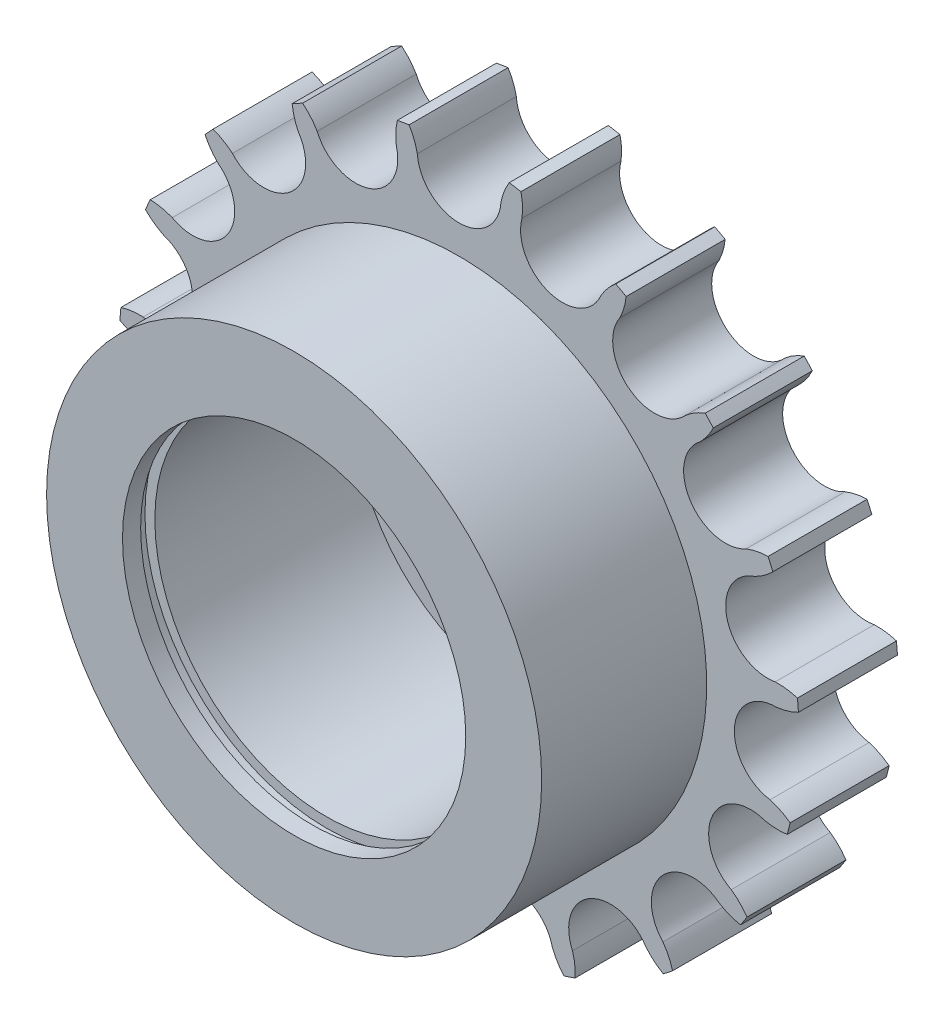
ISO-10303-21;
HEADER;
FILE_DESCRIPTION(('STEP AP214'),'2;1');
FILE_NAME('part.step','',(''),(''),'','','');
FILE_SCHEMA(('AUTOMOTIVE_DESIGN { 1 0 10303 214 1 1 1 1 }'));
ENDSEC;
DATA;
#1=APPLICATION_CONTEXT('core data for automotive mechanical design processes');
#2=APPLICATION_PROTOCOL_DEFINITION('international standard','automotive_design',2000,#1);
#3=PRODUCT_CONTEXT('',#1,'mechanical');
#4=PRODUCT('Part','Part','',(#3));
#5=PRODUCT_RELATED_PRODUCT_CATEGORY('part','',(#4));
#6=PRODUCT_DEFINITION_FORMATION('','',#4);
#7=PRODUCT_DEFINITION_CONTEXT('part definition',#1,'design');
#8=PRODUCT_DEFINITION('design','',#6,#7);
#9=PRODUCT_DEFINITION_SHAPE('','',#8);
#10=(LENGTH_UNIT() NAMED_UNIT(*) SI_UNIT(.MILLI.,.METRE.));
#11=(NAMED_UNIT(*) PLANE_ANGLE_UNIT() SI_UNIT($,.RADIAN.));
#12=(NAMED_UNIT(*) SI_UNIT($,.STERADIAN.) SOLID_ANGLE_UNIT());
#13=UNCERTAINTY_MEASURE_WITH_UNIT(LENGTH_MEASURE(1.E-05),#10,'distance_accuracy_value','');
#14=(GEOMETRIC_REPRESENTATION_CONTEXT(3) GLOBAL_UNCERTAINTY_ASSIGNED_CONTEXT((#13)) GLOBAL_UNIT_ASSIGNED_CONTEXT((#10,
#11,#12)) REPRESENTATION_CONTEXT('',''));
#15=CARTESIAN_POINT('',(0.,0.,0.));
#16=DIRECTION('',(0.,0.,1.));
#17=DIRECTION('',(1.,0.,0.));
#18=AXIS2_PLACEMENT_3D('',#15,#16,#17);
#19=CARTESIAN_POINT('',(0.,0.,5.));
#20=DIRECTION('',(0.,0.,1.));
#21=DIRECTION('',(1.,0.,0.));
#22=AXIS2_PLACEMENT_3D('',#19,#20,#21);
#23=CYLINDRICAL_SURFACE('',#22,26.);
#24=CARTESIAN_POINT('',(0.,0.,5.));
#25=DIRECTION('',(0.,0.,1.));
#26=DIRECTION('',(1.,0.,0.));
#27=AXIS2_PLACEMENT_3D('',#24,#25,#26);
#28=CIRCLE('',#27,26.);
#29=CARTESIAN_POINT('',(26.,0.,5.));
#30=VERTEX_POINT('',#29);
#31=EDGE_CURVE('E1052',#30,#30,#28,.T.);
#32=ORIENTED_EDGE('',*,*,#31,.F.);
#33=EDGE_LOOP('',(#32));
#34=FACE_BOUND('',#33,.T.);
#35=CARTESIAN_POINT('',(0.,0.,35.1));
#36=DIRECTION('',(0.,0.,1.));
#37=DIRECTION('',(1.,0.,0.));
#38=AXIS2_PLACEMENT_3D('',#35,#36,#37);
#39=CIRCLE('',#38,26.);
#40=CARTESIAN_POINT('',(26.,0.,35.1));
#41=VERTEX_POINT('',#40);
#42=EDGE_CURVE('E33',#41,#41,#39,.F.);
#43=ORIENTED_EDGE('',*,*,#42,.F.);
#44=EDGE_LOOP('',(#43));
#45=FACE_BOUND('',#44,.T.);
#46=ADVANCED_FACE('F29',(#34,#45),#23,.F.);
#47=CARTESIAN_POINT('',(-9.43689570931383E-13,1.11022302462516E-13,15.));
#48=DIRECTION('',(0.,0.,-1.));
#49=DIRECTION('',(-1.,0.,0.));
#50=AXIS2_PLACEMENT_3D('',#47,#48,#49);
#51=CYLINDRICAL_SURFACE('',#50,17.5);
#52=CARTESIAN_POINT('',(0.,0.,0.));
#53=DIRECTION('',(0.,0.,1.));
#54=DIRECTION('',(1.,0.,0.));
#55=AXIS2_PLACEMENT_3D('',#52,#53,#54);
#56=CIRCLE('',#55,17.5);
#57=CARTESIAN_POINT('',(17.5,0.,0.));
#58=VERTEX_POINT('',#57);
#59=EDGE_CURVE('E526',#58,#58,#56,.T.);
#60=ORIENTED_EDGE('',*,*,#59,.F.);
#61=EDGE_LOOP('',(#60));
#62=FACE_BOUND('',#61,.T.);
#63=CARTESIAN_POINT('',(0.,0.,5.));
#64=DIRECTION('',(0.,0.,1.));
#65=DIRECTION('',(1.,0.,0.));
#66=AXIS2_PLACEMENT_3D('',#63,#64,#65);
#67=CIRCLE('',#66,17.5);
#68=CARTESIAN_POINT('',(17.5,0.,5.));
#69=VERTEX_POINT('',#68);
#70=EDGE_CURVE('E1050',#69,#69,#67,.T.);
#71=ORIENTED_EDGE('',*,*,#70,.T.);
#72=EDGE_LOOP('',(#71));
#73=FACE_BOUND('',#72,.T.);
#74=ADVANCED_FACE('F1085',(#62,#73),#51,.F.);
#75=CARTESIAN_POINT('',(7.85900803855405,22.9460027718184,15.));
#76=DIRECTION('',(0.,0.,-1.));
#77=DIRECTION('',(-1.,0.,0.));
#78=AXIS2_PLACEMENT_3D('',#75,#76,#77);
#79=PLANE('',#78);
#80=CARTESIAN_POINT('',(15.7180160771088,45.892005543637,15.));
#81=DIRECTION('',(0.,0.,1.));
#82=DIRECTION('',(-1.,0.,0.));
#83=AXIS2_PLACEMENT_3D('',#80,#81,#82);
#84=CIRCLE('',#83,9.57);
#85=CARTESIAN_POINT('',(7.58651220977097,50.9381471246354,15.0000000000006));
#86=VERTEX_POINT('',#85);
#87=CARTESIAN_POINT('',(6.33609328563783,47.7799739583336,15.));
#88=VERTEX_POINT('',#87);
#89=EDGE_CURVE('E680',#86,#88,#84,.T.);
#90=ORIENTED_EDGE('',*,*,#89,.T.);
#91=CARTESIAN_POINT('',(-2.33146835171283E-12,48.2000000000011,15.));
#92=DIRECTION('',(0.,0.,-1.));
#93=DIRECTION('',(1.,0.,0.));
#94=AXIS2_PLACEMENT_3D('',#91,#92,#93);
#95=CIRCLE('',#94,6.35);
#96=CARTESIAN_POINT('',(-6.33609328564,47.7799739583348,15.));
#97=VERTEX_POINT('',#96);
#98=EDGE_CURVE('E519',#88,#97,#95,.T.);
#99=ORIENTED_EDGE('',*,*,#98,.T.);
#100=CARTESIAN_POINT('',(-15.7180160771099,45.8920055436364,15.));
#101=DIRECTION('',(0.,0.,1.));
#102=DIRECTION('',(1.,0.,0.));
#103=AXIS2_PLACEMENT_3D('',#100,#101,#102);
#104=CIRCLE('',#103,9.57);
#105=CARTESIAN_POINT('',(-7.58651220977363,50.9381471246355,15.));
#106=VERTEX_POINT('',#105);
#107=EDGE_CURVE('E683',#97,#106,#104,.T.);
#108=ORIENTED_EDGE('',*,*,#107,.T.);
#109=CARTESIAN_POINT('',(-9.43689570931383E-13,1.11022302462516E-13,15.));
#110=DIRECTION('',(0.,0.,1.));
#111=DIRECTION('',(1.,0.,0.));
#112=AXIS2_PLACEMENT_3D('',#109,#110,#111);
#113=CIRCLE('',#112,51.5);
#114=CARTESIAN_POINT('',(-9.36413528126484,50.6415142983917,15.));
#115=VERTEX_POINT('',#114);
#116=EDGE_CURVE('E685',#106,#115,#113,.T.);
#117=ORIENTED_EDGE('',*,*,#116,.T.);
#118=CARTESIAN_POINT('',(-0.0347392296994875,48.5090815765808,15.));
#119=DIRECTION('',(0.,0.,1.));
#120=DIRECTION('',(-1.,0.,0.));
#121=AXIS2_PLACEMENT_3D('',#118,#119,#120);
#122=CIRCLE('',#121,9.57);
#123=CARTESIAN_POINT('',(-9.52134590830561,47.2484493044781,15.));
#124=VERTEX_POINT('',#123);
#125=EDGE_CURVE('E687',#115,#124,#122,.T.);
#126=ORIENTED_EDGE('',*,*,#125,.T.);
#127=CARTESIAN_POINT('',(-15.6505144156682,45.588391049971,15.));
#128=DIRECTION('',(0.,0.,-1.));
#129=DIRECTION('',(1.,0.,0.));
#130=AXIS2_PLACEMENT_3D('',#127,#128,#129);
#131=CIRCLE('',#130,6.35);
#132=CARTESIAN_POINT('',(-21.5069184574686,43.1337970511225,15.0000000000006));
#133=VERTEX_POINT('',#132);
#134=EDGE_CURVE('E689',#124,#133,#131,.T.);
#135=ORIENTED_EDGE('',*,*,#134,.T.);
#136=CARTESIAN_POINT('',(-29.7674804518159,38.3018186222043,15.));
#137=DIRECTION('',(0.,0.,1.));
#138=DIRECTION('',(1.,0.,0.));
#139=AXIS2_PLACEMENT_3D('',#136,#137,#138);
#140=CIRCLE('',#139,9.57);
#141=CARTESIAN_POINT('',(-23.7150433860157,45.714841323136,15.));
#142=VERTEX_POINT('',#141);
#143=EDGE_CURVE('E691',#133,#142,#140,.T.);
#144=ORIENTED_EDGE('',*,*,#143,.T.);
#145=CARTESIAN_POINT('',(-9.43689570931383E-13,1.11022302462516E-13,15.));
#146=DIRECTION('',(0.,0.,1.));
#147=DIRECTION('',(1.,0.,0.));
#148=AXIS2_PLACEMENT_3D('',#145,#146,#147);
#149=CIRCLE('',#148,51.5);
#150=CARTESIAN_POINT('',(-25.3000334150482,44.8570876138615,15.));
#151=VERTEX_POINT('',#150);
#152=EDGE_CURVE('E693',#142,#151,#149,.T.);
#153=ORIENTED_EDGE('',*,*,#152,.T.);
#154=CARTESIAN_POINT('',(-15.7837300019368,45.8694459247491,15.));
#155=DIRECTION('',(0.,0.,1.));
#156=DIRECTION('',(-1.,0.,0.));
#157=AXIS2_PLACEMENT_3D('',#154,#155,#156);
#158=CIRCLE('',#157,9.57000000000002);
#159=CARTESIAN_POINT('',(-24.3469995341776,41.5968220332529,15.));
#160=VERTEX_POINT('',#159);
#161=EDGE_CURVE('E695',#151,#160,#158,.T.);
#162=ORIENTED_EDGE('',*,*,#161,.T.);
#163=CARTESIAN_POINT('',(-29.6050527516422,38.0365725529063,15.));
#164=DIRECTION('',(0.,0.,-1.));
#165=DIRECTION('',(1.,0.,0.));
#166=AXIS2_PLACEMENT_3D('',#163,#164,#165);
#167=CIRCLE('',#166,6.34999999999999);
#168=CARTESIAN_POINT('',(-34.3471353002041,33.8134039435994,15.));
#169=VERTEX_POINT('',#168);
#170=EDGE_CURVE('E697',#160,#169,#167,.T.);
#171=ORIENTED_EDGE('',*,*,#170,.T.);
#172=CARTESIAN_POINT('',(-40.5911764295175,26.5610353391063,15.));
#173=DIRECTION('',(0.,0.,1.));
#174=DIRECTION('',(1.,0.,0.));
#175=AXIS2_PLACEMENT_3D('',#172,#173,#174);
#176=CIRCLE('',#175,9.57);
#177=CARTESIAN_POINT('',(-37.2736816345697,35.5376231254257,15.));
#178=VERTEX_POINT('',#177);
#179=EDGE_CURVE('E699',#169,#178,#176,.T.);
#180=ORIENTED_EDGE('',*,*,#179,.T.);
#181=CARTESIAN_POINT('',(-9.43689570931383E-13,1.11022302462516E-13,15.));
#182=DIRECTION('',(0.,0.,1.));
#183=DIRECTION('',(1.,0.,0.));
#184=AXIS2_PLACEMENT_3D('',#181,#182,#183);
#185=CIRCLE('',#184,51.5);
#186=CARTESIAN_POINT('',(-38.4942803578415,34.2116994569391,15.));
#187=VERTEX_POINT('',#186);
#188=EDGE_CURVE('E701',#178,#187,#185,.T.);
#189=ORIENTED_EDGE('',*,*,#188,.T.);
#190=CARTESIAN_POINT('',(-29.8223087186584,38.2591440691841,15.));
#191=DIRECTION('',(0.,0.,1.));
#192=DIRECTION('',(-1.,0.,0.));
#193=AXIS2_PLACEMENT_3D('',#190,#191,#192);
#194=CIRCLE('',#193,9.57000000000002);
#195=CARTESIAN_POINT('',(-36.5342779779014,31.4375336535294,15.));
#196=VERTEX_POINT('',#195);
#197=EDGE_CURVE('E703',#187,#196,#194,.T.);
#198=ORIENTED_EDGE('',*,*,#197,.T.);
#199=CARTESIAN_POINT('',(-40.3514242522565,26.3629012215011,15.));
#200=DIRECTION('',(0.,0.,-1.));
#201=DIRECTION('',(1.,0.,0.));
#202=AXIS2_PLACEMENT_3D('',#199,#200,#201);
#203=CIRCLE('',#202,6.34999999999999);
#204=CARTESIAN_POINT('',(-43.4653070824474,20.8288038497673,15.));
#205=VERTEX_POINT('',#204);
#206=EDGE_CURVE('E705',#196,#205,#203,.T.);
#207=ORIENTED_EDGE('',*,*,#206,.T.);
#208=CARTESIAN_POINT('',(-47.016188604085,11.9419517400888,15.0000000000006));
#209=DIRECTION('',(0.,0.,1.));
#210=DIRECTION('',(1.,0.,0.));
#211=AXIS2_PLACEMENT_3D('',#208,#209,#210);
#212=CIRCLE('',#211,9.57);
#213=CARTESIAN_POINT('',(-46.7931381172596,21.5093520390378,15.));
#214=VERTEX_POINT('',#213);
#215=EDGE_CURVE('E707',#205,#214,#212,.T.);
#216=ORIENTED_EDGE('',*,*,#215,.T.);
#217=CARTESIAN_POINT('',(-9.43689570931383E-13,1.11022302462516E-13,15.));
#218=DIRECTION('',(0.,0.,1.));
#219=DIRECTION('',(1.,0.,0.));
#220=AXIS2_PLACEMENT_3D('',#217,#218,#219);
#221=CIRCLE('',#220,51.5);
#222=CARTESIAN_POINT('',(-47.517074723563,19.858942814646,15.));
#223=VERTEX_POINT('',#222);
#224=EDGE_CURVE('E709',#214,#223,#221,.T.);
#225=ORIENTED_EDGE('',*,*,#224,.T.);
#226=CARTESIAN_POINT('',(-40.6291775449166,26.5028703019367,15.));
#227=DIRECTION('',(0.,0.,1.));
#228=DIRECTION('',(-1.,0.,0.));
#229=AXIS2_PLACEMENT_3D('',#226,#227,#228);
#230=CIRCLE('',#229,9.57000000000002);
#231=CARTESIAN_POINT('',(-44.7625005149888,17.8715006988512,15.));
#232=VERTEX_POINT('',#231);
#233=EDGE_CURVE('E711',#223,#232,#230,.T.);
#234=ORIENTED_EDGE('',*,*,#233,.T.);
#235=CARTESIAN_POINT('',(-46.7250928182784,11.832400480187,15.0000000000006));
#236=DIRECTION('',(0.,0.,-1.));
#237=DIRECTION('',(1.,0.,0.));
#238=AXIS2_PLACEMENT_3D('',#235,#236,#237);
#239=CIRCLE('',#238,6.34999999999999);
#240=CARTESIAN_POINT('',(-47.8733384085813,5.58707966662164,15.0000000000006));
#241=VERTEX_POINT('',#240);
#242=EDGE_CURVE('E713',#232,#241,#239,.T.);
#243=ORIENTED_EDGE('',*,*,#242,.T.);
#244=CARTESIAN_POINT('',(-48.3462672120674,-3.97122762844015,15.));
#245=DIRECTION('',(0.,0.,1.));
#246=DIRECTION('',(1.,0.,0.));
#247=AXIS2_PLACEMENT_3D('',#244,#245,#246);
#248=CIRCLE('',#247,9.57);
#249=CARTESIAN_POINT('',(-51.2418320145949,5.15020890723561,15.));
#250=VERTEX_POINT('',#249);
#251=EDGE_CURVE('E715',#241,#250,#248,.T.);
#252=ORIENTED_EDGE('',*,*,#251,.T.);
#253=CARTESIAN_POINT('',(-9.43689570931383E-13,1.11022302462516E-13,15.));
#254=DIRECTION('',(0.,0.,1.));
#255=DIRECTION('',(1.,0.,0.));
#256=AXIS2_PLACEMENT_3D('',#253,#254,#255);
#257=CIRCLE('',#256,51.5);
#258=CARTESIAN_POINT('',(-51.3906567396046,3.35416157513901,15.));
#259=VERTEX_POINT('',#258);
#260=EDGE_CURVE('E717',#250,#259,#257,.T.);
#261=ORIENTED_EDGE('',*,*,#260,.T.);
#262=CARTESIAN_POINT('',(-47.0332445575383,11.8745993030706,15.0000000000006));
#263=DIRECTION('',(0.,0.,1.));
#264=DIRECTION('',(-1.,0.,0.));
#265=AXIS2_PLACEMENT_3D('',#262,#263,#264);
#266=CIRCLE('',#265,9.57000000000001);
#267=CARTESIAN_POINT('',(-48.1400115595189,2.36881333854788,15.));
#268=VERTEX_POINT('',#267);
#269=EDGE_CURVE('E719',#259,#268,#266,.T.);
#270=ORIENTED_EDGE('',*,*,#269,.T.);
#271=CARTESIAN_POINT('',(-48.0353725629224,-3.98032445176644,15.));
#272=DIRECTION('',(0.,0.,-1.));
#273=DIRECTION('',(1.,0.,0.));
#274=AXIS2_PLACEMENT_3D('',#271,#272,#273);
#275=CIRCLE('',#274,6.35);
#276=CARTESIAN_POINT('',(-47.0935506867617,-10.2600912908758,15.));
#277=VERTEX_POINT('',#276);
#278=EDGE_CURVE('E721',#268,#277,#275,.T.);
#279=ORIENTED_EDGE('',*,*,#278,.T.);
#280=CARTESIAN_POINT('',(-44.4372775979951,-19.4540628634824,15.));
#281=DIRECTION('',(0.,0.,1.));
#282=DIRECTION('',(1.,0.,0.));
#283=AXIS2_PLACEMENT_3D('',#280,#281,#282);
#284=CIRCLE('',#283,9.57);
#285=CARTESIAN_POINT('',(-50.1376783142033,-11.7670392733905,15.));
#286=VERTEX_POINT('',#285);
#287=EDGE_CURVE('E723',#277,#286,#284,.T.);
#288=ORIENTED_EDGE('',*,*,#287,.T.);
#289=CARTESIAN_POINT('',(-9.43689570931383E-13,1.11022302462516E-13,15.));
#290=DIRECTION('',(0.,0.,1.));
#291=DIRECTION('',(1.,0.,0.));
#292=AXIS2_PLACEMENT_3D('',#289,#290,#291);
#293=CIRCLE('',#292,51.5);
#294=CARTESIAN_POINT('',(-49.6952636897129,-13.5140951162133,15.));
#295=VERTEX_POINT('',#294);
#296=EDGE_CURVE('E725',#286,#295,#293,.T.);
#297=ORIENTED_EDGE('',*,*,#296,.T.);
#298=CARTESIAN_POINT('',(-48.3405297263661,-4.04046878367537,15.));
#299=DIRECTION('',(0.,0.,1.));
#300=DIRECTION('',(-1.,0.,0.));
#301=AXIS2_PLACEMENT_3D('',#298,#299,#300);
#302=CIRCLE('',#301,9.57000000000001);
#303=CARTESIAN_POINT('',(-46.3008053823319,-13.390571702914,15.));
#304=VERTEX_POINT('',#303);
#305=EDGE_CURVE('E727',#295,#304,#302,.T.);
#306=ORIENTED_EDGE('',*,*,#305,.T.);
#307=CARTESIAN_POINT('',(-44.1402743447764,-19.361719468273,15.));
#308=DIRECTION('',(0.,0.,-1.));
#309=DIRECTION('',(1.,0.,0.));
#310=AXIS2_PLACEMENT_3D('',#307,#308,#309);
#311=CIRCLE('',#310,6.35);
#312=CARTESIAN_POINT('',(-41.210446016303,-24.9954221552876,15.0000000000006));
#313=VERTEX_POINT('',#312);
#314=EDGE_CURVE('E729',#304,#313,#311,.T.);
#315=ORIENTED_EDGE('',*,*,#314,.T.);
#316=CARTESIAN_POINT('',(-35.7128194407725,-32.8287485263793,15.));
#317=DIRECTION('',(0.,0.,1.));
#318=DIRECTION('',(1.,0.,0.));
#319=AXIS2_PLACEMENT_3D('',#316,#317,#318);
#320=CIRCLE('',#319,9.57);
#321=CARTESIAN_POINT('',(-43.6003292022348,-27.4091461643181,15.));
#322=VERTEX_POINT('',#321);
#323=EDGE_CURVE('E731',#313,#322,#320,.T.);
#324=ORIENTED_EDGE('',*,*,#323,.T.);
#325=CARTESIAN_POINT('',(-9.43689570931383E-13,1.11022302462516E-13,15.));
#326=DIRECTION('',(0.,0.,1.));
#327=DIRECTION('',(1.,0.,0.));
#328=AXIS2_PLACEMENT_3D('',#325,#326,#327);
#329=CIRCLE('',#328,51.5);
#330=CARTESIAN_POINT('',(-42.6146177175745,-28.917889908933,15.));
#331=VERTEX_POINT('',#330);
#332=EDGE_CURVE('E733',#322,#331,#329,.T.);
#333=ORIENTED_EDGE('',*,*,#332,.T.);
#334=CARTESIAN_POINT('',(-44.4093684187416,-19.5176893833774,15.));
#335=DIRECTION('',(0.,0.,1.));
#336=DIRECTION('',(-1.,0.,0.));
#337=AXIS2_PLACEMENT_3D('',#334,#335,#336);
#338=CIRCLE('',#337,9.57000000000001);
#339=CARTESIAN_POINT('',(-39.444188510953,-27.6988805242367,15.0000000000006));
#340=VERTEX_POINT('',#339);
#341=EDGE_CURVE('E735',#331,#340,#338,.T.);
#342=ORIENTED_EDGE('',*,*,#341,.T.);
#343=CARTESIAN_POINT('',(-35.461892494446,-32.6449717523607,15.));
#344=DIRECTION('',(0.,0.,-1.));
#345=DIRECTION('',(1.,0.,0.));
#346=AXIS2_PLACEMENT_3D('',#343,#344,#345);
#347=CIRCLE('',#346,6.34999999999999);
#348=CARTESIAN_POINT('',(-30.8615500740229,-37.0221111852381,15.));
#349=VERTEX_POINT('',#348);
#350=EDGE_CURVE('E737',#340,#349,#347,.T.);
#351=ORIENTED_EDGE('',*,*,#350,.T.);
#352=CARTESIAN_POINT('',(-23.1183231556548,-42.6459298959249,15.));
#353=DIRECTION('',(0.,0.,1.));
#354=DIRECTION('',(1.,0.,0.));
#355=AXIS2_PLACEMENT_3D('',#352,#353,#354);
#356=CIRCLE('',#355,9.57);
#357=CARTESIAN_POINT('',(-32.3382078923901,-40.0810467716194,15.));
#358=VERTEX_POINT('',#357);
#359=EDGE_CURVE('E739',#349,#358,#356,.T.);
#360=ORIENTED_EDGE('',*,*,#359,.T.);
#361=CARTESIAN_POINT('',(-9.43689570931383E-13,1.11022302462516E-13,15.));
#362=DIRECTION('',(0.,0.,1.));
#363=DIRECTION('',(1.,0.,0.));
#364=AXIS2_PLACEMENT_3D('',#361,#362,#363);
#365=CIRCLE('',#364,51.5);
#366=CARTESIAN_POINT('',(-30.9160166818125,-41.1879826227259,15.));
#367=VERTEX_POINT('',#366);
#368=EDGE_CURVE('E741',#358,#367,#365,.T.);
#369=ORIENTED_EDGE('',*,*,#368,.T.);
#370=CARTESIAN_POINT('',(-35.6657629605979,-32.8798654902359,15.));
#371=DIRECTION('',(0.,0.,1.));
#372=DIRECTION('',(-1.,0.,0.));
#373=AXIS2_PLACEMENT_3D('',#370,#371,#372);
#374=CIRCLE('',#373,9.57000000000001);
#375=CARTESIAN_POINT('',(-28.313181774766,-39.0055858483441,15.));
#376=VERTEX_POINT('',#375);
#377=EDGE_CURVE('E743',#367,#376,#374,.T.);
#378=ORIENTED_EDGE('',*,*,#377,.T.);
#379=CARTESIAN_POINT('',(-22.9406643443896,-42.3906348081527,15.));
#380=DIRECTION('',(0.,0.,-1.));
#381=DIRECTION('',(1.,0.,0.));
#382=AXIS2_PLACEMENT_3D('',#379,#380,#381);
#383=CIRCLE('',#382,6.35);
#384=CARTESIAN_POINT('',(-17.1683263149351,-45.0368800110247,15.));
#385=VERTEX_POINT('',#384);
#386=EDGE_CURVE('E745',#376,#385,#383,.T.);
#387=ORIENTED_EDGE('',*,*,#386,.T.);
#388=CARTESIAN_POINT('',(-8.01859783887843,-47.8417630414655,15.));
#389=DIRECTION('',(0.,0.,1.));
#390=DIRECTION('',(1.,0.,0.));
#391=AXIS2_PLACEMENT_3D('',#388,#389,#390);
#392=CIRCLE('',#391,9.56999999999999);
#393=CARTESIAN_POINT('',(-17.5717399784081,-48.409544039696,15.));
#394=VERTEX_POINT('',#393);
#395=EDGE_CURVE('E747',#385,#394,#392,.T.);
#396=ORIENTED_EDGE('',*,*,#395,.T.);
#397=CARTESIAN_POINT('',(-9.43689570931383E-13,1.11022302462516E-13,15.));
#398=DIRECTION('',(0.,0.,1.));
#399=DIRECTION('',(1.,0.,0.));
#400=AXIS2_PLACEMENT_3D('',#397,#398,#399);
#401=CIRCLE('',#400,51.5);
#402=CARTESIAN_POINT('',(-15.8671855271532,-48.9947183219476,15.));
#403=VERTEX_POINT('',#402);
#404=EDGE_CURVE('E749',#394,#403,#401,.T.);
#405=ORIENTED_EDGE('',*,*,#404,.T.);
#406=CARTESIAN_POINT('',(-23.0572186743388,-42.6789979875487,15.));
#407=DIRECTION('',(0.,0.,1.));
#408=DIRECTION('',(-1.,0.,0.));
#409=AXIS2_PLACEMENT_3D('',#406,#407,#408);
#410=CIRCLE('',#409,9.57000000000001);
#411=CARTESIAN_POINT('',(-14.1140024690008,-46.0854307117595,15.));
#412=VERTEX_POINT('',#411);
#413=EDGE_CURVE('E751',#403,#412,#410,.T.);
#414=ORIENTED_EDGE('',*,*,#413,.T.);
#415=CARTESIAN_POINT('',(-7.93345925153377,-47.5426148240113,15.));
#416=DIRECTION('',(0.,0.,-1.));
#417=DIRECTION('',(1.,0.,0.));
#418=AXIS2_PLACEMENT_3D('',#415,#416,#417);
#419=CIRCLE('',#418,6.34999999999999);
#420=CARTESIAN_POINT('',(-1.61464800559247,-48.1712040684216,15.));
#421=VERTEX_POINT('',#420);
#422=EDGE_CURVE('E753',#412,#421,#419,.T.);
#423=ORIENTED_EDGE('',*,*,#422,.T.);
#424=CARTESIAN_POINT('',(7.95006697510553,-47.8531988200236,15.));
#425=DIRECTION('',(0.,0.,1.));
#426=DIRECTION('',(1.,0.,0.));
#427=AXIS2_PLACEMENT_3D('',#424,#425,#426);
#428=CIRCLE('',#427,9.56999999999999);
#429=CARTESIAN_POINT('',(-0.901101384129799,-51.4921160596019,15.));
#430=VERTEX_POINT('',#429);
#431=EDGE_CURVE('E755',#421,#430,#428,.T.);
#432=ORIENTED_EDGE('',*,*,#431,.T.);
#433=CARTESIAN_POINT('',(-9.43689570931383E-13,1.11022302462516E-13,15.));
#434=DIRECTION('',(0.,0.,1.));
#435=DIRECTION('',(1.,0.,0.));
#436=AXIS2_PLACEMENT_3D('',#433,#434,#435);
#437=CIRCLE('',#436,51.5);
#438=CARTESIAN_POINT('',(0.901101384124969,-51.4921160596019,15.));
#439=VERTEX_POINT('',#438);
#440=EDGE_CURVE('E757',#430,#439,#437,.T.);
#441=ORIENTED_EDGE('',*,*,#440,.T.);
#442=CARTESIAN_POINT('',(-7.95006697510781,-47.8531988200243,15.));
#443=DIRECTION('',(0.,0.,1.));
#444=DIRECTION('',(-1.,0.,0.));
#445=AXIS2_PLACEMENT_3D('',#442,#443,#444);
#446=CIRCLE('',#445,9.57000000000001);
#447=CARTESIAN_POINT('',(1.61464800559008,-48.1712040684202,15.));
#448=VERTEX_POINT('',#447);
#449=EDGE_CURVE('E759',#439,#448,#446,.T.);
#450=ORIENTED_EDGE('',*,*,#449,.T.);
#451=CARTESIAN_POINT('',(7.93345925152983,-47.5426148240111,15.));
#452=DIRECTION('',(0.,0.,-1.));
#453=DIRECTION('',(1.,0.,0.));
#454=AXIS2_PLACEMENT_3D('',#451,#452,#453);
#455=CIRCLE('',#454,6.34999999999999);
#456=CARTESIAN_POINT('',(14.1140024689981,-46.085430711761,15.));
#457=VERTEX_POINT('',#456);
#458=EDGE_CURVE('E761',#448,#457,#455,.T.);
#459=ORIENTED_EDGE('',*,*,#458,.T.);
#460=CARTESIAN_POINT('',(23.0572186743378,-42.678997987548,15.));
#461=DIRECTION('',(0.,0.,1.));
#462=DIRECTION('',(1.,0.,0.));
#463=AXIS2_PLACEMENT_3D('',#460,#461,#462);
#464=CIRCLE('',#463,9.57);
#465=CARTESIAN_POINT('',(15.8671855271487,-48.9947183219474,15.));
#466=VERTEX_POINT('',#465);
#467=EDGE_CURVE('E763',#457,#466,#464,.T.);
#468=ORIENTED_EDGE('',*,*,#467,.T.);
#469=CARTESIAN_POINT('',(-9.43689570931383E-13,1.11022302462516E-13,15.));
#470=DIRECTION('',(0.,0.,1.));
#471=DIRECTION('',(1.,0.,0.));
#472=AXIS2_PLACEMENT_3D('',#469,#470,#471);
#473=CIRCLE('',#472,51.5);
#474=CARTESIAN_POINT('',(17.5717399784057,-48.409544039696,15.));
#475=VERTEX_POINT('',#474);
#476=EDGE_CURVE('E765',#466,#475,#473,.T.);
#477=ORIENTED_EDGE('',*,*,#476,.T.);
#478=CARTESIAN_POINT('',(8.01859783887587,-47.8417630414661,15.));
#479=DIRECTION('',(0.,0.,1.));
#480=DIRECTION('',(-1.,0.,0.));
#481=AXIS2_PLACEMENT_3D('',#478,#479,#480);
#482=CIRCLE('',#481,9.57000000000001);
#483=CARTESIAN_POINT('',(17.1683263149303,-45.0368800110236,15.));
#484=VERTEX_POINT('',#483);
#485=EDGE_CURVE('E767',#475,#484,#482,.T.);
#486=ORIENTED_EDGE('',*,*,#485,.T.);
#487=CARTESIAN_POINT('',(22.9406643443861,-42.3906348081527,15.));
#488=DIRECTION('',(0.,0.,-1.));
#489=DIRECTION('',(1.,0.,0.));
#490=AXIS2_PLACEMENT_3D('',#487,#488,#489);
#491=CIRCLE('',#490,6.34999999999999);
#492=CARTESIAN_POINT('',(28.3131817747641,-39.0055858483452,15.));
#493=VERTEX_POINT('',#492);
#494=EDGE_CURVE('E769',#484,#493,#491,.T.);
#495=ORIENTED_EDGE('',*,*,#494,.T.);
#496=CARTESIAN_POINT('',(35.6657629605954,-32.8798654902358,15.));
#497=DIRECTION('',(0.,0.,1.));
#498=DIRECTION('',(1.,0.,0.));
#499=AXIS2_PLACEMENT_3D('',#496,#497,#498);
#500=CIRCLE('',#499,9.57);
#501=CARTESIAN_POINT('',(30.9160166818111,-41.1879826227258,15.));
#502=VERTEX_POINT('',#501);
#503=EDGE_CURVE('E771',#493,#502,#500,.T.);
#504=ORIENTED_EDGE('',*,*,#503,.T.);
#505=CARTESIAN_POINT('',(-9.43689570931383E-13,1.11022302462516E-13,15.));
#506=DIRECTION('',(0.,0.,1.));
#507=DIRECTION('',(1.,0.,0.));
#508=AXIS2_PLACEMENT_3D('',#505,#506,#507);
#509=CIRCLE('',#508,51.5);
#510=CARTESIAN_POINT('',(32.3382078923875,-40.0810467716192,15.));
#511=VERTEX_POINT('',#510);
#512=EDGE_CURVE('E773',#502,#511,#509,.T.);
#513=ORIENTED_EDGE('',*,*,#512,.T.);
#514=CARTESIAN_POINT('',(23.1183231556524,-42.6459298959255,15.));
#515=DIRECTION('',(0.,0.,1.));
#516=DIRECTION('',(-1.,0.,0.));
#517=AXIS2_PLACEMENT_3D('',#514,#515,#516);
#518=CIRCLE('',#517,9.57000000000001);
#519=CARTESIAN_POINT('',(30.8615500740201,-37.0221111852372,15.));
#520=VERTEX_POINT('',#519);
#521=EDGE_CURVE('E775',#511,#520,#518,.T.);
#522=ORIENTED_EDGE('',*,*,#521,.T.);
#523=CARTESIAN_POINT('',(35.4618924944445,-32.6449717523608,15.));
#524=DIRECTION('',(0.,0.,-1.));
#525=DIRECTION('',(1.,0.,0.));
#526=AXIS2_PLACEMENT_3D('',#523,#524,#525);
#527=CIRCLE('',#526,6.34999999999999);
#528=CARTESIAN_POINT('',(39.4441885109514,-27.6988805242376,15.));
#529=VERTEX_POINT('',#528);
#530=EDGE_CURVE('E777',#520,#529,#527,.T.);
#531=ORIENTED_EDGE('',*,*,#530,.T.);
#532=CARTESIAN_POINT('',(44.40936841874,-19.5176893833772,15.));
#533=DIRECTION('',(0.,0.,1.));
#534=DIRECTION('',(1.,0.,0.));
#535=AXIS2_PLACEMENT_3D('',#532,#533,#534);
#536=CIRCLE('',#535,9.57);
#537=CARTESIAN_POINT('',(42.6146177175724,-28.917889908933,15.));
#538=VERTEX_POINT('',#537);
#539=EDGE_CURVE('E779',#529,#538,#536,.T.);
#540=ORIENTED_EDGE('',*,*,#539,.T.);
#541=CARTESIAN_POINT('',(-9.43689570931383E-13,1.11022302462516E-13,15.));
#542=DIRECTION('',(0.,0.,1.));
#543=DIRECTION('',(1.,0.,0.));
#544=AXIS2_PLACEMENT_3D('',#541,#542,#543);
#545=CIRCLE('',#544,51.5);
#546=CARTESIAN_POINT('',(43.6003292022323,-27.4091461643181,15.));
#547=VERTEX_POINT('',#546);
#548=EDGE_CURVE('E781',#538,#547,#545,.T.);
#549=ORIENTED_EDGE('',*,*,#548,.T.);
#550=CARTESIAN_POINT('',(35.7128194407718,-32.8287485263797,15.));
#551=DIRECTION('',(0.,0.,1.));
#552=DIRECTION('',(-1.,0.,0.));
#553=AXIS2_PLACEMENT_3D('',#550,#551,#552);
#554=CIRCLE('',#553,9.57000000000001);
#555=CARTESIAN_POINT('',(41.2104460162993,-24.9954221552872,15.));
#556=VERTEX_POINT('',#555);
#557=EDGE_CURVE('E783',#547,#556,#554,.T.);
#558=ORIENTED_EDGE('',*,*,#557,.T.);
#559=CARTESIAN_POINT('',(44.1402743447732,-19.361719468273,15.));
#560=DIRECTION('',(0.,0.,-1.));
#561=DIRECTION('',(1.,0.,0.));
#562=AXIS2_PLACEMENT_3D('',#559,#560,#561);
#563=CIRCLE('',#562,6.35);
#564=CARTESIAN_POINT('',(46.3008053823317,-13.3905717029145,15.));
#565=VERTEX_POINT('',#564);
#566=EDGE_CURVE('E785',#556,#565,#563,.T.);
#567=ORIENTED_EDGE('',*,*,#566,.T.);
#568=CARTESIAN_POINT('',(48.3405297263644,-4.04046878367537,15.0000000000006));
#569=DIRECTION('',(0.,0.,1.));
#570=DIRECTION('',(1.,0.,0.));
#571=AXIS2_PLACEMENT_3D('',#568,#569,#570);
#572=CIRCLE('',#571,9.57);
#573=CARTESIAN_POINT('',(49.6952636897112,-13.5140951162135,15.));
#574=VERTEX_POINT('',#573);
#575=EDGE_CURVE('E787',#565,#574,#572,.T.);
#576=ORIENTED_EDGE('',*,*,#575,.T.);
#577=CARTESIAN_POINT('',(-9.43689570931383E-13,1.11022302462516E-13,15.));
#578=DIRECTION('',(0.,0.,1.));
#579=DIRECTION('',(1.,0.,0.));
#580=AXIS2_PLACEMENT_3D('',#577,#578,#579);
#581=CIRCLE('',#580,51.5);
#582=CARTESIAN_POINT('',(50.1376783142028,-11.7670392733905,15.));
#583=VERTEX_POINT('',#582);
#584=EDGE_CURVE('E789',#574,#583,#581,.T.);
#585=ORIENTED_EDGE('',*,*,#584,.T.);
#586=CARTESIAN_POINT('',(44.4372775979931,-19.4540628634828,15.));
#587=DIRECTION('',(0.,0.,1.));
#588=DIRECTION('',(-1.,0.,0.));
#589=AXIS2_PLACEMENT_3D('',#586,#587,#588);
#590=CIRCLE('',#589,9.57000000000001);
#591=CARTESIAN_POINT('',(47.0935506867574,-10.2600912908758,15.));
#592=VERTEX_POINT('',#591);
#593=EDGE_CURVE('E791',#583,#592,#590,.T.);
#594=ORIENTED_EDGE('',*,*,#593,.T.);
#595=CARTESIAN_POINT('',(48.0353725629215,-3.98032445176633,15.));
#596=DIRECTION('',(0.,0.,-1.));
#597=DIRECTION('',(1.,0.,0.));
#598=AXIS2_PLACEMENT_3D('',#595,#596,#597);
#599=CIRCLE('',#598,6.35);
#600=CARTESIAN_POINT('',(48.1400115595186,2.36881333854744,15.));
#601=VERTEX_POINT('',#600);
#602=EDGE_CURVE('E793',#592,#601,#599,.T.);
#603=ORIENTED_EDGE('',*,*,#602,.T.);
#604=CARTESIAN_POINT('',(47.0332445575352,11.8745993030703,15.0000000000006));
#605=DIRECTION('',(0.,0.,1.));
#606=DIRECTION('',(1.,0.,0.));
#607=AXIS2_PLACEMENT_3D('',#604,#605,#606);
#608=CIRCLE('',#607,9.57);
#609=CARTESIAN_POINT('',(51.3906567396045,3.35416157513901,15.));
#610=VERTEX_POINT('',#609);
#611=EDGE_CURVE('E795',#601,#610,#608,.T.);
#612=ORIENTED_EDGE('',*,*,#611,.T.);
#613=CARTESIAN_POINT('',(-9.43689570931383E-13,1.11022302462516E-13,15.));
#614=DIRECTION('',(0.,0.,1.));
#615=DIRECTION('',(1.,0.,0.));
#616=AXIS2_PLACEMENT_3D('',#613,#614,#615);
#617=CIRCLE('',#616,51.5);
#618=CARTESIAN_POINT('',(51.2418320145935,5.15020890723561,15.));
#619=VERTEX_POINT('',#618);
#620=EDGE_CURVE('E797',#610,#619,#617,.T.);
#621=ORIENTED_EDGE('',*,*,#620,.T.);
#622=CARTESIAN_POINT('',(48.3462672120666,-3.9712276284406,15.0000000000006));
#623=DIRECTION('',(0.,0.,1.));
#624=DIRECTION('',(-1.,0.,0.));
#625=AXIS2_PLACEMENT_3D('',#622,#623,#624);
#626=CIRCLE('',#625,9.57);
#627=CARTESIAN_POINT('',(47.8733384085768,5.5870796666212,15.0000000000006));
#628=VERTEX_POINT('',#627);
#629=EDGE_CURVE('E799',#619,#628,#626,.T.);
#630=ORIENTED_EDGE('',*,*,#629,.T.);
#631=CARTESIAN_POINT('',(46.7250928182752,11.8324004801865,15.0000000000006));
#632=DIRECTION('',(0.,0.,-1.));
#633=DIRECTION('',(1.,0.,0.));
#634=AXIS2_PLACEMENT_3D('',#631,#632,#633);
#635=CIRCLE('',#634,6.35);
#636=CARTESIAN_POINT('',(44.7625005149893,17.8715006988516,15.0000000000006));
#637=VERTEX_POINT('',#636);
#638=EDGE_CURVE('E801',#628,#637,#635,.T.);
#639=ORIENTED_EDGE('',*,*,#638,.T.);
#640=CARTESIAN_POINT('',(40.6291775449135,26.502870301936,15.));
#641=DIRECTION('',(0.,0.,1.));
#642=DIRECTION('',(1.,0.,0.));
#643=AXIS2_PLACEMENT_3D('',#640,#641,#642);
#644=CIRCLE('',#643,9.57);
#645=CARTESIAN_POINT('',(47.5170747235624,19.858942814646,15.));
#646=VERTEX_POINT('',#645);
#647=EDGE_CURVE('E803',#637,#646,#644,.T.);
#648=ORIENTED_EDGE('',*,*,#647,.T.);
#649=CARTESIAN_POINT('',(-9.43689570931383E-13,1.11022302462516E-13,15.));
#650=DIRECTION('',(0.,0.,1.));
#651=DIRECTION('',(1.,0.,0.));
#652=AXIS2_PLACEMENT_3D('',#649,#650,#651);
#653=CIRCLE('',#652,51.5);
#654=CARTESIAN_POINT('',(46.7931381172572,21.5093520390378,15.));
#655=VERTEX_POINT('',#654);
#656=EDGE_CURVE('E805',#646,#655,#653,.T.);
#657=ORIENTED_EDGE('',*,*,#656,.T.);
#658=CARTESIAN_POINT('',(47.0161886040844,11.9419517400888,15.0000000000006));
#659=DIRECTION('',(0.,0.,1.));
#660=DIRECTION('',(-1.,0.,0.));
#661=AXIS2_PLACEMENT_3D('',#658,#659,#660);
#662=CIRCLE('',#661,9.57);
#663=CARTESIAN_POINT('',(43.4653070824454,20.8288038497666,15.));
#664=VERTEX_POINT('',#663);
#665=EDGE_CURVE('E807',#655,#664,#662,.T.);
#666=ORIENTED_EDGE('',*,*,#665,.T.);
#667=CARTESIAN_POINT('',(40.3514242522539,26.3629012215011,15.));
#668=DIRECTION('',(0.,0.,-1.));
#669=DIRECTION('',(1.,0.,0.));
#670=AXIS2_PLACEMENT_3D('',#667,#668,#669);
#671=CIRCLE('',#670,6.35);
#672=CARTESIAN_POINT('',(36.5342779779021,31.4375336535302,15.));
#673=VERTEX_POINT('',#672);
#674=EDGE_CURVE('E809',#664,#673,#671,.T.);
#675=ORIENTED_EDGE('',*,*,#674,.T.);
#676=CARTESIAN_POINT('',(29.8223087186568,38.2591440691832,15.));
#677=DIRECTION('',(0.,0.,1.));
#678=DIRECTION('',(1.,0.,0.));
#679=AXIS2_PLACEMENT_3D('',#676,#677,#678);
#680=CIRCLE('',#679,9.57);
#681=CARTESIAN_POINT('',(38.4942803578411,34.2116994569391,15.));
#682=VERTEX_POINT('',#681);
#683=EDGE_CURVE('E811',#673,#682,#680,.T.);
#684=ORIENTED_EDGE('',*,*,#683,.T.);
#685=CARTESIAN_POINT('',(-9.43689570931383E-13,1.11022302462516E-13,15.));
#686=DIRECTION('',(0.,0.,1.));
#687=DIRECTION('',(1.,0.,0.));
#688=AXIS2_PLACEMENT_3D('',#685,#686,#687);
#689=CIRCLE('',#688,51.5);
#690=CARTESIAN_POINT('',(37.2736816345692,35.5376231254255,15.));
#691=VERTEX_POINT('',#690);
#692=EDGE_CURVE('E813',#682,#691,#689,.T.);
#693=ORIENTED_EDGE('',*,*,#692,.T.);
#694=CARTESIAN_POINT('',(40.5911764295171,26.5610353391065,15.));
#695=DIRECTION('',(0.,0.,1.));
#696=DIRECTION('',(-1.,0.,0.));
#697=AXIS2_PLACEMENT_3D('',#694,#695,#696);
#698=CIRCLE('',#697,9.57);
#699=CARTESIAN_POINT('',(34.3471353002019,33.8134039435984,15.));
#700=VERTEX_POINT('',#699);
#701=EDGE_CURVE('E815',#691,#700,#698,.T.);
#702=ORIENTED_EDGE('',*,*,#701,.T.);
#703=CARTESIAN_POINT('',(29.6050527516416,38.0365725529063,15.));
#704=DIRECTION('',(0.,0.,-1.));
#705=DIRECTION('',(1.,0.,0.));
#706=AXIS2_PLACEMENT_3D('',#703,#704,#705);
#707=CIRCLE('',#706,6.35);
#708=CARTESIAN_POINT('',(24.346999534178,41.596822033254,15.));
#709=VERTEX_POINT('',#708);
#710=EDGE_CURVE('E817',#700,#709,#707,.T.);
#711=ORIENTED_EDGE('',*,*,#710,.T.);
#712=CARTESIAN_POINT('',(15.7837300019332,45.869445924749,15.));
#713=DIRECTION('',(0.,0.,1.));
#714=DIRECTION('',(1.,0.,0.));
#715=AXIS2_PLACEMENT_3D('',#712,#713,#714);
#716=CIRCLE('',#715,9.57);
#717=CARTESIAN_POINT('',(25.3000334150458,44.8570876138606,15.));
#718=VERTEX_POINT('',#717);
#719=EDGE_CURVE('E819',#709,#718,#716,.T.);
#720=ORIENTED_EDGE('',*,*,#719,.T.);
#721=CARTESIAN_POINT('',(-9.43689570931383E-13,1.11022302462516E-13,15.));
#722=DIRECTION('',(0.,0.,1.));
#723=DIRECTION('',(1.,0.,0.));
#724=AXIS2_PLACEMENT_3D('',#721,#722,#723);
#725=CIRCLE('',#724,51.5);
#726=CARTESIAN_POINT('',(23.7150433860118,45.714841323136,15.));
#727=VERTEX_POINT('',#726);
#728=EDGE_CURVE('E821',#718,#727,#725,.T.);
#729=ORIENTED_EDGE('',*,*,#728,.T.);
#730=CARTESIAN_POINT('',(29.7674804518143,38.3018186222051,15.));
#731=DIRECTION('',(0.,0.,1.));
#732=DIRECTION('',(-1.,0.,0.));
#733=AXIS2_PLACEMENT_3D('',#730,#731,#732);
#734=CIRCLE('',#733,9.56999999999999);
#735=CARTESIAN_POINT('',(21.5069184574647,43.1337970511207,15.));
#736=VERTEX_POINT('',#735);
#737=EDGE_CURVE('E823',#727,#736,#734,.T.);
#738=ORIENTED_EDGE('',*,*,#737,.T.);
#739=CARTESIAN_POINT('',(15.6505144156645,45.5883910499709,15.));
#740=DIRECTION('',(0.,0.,-1.));
#741=DIRECTION('',(1.,0.,0.));
#742=AXIS2_PLACEMENT_3D('',#739,#740,#741);
#743=CIRCLE('',#742,6.35);
#744=CARTESIAN_POINT('',(9.52134590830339,47.2484493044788,15.0000000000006));
#745=VERTEX_POINT('',#744);
#746=EDGE_CURVE('E825',#736,#745,#743,.T.);
#747=ORIENTED_EDGE('',*,*,#746,.T.);
#748=CARTESIAN_POINT('',(0.0347392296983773,48.5090815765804,15.));
#749=DIRECTION('',(0.,0.,1.));
#750=DIRECTION('',(1.,0.,0.));
#751=AXIS2_PLACEMENT_3D('',#748,#749,#750);
#752=CIRCLE('',#751,9.57);
#753=CARTESIAN_POINT('',(9.36413528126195,50.6415142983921,15.0000000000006));
#754=VERTEX_POINT('',#753);
#755=EDGE_CURVE('E51',#745,#754,#752,.T.);
#756=ORIENTED_EDGE('',*,*,#755,.T.);
#757=CARTESIAN_POINT('',(-9.43689570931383E-13,1.11022302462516E-13,15.));
#758=DIRECTION('',(0.,0.,1.));
#759=DIRECTION('',(1.,0.,0.));
#760=AXIS2_PLACEMENT_3D('',#757,#758,#759);
#761=CIRCLE('',#760,51.5);
#762=EDGE_CURVE('E46',#754,#86,#761,.T.);
#763=ORIENTED_EDGE('',*,*,#762,.T.);
#764=EDGE_LOOP('',(#90,#99,#108,#117,#126,#135,#144,#153,#162,#171,#180,#189,#198,#207,#216,
#225,#234,#243,#252,#261,#270,#279,#288,#297,#306,#315,#324,#333,#342,#351,#360,#369,#378,#387,
#396,#405,#414,#423,#432,#441,#450,#459,#468,#477,#486,#495,#504,#513,#522,#531,#540,#549,#558,
#567,#576,#585,#594,#603,#612,#621,#630,#639,#648,#657,#666,#675,#684,#693,#702,#711,#720,#729,
#738,#747,#756,#763));
#765=FACE_BOUND('',#764,.T.);
#766=CARTESIAN_POINT('',(-9.43689570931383E-13,1.11022302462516E-13,15.));
#767=DIRECTION('',(0.,0.,-1.));
#768=DIRECTION('',(-1.,0.,0.));
#769=AXIS2_PLACEMENT_3D('',#766,#767,#768);
#770=CIRCLE('',#769,37.5);
#771=CARTESIAN_POINT('',(-37.500000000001,0.,15.));
#772=VERTEX_POINT('',#771);
#773=EDGE_CURVE('E11',#772,#772,#770,.F.);
#774=ORIENTED_EDGE('',*,*,#773,.F.);
#775=EDGE_LOOP('',(#774));
#776=FACE_BOUND('',#775,.T.);
#777=ADVANCED_FACE('F1083',(#765,#776),#79,.F.);
#778=CARTESIAN_POINT('',(7.85900803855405,22.9460027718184,0.));
#779=DIRECTION('',(0.,0.,-1.));
#780=DIRECTION('',(-1.,0.,0.));
#781=AXIS2_PLACEMENT_3D('',#778,#779,#780);
#782=PLANE('',#781);
#783=CARTESIAN_POINT('',(15.7180160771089,45.8920055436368,0.));
#784=DIRECTION('',(0.,0.,1.));
#785=DIRECTION('',(-1.,0.,0.));
#786=AXIS2_PLACEMENT_3D('',#783,#784,#785);
#787=CIRCLE('',#786,9.57);
#788=CARTESIAN_POINT('',(7.58651220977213,50.9381471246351,6.10622663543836E-13));
#789=VERTEX_POINT('',#788);
#790=CARTESIAN_POINT('',(6.33609328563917,47.7799739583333,0.));
#791=VERTEX_POINT('',#790);
#792=EDGE_CURVE('E510',#789,#791,#787,.T.);
#793=ORIENTED_EDGE('',*,*,#792,.F.);
#794=CARTESIAN_POINT('',(0.,0.,0.));
#795=DIRECTION('',(0.,0.,1.));
#796=DIRECTION('',(1.,0.,0.));
#797=AXIS2_PLACEMENT_3D('',#794,#795,#796);
#798=CIRCLE('',#797,51.5);
#799=CARTESIAN_POINT('',(9.36413528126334,50.6415142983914,6.10622663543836E-13));
#800=VERTEX_POINT('',#799);
#801=EDGE_CURVE('E678',#800,#789,#798,.T.);
#802=ORIENTED_EDGE('',*,*,#801,.F.);
#803=CARTESIAN_POINT('',(0.0347392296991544,48.50908157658,0.));
#804=DIRECTION('',(0.,0.,1.));
#805=DIRECTION('',(1.,0.,0.));
#806=AXIS2_PLACEMENT_3D('',#803,#804,#805);
#807=CIRCLE('',#806,9.57);
#808=CARTESIAN_POINT('',(9.5213459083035,47.2484493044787,6.10622663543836E-13));
#809=VERTEX_POINT('',#808);
#810=EDGE_CURVE('E676',#809,#800,#807,.T.);
#811=ORIENTED_EDGE('',*,*,#810,.F.);
#812=CARTESIAN_POINT('',(15.6505144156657,45.5883910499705,0.));
#813=DIRECTION('',(0.,0.,-1.));
#814=DIRECTION('',(1.,0.,0.));
#815=AXIS2_PLACEMENT_3D('',#812,#813,#814);
#816=CIRCLE('',#815,6.35);
#817=CARTESIAN_POINT('',(21.5069184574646,43.1337970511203,0.));
#818=VERTEX_POINT('',#817);
#819=EDGE_CURVE('E674',#818,#809,#816,.T.);
#820=ORIENTED_EDGE('',*,*,#819,.F.);
#821=CARTESIAN_POINT('',(29.7674804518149,38.3018186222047,0.));
#822=DIRECTION('',(0.,0.,1.));
#823=DIRECTION('',(-1.,0.,0.));
#824=AXIS2_PLACEMENT_3D('',#821,#822,#823);
#825=CIRCLE('',#824,9.56999999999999);
#826=CARTESIAN_POINT('',(23.7150433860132,45.7148413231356,0.));
#827=VERTEX_POINT('',#826);
#828=EDGE_CURVE('E672',#827,#818,#825,.T.);
#829=ORIENTED_EDGE('',*,*,#828,.F.);
#830=CARTESIAN_POINT('',(0.,0.,0.));
#831=DIRECTION('',(0.,0.,1.));
#832=DIRECTION('',(1.,0.,0.));
#833=AXIS2_PLACEMENT_3D('',#830,#831,#832);
#834=CIRCLE('',#833,51.5);
#835=CARTESIAN_POINT('',(25.3000334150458,44.8570876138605,0.));
#836=VERTEX_POINT('',#835);
#837=EDGE_CURVE('E670',#836,#827,#834,.T.);
#838=ORIENTED_EDGE('',*,*,#837,.F.);
#839=CARTESIAN_POINT('',(15.7837300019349,45.8694459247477,0.));
#840=DIRECTION('',(0.,0.,1.));
#841=DIRECTION('',(1.,0.,0.));
#842=AXIS2_PLACEMENT_3D('',#839,#840,#841);
#843=CIRCLE('',#842,9.57);
#844=CARTESIAN_POINT('',(24.346999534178,41.596822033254,0.));
#845=VERTEX_POINT('',#844);
#846=EDGE_CURVE('E668',#845,#836,#843,.T.);
#847=ORIENTED_EDGE('',*,*,#846,.F.);
#848=CARTESIAN_POINT('',(29.6050527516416,38.0365725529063,0.));
#849=DIRECTION('',(0.,0.,-1.));
#850=DIRECTION('',(1.,0.,0.));
#851=AXIS2_PLACEMENT_3D('',#848,#849,#850);
#852=CIRCLE('',#851,6.35);
#853=CARTESIAN_POINT('',(34.3471353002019,33.8134039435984,0.));
#854=VERTEX_POINT('',#853);
#855=EDGE_CURVE('E666',#854,#845,#852,.T.);
#856=ORIENTED_EDGE('',*,*,#855,.F.);
#857=CARTESIAN_POINT('',(40.5911764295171,26.5610353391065,0.));
#858=DIRECTION('',(0.,0.,1.));
#859=DIRECTION('',(-1.,0.,0.));
#860=AXIS2_PLACEMENT_3D('',#857,#858,#859);
#861=CIRCLE('',#860,9.57);
#862=CARTESIAN_POINT('',(37.2736816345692,35.5376231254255,0.));
#863=VERTEX_POINT('',#862);
#864=EDGE_CURVE('E664',#863,#854,#861,.T.);
#865=ORIENTED_EDGE('',*,*,#864,.F.);
#866=CARTESIAN_POINT('',(0.,0.,0.));
#867=DIRECTION('',(0.,0.,1.));
#868=DIRECTION('',(1.,0.,0.));
#869=AXIS2_PLACEMENT_3D('',#866,#867,#868);
#870=CIRCLE('',#869,51.5);
#871=CARTESIAN_POINT('',(38.4942803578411,34.2116994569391,0.));
#872=VERTEX_POINT('',#871);
#873=EDGE_CURVE('E662',#872,#863,#870,.T.);
#874=ORIENTED_EDGE('',*,*,#873,.F.);
#875=CARTESIAN_POINT('',(29.8223087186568,38.2591440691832,0.));
#876=DIRECTION('',(0.,0.,1.));
#877=DIRECTION('',(1.,0.,0.));
#878=AXIS2_PLACEMENT_3D('',#875,#876,#877);
#879=CIRCLE('',#878,9.57);
#880=CARTESIAN_POINT('',(36.5342779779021,31.4375336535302,0.));
#881=VERTEX_POINT('',#880);
#882=EDGE_CURVE('E660',#881,#872,#879,.T.);
#883=ORIENTED_EDGE('',*,*,#882,.F.);
#884=CARTESIAN_POINT('',(40.3514242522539,26.3629012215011,0.));
#885=DIRECTION('',(0.,0.,-1.));
#886=DIRECTION('',(1.,0.,0.));
#887=AXIS2_PLACEMENT_3D('',#884,#885,#886);
#888=CIRCLE('',#887,6.35);
#889=CARTESIAN_POINT('',(43.4653070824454,20.8288038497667,6.10622663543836E-13));
#890=VERTEX_POINT('',#889);
#891=EDGE_CURVE('E658',#890,#881,#888,.T.);
#892=ORIENTED_EDGE('',*,*,#891,.F.);
#893=CARTESIAN_POINT('',(47.0161886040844,11.9419517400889,6.10622663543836E-13));
#894=DIRECTION('',(0.,0.,1.));
#895=DIRECTION('',(-1.,0.,0.));
#896=AXIS2_PLACEMENT_3D('',#893,#894,#895);
#897=CIRCLE('',#896,9.57);
#898=CARTESIAN_POINT('',(46.7931381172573,21.5093520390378,0.));
#899=VERTEX_POINT('',#898);
#900=EDGE_CURVE('E656',#899,#890,#897,.T.);
#901=ORIENTED_EDGE('',*,*,#900,.F.);
#902=CARTESIAN_POINT('',(0.,0.,0.));
#903=DIRECTION('',(0.,0.,1.));
#904=DIRECTION('',(1.,0.,0.));
#905=AXIS2_PLACEMENT_3D('',#902,#903,#904);
#906=CIRCLE('',#905,51.5);
#907=CARTESIAN_POINT('',(47.5170747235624,19.858942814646,0.));
#908=VERTEX_POINT('',#907);
#909=EDGE_CURVE('E654',#908,#899,#906,.T.);
#910=ORIENTED_EDGE('',*,*,#909,.F.);
#911=CARTESIAN_POINT('',(40.6291775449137,26.502870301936,0.));
#912=DIRECTION('',(0.,0.,1.));
#913=DIRECTION('',(1.,0.,0.));
#914=AXIS2_PLACEMENT_3D('',#911,#912,#913);
#915=CIRCLE('',#914,9.57);
#916=CARTESIAN_POINT('',(44.7625005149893,17.8715006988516,6.10622663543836E-13));
#917=VERTEX_POINT('',#916);
#918=EDGE_CURVE('E652',#917,#908,#915,.T.);
#919=ORIENTED_EDGE('',*,*,#918,.F.);
#920=CARTESIAN_POINT('',(46.7250928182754,11.8324004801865,6.10622663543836E-13));
#921=DIRECTION('',(0.,0.,-1.));
#922=DIRECTION('',(1.,0.,0.));
#923=AXIS2_PLACEMENT_3D('',#920,#921,#922);
#924=CIRCLE('',#923,6.35);
#925=CARTESIAN_POINT('',(47.8733384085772,5.5870796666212,6.10622663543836E-13));
#926=VERTEX_POINT('',#925);
#927=EDGE_CURVE('E650',#926,#917,#924,.T.);
#928=ORIENTED_EDGE('',*,*,#927,.F.);
#929=CARTESIAN_POINT('',(48.3462672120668,-3.9712276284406,6.10622663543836E-13));
#930=DIRECTION('',(0.,0.,1.));
#931=DIRECTION('',(-1.,0.,0.));
#932=AXIS2_PLACEMENT_3D('',#929,#930,#931);
#933=CIRCLE('',#932,9.57);
#934=CARTESIAN_POINT('',(51.2418320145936,5.15020890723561,0.));
#935=VERTEX_POINT('',#934);
#936=EDGE_CURVE('E648',#935,#926,#933,.T.);
#937=ORIENTED_EDGE('',*,*,#936,.F.);
#938=CARTESIAN_POINT('',(0.,0.,0.));
#939=DIRECTION('',(0.,0.,1.));
#940=DIRECTION('',(1.,0.,0.));
#941=AXIS2_PLACEMENT_3D('',#938,#939,#940);
#942=CIRCLE('',#941,51.5);
#943=CARTESIAN_POINT('',(51.3906567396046,3.35416157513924,0.));
#944=VERTEX_POINT('',#943);
#945=EDGE_CURVE('E646',#944,#935,#942,.T.);
#946=ORIENTED_EDGE('',*,*,#945,.F.);
#947=CARTESIAN_POINT('',(47.0332445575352,11.8745993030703,6.10622663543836E-13));
#948=DIRECTION('',(0.,0.,1.));
#949=DIRECTION('',(1.,0.,0.));
#950=AXIS2_PLACEMENT_3D('',#947,#948,#949);
#951=CIRCLE('',#950,9.57);
#952=CARTESIAN_POINT('',(48.1400115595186,2.36881333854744,6.10622663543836E-13));
#953=VERTEX_POINT('',#952);
#954=EDGE_CURVE('E644',#953,#944,#951,.T.);
#955=ORIENTED_EDGE('',*,*,#954,.F.);
#956=CARTESIAN_POINT('',(48.0353725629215,-3.98032445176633,6.10622663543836E-13));
#957=DIRECTION('',(0.,0.,-1.));
#958=DIRECTION('',(1.,0.,0.));
#959=AXIS2_PLACEMENT_3D('',#956,#957,#958);
#960=CIRCLE('',#959,6.35);
#961=CARTESIAN_POINT('',(47.0935506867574,-10.2600912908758,0.));
#962=VERTEX_POINT('',#961);
#963=EDGE_CURVE('E642',#962,#953,#960,.T.);
#964=ORIENTED_EDGE('',*,*,#963,.F.);
#965=CARTESIAN_POINT('',(44.4372775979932,-19.4540628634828,0.));
#966=DIRECTION('',(0.,0.,1.));
#967=DIRECTION('',(-1.,0.,0.));
#968=AXIS2_PLACEMENT_3D('',#965,#966,#967);
#969=CIRCLE('',#968,9.57000000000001);
#970=CARTESIAN_POINT('',(50.1376783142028,-11.7670392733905,6.10622663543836E-13));
#971=VERTEX_POINT('',#970);
#972=EDGE_CURVE('E640',#971,#962,#969,.T.);
#973=ORIENTED_EDGE('',*,*,#972,.F.);
#974=CARTESIAN_POINT('',(0.,0.,0.));
#975=DIRECTION('',(0.,0.,1.));
#976=DIRECTION('',(1.,0.,0.));
#977=AXIS2_PLACEMENT_3D('',#974,#975,#976);
#978=CIRCLE('',#977,51.5);
#979=CARTESIAN_POINT('',(49.6952636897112,-13.5140951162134,0.));
#980=VERTEX_POINT('',#979);
#981=EDGE_CURVE('E638',#980,#971,#978,.T.);
#982=ORIENTED_EDGE('',*,*,#981,.F.);
#983=CARTESIAN_POINT('',(48.3405297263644,-4.04046878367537,6.10622663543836E-13));
#984=DIRECTION('',(0.,0.,1.));
#985=DIRECTION('',(1.,0.,0.));
#986=AXIS2_PLACEMENT_3D('',#983,#984,#985);
#987=CIRCLE('',#986,9.57);
#988=CARTESIAN_POINT('',(46.3008053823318,-13.3905717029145,0.));
#989=VERTEX_POINT('',#988);
#990=EDGE_CURVE('E636',#989,#980,#987,.T.);
#991=ORIENTED_EDGE('',*,*,#990,.F.);
#992=CARTESIAN_POINT('',(44.1402743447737,-19.361719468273,0.));
#993=DIRECTION('',(0.,0.,-1.));
#994=DIRECTION('',(1.,0.,0.));
#995=AXIS2_PLACEMENT_3D('',#992,#993,#994);
#996=CIRCLE('',#995,6.35);
#997=CARTESIAN_POINT('',(41.2104460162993,-24.9954221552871,0.));
#998=VERTEX_POINT('',#997);
#999=EDGE_CURVE('E634',#998,#989,#996,.T.);
#1000=ORIENTED_EDGE('',*,*,#999,.F.);
#1001=CARTESIAN_POINT('',(35.7128194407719,-32.8287485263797,0.));
#1002=DIRECTION('',(0.,0.,1.));
#1003=DIRECTION('',(-1.,0.,0.));
#1004=AXIS2_PLACEMENT_3D('',#1001,#1002,#1003);
#1005=CIRCLE('',#1004,9.57000000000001);
#1006=CARTESIAN_POINT('',(43.6003292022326,-27.4091461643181,0.));
#1007=VERTEX_POINT('',#1006);
#1008=EDGE_CURVE('E632',#1007,#998,#1005,.T.);
#1009=ORIENTED_EDGE('',*,*,#1008,.F.);
#1010=CARTESIAN_POINT('',(0.,0.,0.));
#1011=DIRECTION('',(0.,0.,1.));
#1012=DIRECTION('',(1.,0.,0.));
#1013=AXIS2_PLACEMENT_3D('',#1010,#1011,#1012);
#1014=CIRCLE('',#1013,51.5);
#1015=CARTESIAN_POINT('',(42.6146177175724,-28.917889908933,0.));
#1016=VERTEX_POINT('',#1015);
#1017=EDGE_CURVE('E630',#1016,#1007,#1014,.T.);
#1018=ORIENTED_EDGE('',*,*,#1017,.F.);
#1019=CARTESIAN_POINT('',(44.40936841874,-19.5176893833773,0.));
#1020=DIRECTION('',(0.,0.,1.));
#1021=DIRECTION('',(1.,0.,0.));
#1022=AXIS2_PLACEMENT_3D('',#1019,#1020,#1021);
#1023=CIRCLE('',#1022,9.57);
#1024=CARTESIAN_POINT('',(39.4441885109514,-27.6988805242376,0.));
#1025=VERTEX_POINT('',#1024);
#1026=EDGE_CURVE('E628',#1025,#1016,#1023,.T.);
#1027=ORIENTED_EDGE('',*,*,#1026,.F.);
#1028=CARTESIAN_POINT('',(35.4618924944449,-32.6449717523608,0.));
#1029=DIRECTION('',(0.,0.,-1.));
#1030=DIRECTION('',(1.,0.,0.));
#1031=AXIS2_PLACEMENT_3D('',#1028,#1029,#1030);
#1032=CIRCLE('',#1031,6.34999999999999);
#1033=CARTESIAN_POINT('',(30.8615500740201,-37.0221111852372,0.));
#1034=VERTEX_POINT('',#1033);
#1035=EDGE_CURVE('E626',#1034,#1025,#1032,.T.);
#1036=ORIENTED_EDGE('',*,*,#1035,.F.);
#1037=CARTESIAN_POINT('',(23.1183231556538,-42.6459298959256,0.));
#1038=DIRECTION('',(0.,0.,1.));
#1039=DIRECTION('',(-1.,0.,0.));
#1040=AXIS2_PLACEMENT_3D('',#1037,#1038,#1039);
#1041=CIRCLE('',#1040,9.57000000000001);
#1042=CARTESIAN_POINT('',(32.3382078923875,-40.0810467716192,0.));
#1043=VERTEX_POINT('',#1042);
#1044=EDGE_CURVE('E624',#1043,#1034,#1041,.T.);
#1045=ORIENTED_EDGE('',*,*,#1044,.F.);
#1046=CARTESIAN_POINT('',(0.,0.,0.));
#1047=DIRECTION('',(0.,0.,1.));
#1048=DIRECTION('',(1.,0.,0.));
#1049=AXIS2_PLACEMENT_3D('',#1046,#1047,#1048);
#1050=CIRCLE('',#1049,51.5);
#1051=CARTESIAN_POINT('',(30.9160166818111,-41.1879826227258,0.));
#1052=VERTEX_POINT('',#1051);
#1053=EDGE_CURVE('E622',#1052,#1043,#1050,.T.);
#1054=ORIENTED_EDGE('',*,*,#1053,.F.);
#1055=CARTESIAN_POINT('',(35.6657629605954,-32.8798654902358,0.));
#1056=DIRECTION('',(0.,0.,1.));
#1057=DIRECTION('',(1.,0.,0.));
#1058=AXIS2_PLACEMENT_3D('',#1055,#1056,#1057);
#1059=CIRCLE('',#1058,9.57);
#1060=CARTESIAN_POINT('',(28.3131817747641,-39.0055858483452,0.));
#1061=VERTEX_POINT('',#1060);
#1062=EDGE_CURVE('E620',#1061,#1052,#1059,.T.);
#1063=ORIENTED_EDGE('',*,*,#1062,.F.);
#1064=CARTESIAN_POINT('',(22.9406643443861,-42.3906348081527,0.));
#1065=DIRECTION('',(0.,0.,-1.));
#1066=DIRECTION('',(1.,0.,0.));
#1067=AXIS2_PLACEMENT_3D('',#1064,#1065,#1066);
#1068=CIRCLE('',#1067,6.34999999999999);
#1069=CARTESIAN_POINT('',(17.1683263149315,-45.0368800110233,0.));
#1070=VERTEX_POINT('',#1069);
#1071=EDGE_CURVE('E618',#1070,#1061,#1068,.T.);
#1072=ORIENTED_EDGE('',*,*,#1071,.F.);
#1073=CARTESIAN_POINT('',(8.01859783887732,-47.8417630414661,0.));
#1074=DIRECTION('',(0.,0.,1.));
#1075=DIRECTION('',(-1.,0.,0.));
#1076=AXIS2_PLACEMENT_3D('',#1073,#1074,#1075);
#1077=CIRCLE('',#1076,9.57000000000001);
#1078=CARTESIAN_POINT('',(17.5717399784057,-48.409544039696,0.));
#1079=VERTEX_POINT('',#1078);
#1080=EDGE_CURVE('E616',#1079,#1070,#1077,.T.);
#1081=ORIENTED_EDGE('',*,*,#1080,.F.);
#1082=CARTESIAN_POINT('',(0.,0.,0.));
#1083=DIRECTION('',(0.,0.,1.));
#1084=DIRECTION('',(1.,0.,0.));
#1085=AXIS2_PLACEMENT_3D('',#1082,#1083,#1084);
#1086=CIRCLE('',#1085,51.5);
#1087=CARTESIAN_POINT('',(15.8671855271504,-48.9947183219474,0.));
#1088=VERTEX_POINT('',#1087);
#1089=EDGE_CURVE('E614',#1088,#1079,#1086,.T.);
#1090=ORIENTED_EDGE('',*,*,#1089,.F.);
#1091=CARTESIAN_POINT('',(23.0572186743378,-42.678997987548,0.));
#1092=DIRECTION('',(0.,0.,1.));
#1093=DIRECTION('',(1.,0.,0.));
#1094=AXIS2_PLACEMENT_3D('',#1091,#1092,#1093);
#1095=CIRCLE('',#1094,9.57);
#1096=CARTESIAN_POINT('',(14.1140024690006,-46.085430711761,0.));
#1097=VERTEX_POINT('',#1096);
#1098=EDGE_CURVE('E612',#1097,#1088,#1095,.T.);
#1099=ORIENTED_EDGE('',*,*,#1098,.F.);
#1100=CARTESIAN_POINT('',(7.93345925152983,-47.5426148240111,0.));
#1101=DIRECTION('',(0.,0.,-1.));
#1102=DIRECTION('',(1.,0.,0.));
#1103=AXIS2_PLACEMENT_3D('',#1100,#1101,#1102);
#1104=CIRCLE('',#1103,6.34999999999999);
#1105=CARTESIAN_POINT('',(1.61464800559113,-48.1712040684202,0.));
#1106=VERTEX_POINT('',#1105);
#1107=EDGE_CURVE('E610',#1106,#1097,#1104,.T.);
#1108=ORIENTED_EDGE('',*,*,#1107,.F.);
#1109=CARTESIAN_POINT('',(-7.95006697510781,-47.8531988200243,0.));
#1110=DIRECTION('',(0.,0.,1.));
#1111=DIRECTION('',(-1.,0.,0.));
#1112=AXIS2_PLACEMENT_3D('',#1109,#1110,#1111);
#1113=CIRCLE('',#1112,9.57000000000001);
#1114=CARTESIAN_POINT('',(0.901101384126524,-51.4921160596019,0.));
#1115=VERTEX_POINT('',#1114);
#1116=EDGE_CURVE('E608',#1115,#1106,#1113,.T.);
#1117=ORIENTED_EDGE('',*,*,#1116,.F.);
#1118=CARTESIAN_POINT('',(0.,0.,0.));
#1119=DIRECTION('',(0.,0.,1.));
#1120=DIRECTION('',(1.,0.,0.));
#1121=AXIS2_PLACEMENT_3D('',#1118,#1119,#1120);
#1122=CIRCLE('',#1121,51.5);
#1123=CARTESIAN_POINT('',(-0.901101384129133,-51.4921160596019,0.));
#1124=VERTEX_POINT('',#1123);
#1125=EDGE_CURVE('E606',#1124,#1115,#1122,.T.);
#1126=ORIENTED_EDGE('',*,*,#1125,.F.);
#1127=CARTESIAN_POINT('',(7.95006697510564,-47.8531988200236,0.));
#1128=DIRECTION('',(0.,0.,1.));
#1129=DIRECTION('',(1.,0.,0.));
#1130=AXIS2_PLACEMENT_3D('',#1127,#1128,#1129);
#1131=CIRCLE('',#1130,9.56999999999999);
#1132=CARTESIAN_POINT('',(-1.61464800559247,-48.1712040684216,0.));
#1133=VERTEX_POINT('',#1132);
#1134=EDGE_CURVE('E604',#1133,#1124,#1131,.T.);
#1135=ORIENTED_EDGE('',*,*,#1134,.F.);
#1136=CARTESIAN_POINT('',(-7.93345925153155,-47.5426148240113,0.));
#1137=DIRECTION('',(0.,0.,-1.));
#1138=DIRECTION('',(1.,0.,0.));
#1139=AXIS2_PLACEMENT_3D('',#1136,#1137,#1138);
#1140=CIRCLE('',#1139,6.34999999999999);
#1141=CARTESIAN_POINT('',(-14.1140024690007,-46.0854307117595,0.));
#1142=VERTEX_POINT('',#1141);
#1143=EDGE_CURVE('E602',#1142,#1133,#1140,.T.);
#1144=ORIENTED_EDGE('',*,*,#1143,.F.);
#1145=CARTESIAN_POINT('',(-23.0572186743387,-42.6789979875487,0.));
#1146=DIRECTION('',(0.,0.,1.));
#1147=DIRECTION('',(-1.,0.,0.));
#1148=AXIS2_PLACEMENT_3D('',#1145,#1146,#1147);
#1149=CIRCLE('',#1148,9.57000000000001);
#1150=CARTESIAN_POINT('',(-15.8671855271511,-48.9947183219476,0.));
#1151=VERTEX_POINT('',#1150);
#1152=EDGE_CURVE('E600',#1151,#1142,#1149,.T.);
#1153=ORIENTED_EDGE('',*,*,#1152,.F.);
#1154=CARTESIAN_POINT('',(0.,0.,0.));
#1155=DIRECTION('',(0.,0.,1.));
#1156=DIRECTION('',(1.,0.,0.));
#1157=AXIS2_PLACEMENT_3D('',#1154,#1155,#1156);
#1158=CIRCLE('',#1157,51.5);
#1159=CARTESIAN_POINT('',(-17.5717399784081,-48.409544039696,0.));
#1160=VERTEX_POINT('',#1159);
#1161=EDGE_CURVE('E598',#1160,#1151,#1158,.T.);
#1162=ORIENTED_EDGE('',*,*,#1161,.F.);
#1163=CARTESIAN_POINT('',(-8.01859783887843,-47.8417630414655,0.));
#1164=DIRECTION('',(0.,0.,1.));
#1165=DIRECTION('',(1.,0.,0.));
#1166=AXIS2_PLACEMENT_3D('',#1163,#1164,#1165);
#1167=CIRCLE('',#1166,9.56999999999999);
#1168=CARTESIAN_POINT('',(-17.1683263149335,-45.0368800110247,0.));
#1169=VERTEX_POINT('',#1168);
#1170=EDGE_CURVE('E596',#1169,#1160,#1167,.T.);
#1171=ORIENTED_EDGE('',*,*,#1170,.F.);
#1172=CARTESIAN_POINT('',(-22.940664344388,-42.3906348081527,0.));
#1173=DIRECTION('',(0.,0.,-1.));
#1174=DIRECTION('',(1.,0.,0.));
#1175=AXIS2_PLACEMENT_3D('',#1172,#1173,#1174);
#1176=CIRCLE('',#1175,6.35);
#1177=CARTESIAN_POINT('',(-28.3131817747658,-39.0055858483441,0.));
#1178=VERTEX_POINT('',#1177);
#1179=EDGE_CURVE('E594',#1178,#1169,#1176,.T.);
#1180=ORIENTED_EDGE('',*,*,#1179,.F.);
#1181=CARTESIAN_POINT('',(-35.6657629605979,-32.8798654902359,0.));
#1182=DIRECTION('',(0.,0.,1.));
#1183=DIRECTION('',(-1.,0.,0.));
#1184=AXIS2_PLACEMENT_3D('',#1181,#1182,#1183);
#1185=CIRCLE('',#1184,9.57000000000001);
#1186=CARTESIAN_POINT('',(-30.9160166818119,-41.1879826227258,0.));
#1187=VERTEX_POINT('',#1186);
#1188=EDGE_CURVE('E592',#1187,#1178,#1185,.T.);
#1189=ORIENTED_EDGE('',*,*,#1188,.F.);
#1190=CARTESIAN_POINT('',(0.,0.,0.));
#1191=DIRECTION('',(0.,0.,1.));
#1192=DIRECTION('',(1.,0.,0.));
#1193=AXIS2_PLACEMENT_3D('',#1190,#1191,#1192);
#1194=CIRCLE('',#1193,51.5);
#1195=CARTESIAN_POINT('',(-32.3382078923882,-40.0810467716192,0.));
#1196=VERTEX_POINT('',#1195);
#1197=EDGE_CURVE('E590',#1196,#1187,#1194,.T.);
#1198=ORIENTED_EDGE('',*,*,#1197,.F.);
#1199=CARTESIAN_POINT('',(-23.1183231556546,-42.6459298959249,0.));
#1200=DIRECTION('',(0.,0.,1.));
#1201=DIRECTION('',(1.,0.,0.));
#1202=AXIS2_PLACEMENT_3D('',#1199,#1200,#1201);
#1203=CIRCLE('',#1202,9.57);
#1204=CARTESIAN_POINT('',(-30.8615500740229,-37.0221111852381,0.));
#1205=VERTEX_POINT('',#1204);
#1206=EDGE_CURVE('E588',#1205,#1196,#1203,.T.);
#1207=ORIENTED_EDGE('',*,*,#1206,.F.);
#1208=CARTESIAN_POINT('',(-35.461892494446,-32.6449717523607,0.));
#1209=DIRECTION('',(0.,0.,-1.));
#1210=DIRECTION('',(1.,0.,0.));
#1211=AXIS2_PLACEMENT_3D('',#1208,#1209,#1210);
#1212=CIRCLE('',#1211,6.34999999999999);
#1213=CARTESIAN_POINT('',(-39.4441885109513,-27.6988805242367,6.10622663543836E-13));
#1214=VERTEX_POINT('',#1213);
#1215=EDGE_CURVE('E586',#1214,#1205,#1212,.T.);
#1216=ORIENTED_EDGE('',*,*,#1215,.F.);
#1217=CARTESIAN_POINT('',(-44.4093684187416,-19.5176893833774,0.));
#1218=DIRECTION('',(0.,0.,1.));
#1219=DIRECTION('',(-1.,0.,0.));
#1220=AXIS2_PLACEMENT_3D('',#1217,#1218,#1219);
#1221=CIRCLE('',#1220,9.57000000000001);
#1222=CARTESIAN_POINT('',(-42.6146177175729,-28.917889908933,0.));
#1223=VERTEX_POINT('',#1222);
#1224=EDGE_CURVE('E584',#1223,#1214,#1221,.T.);
#1225=ORIENTED_EDGE('',*,*,#1224,.F.);
#1226=CARTESIAN_POINT('',(0.,0.,0.));
#1227=DIRECTION('',(0.,0.,1.));
#1228=DIRECTION('',(1.,0.,0.));
#1229=AXIS2_PLACEMENT_3D('',#1226,#1227,#1228);
#1230=CIRCLE('',#1229,51.5);
#1231=CARTESIAN_POINT('',(-43.6003292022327,-27.4091461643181,0.));
#1232=VERTEX_POINT('',#1231);
#1233=EDGE_CURVE('E582',#1232,#1223,#1230,.T.);
#1234=ORIENTED_EDGE('',*,*,#1233,.F.);
#1235=CARTESIAN_POINT('',(-35.7128194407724,-32.8287485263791,0.));
#1236=DIRECTION('',(0.,0.,1.));
#1237=DIRECTION('',(1.,0.,0.));
#1238=AXIS2_PLACEMENT_3D('',#1235,#1236,#1237);
#1239=CIRCLE('',#1238,9.57);
#1240=CARTESIAN_POINT('',(-41.210446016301,-24.9954221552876,6.10622663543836E-13));
#1241=VERTEX_POINT('',#1240);
#1242=EDGE_CURVE('E580',#1241,#1232,#1239,.T.);
#1243=ORIENTED_EDGE('',*,*,#1242,.F.);
#1244=CARTESIAN_POINT('',(-44.1402743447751,-19.361719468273,0.));
#1245=DIRECTION('',(0.,0.,-1.));
#1246=DIRECTION('',(1.,0.,0.));
#1247=AXIS2_PLACEMENT_3D('',#1244,#1245,#1246);
#1248=CIRCLE('',#1247,6.35);
#1249=CARTESIAN_POINT('',(-46.3008053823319,-13.390571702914,0.));
#1250=VERTEX_POINT('',#1249);
#1251=EDGE_CURVE('E578',#1250,#1241,#1248,.T.);
#1252=ORIENTED_EDGE('',*,*,#1251,.F.);
#1253=CARTESIAN_POINT('',(-48.3405297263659,-4.04046878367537,0.));
#1254=DIRECTION('',(0.,0.,1.));
#1255=DIRECTION('',(-1.,0.,0.));
#1256=AXIS2_PLACEMENT_3D('',#1253,#1254,#1255);
#1257=CIRCLE('',#1256,9.57000000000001);
#1258=CARTESIAN_POINT('',(-49.6952636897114,-13.5140951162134,0.));
#1259=VERTEX_POINT('',#1258);
#1260=EDGE_CURVE('E576',#1259,#1250,#1257,.T.);
#1261=ORIENTED_EDGE('',*,*,#1260,.F.);
#1262=CARTESIAN_POINT('',(0.,0.,0.));
#1263=DIRECTION('',(0.,0.,1.));
#1264=DIRECTION('',(1.,0.,0.));
#1265=AXIS2_PLACEMENT_3D('',#1262,#1263,#1264);
#1266=CIRCLE('',#1265,51.5);
#1267=CARTESIAN_POINT('',(-50.1376783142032,-11.7670392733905,0.));
#1268=VERTEX_POINT('',#1267);
#1269=EDGE_CURVE('E574',#1268,#1259,#1266,.T.);
#1270=ORIENTED_EDGE('',*,*,#1269,.F.);
#1271=CARTESIAN_POINT('',(-44.4372775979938,-19.4540628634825,0.));
#1272=DIRECTION('',(0.,0.,1.));
#1273=DIRECTION('',(1.,0.,0.));
#1274=AXIS2_PLACEMENT_3D('',#1271,#1272,#1273);
#1275=CIRCLE('',#1274,9.57);
#1276=CARTESIAN_POINT('',(-47.0935506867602,-10.2600912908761,0.));
#1277=VERTEX_POINT('',#1276);
#1278=EDGE_CURVE('E572',#1277,#1268,#1275,.T.);
#1279=ORIENTED_EDGE('',*,*,#1278,.F.);
#1280=CARTESIAN_POINT('',(-48.0353725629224,-3.98032445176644,0.));
#1281=DIRECTION('',(0.,0.,-1.));
#1282=DIRECTION('',(1.,0.,0.));
#1283=AXIS2_PLACEMENT_3D('',#1280,#1281,#1282);
#1284=CIRCLE('',#1283,6.35);
#1285=CARTESIAN_POINT('',(-48.1400115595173,2.36881333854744,0.));
#1286=VERTEX_POINT('',#1285);
#1287=EDGE_CURVE('E570',#1286,#1277,#1284,.T.);
#1288=ORIENTED_EDGE('',*,*,#1287,.F.);
#1289=CARTESIAN_POINT('',(-47.0332445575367,11.8745993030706,6.10622663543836E-13));
#1290=DIRECTION('',(0.,0.,1.));
#1291=DIRECTION('',(-1.,0.,0.));
#1292=AXIS2_PLACEMENT_3D('',#1289,#1290,#1291);
#1293=CIRCLE('',#1292,9.57000000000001);
#1294=CARTESIAN_POINT('',(-51.3906567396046,3.35416157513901,0.));
#1295=VERTEX_POINT('',#1294);
#1296=EDGE_CURVE('E568',#1295,#1286,#1293,.T.);
#1297=ORIENTED_EDGE('',*,*,#1296,.F.);
#1298=CARTESIAN_POINT('',(0.,0.,0.));
#1299=DIRECTION('',(0.,0.,1.));
#1300=DIRECTION('',(1.,0.,0.));
#1301=AXIS2_PLACEMENT_3D('',#1298,#1299,#1300);
#1302=CIRCLE('',#1301,51.5);
#1303=CARTESIAN_POINT('',(-51.2418320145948,5.15020890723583,0.));
#1304=VERTEX_POINT('',#1303);
#1305=EDGE_CURVE('E566',#1304,#1295,#1302,.T.);
#1306=ORIENTED_EDGE('',*,*,#1305,.F.);
#1307=CARTESIAN_POINT('',(-48.3462672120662,-3.97122762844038,0.));
#1308=DIRECTION('',(0.,0.,1.));
#1309=DIRECTION('',(1.,0.,0.));
#1310=AXIS2_PLACEMENT_3D('',#1307,#1308,#1309);
#1311=CIRCLE('',#1310,9.57);
#1312=CARTESIAN_POINT('',(-47.8733384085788,5.58707966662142,6.10622663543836E-13));
#1313=VERTEX_POINT('',#1312);
#1314=EDGE_CURVE('E564',#1313,#1304,#1311,.T.);
#1315=ORIENTED_EDGE('',*,*,#1314,.F.);
#1316=CARTESIAN_POINT('',(-46.7250928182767,11.8324004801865,6.10622663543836E-13));
#1317=DIRECTION('',(0.,0.,-1.));
#1318=DIRECTION('',(1.,0.,0.));
#1319=AXIS2_PLACEMENT_3D('',#1316,#1317,#1318);
#1320=CIRCLE('',#1319,6.34999999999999);
#1321=CARTESIAN_POINT('',(-44.7625005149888,17.8715006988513,0.));
#1322=VERTEX_POINT('',#1321);
#1323=EDGE_CURVE('E562',#1322,#1313,#1320,.T.);
#1324=ORIENTED_EDGE('',*,*,#1323,.F.);
#1325=CARTESIAN_POINT('',(-40.6291775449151,26.5028703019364,0.));
#1326=DIRECTION('',(0.,0.,1.));
#1327=DIRECTION('',(-1.,0.,0.));
#1328=AXIS2_PLACEMENT_3D('',#1325,#1326,#1327);
#1329=CIRCLE('',#1328,9.57000000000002);
#1330=CARTESIAN_POINT('',(-47.5170747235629,19.858942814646,0.));
#1331=VERTEX_POINT('',#1330);
#1332=EDGE_CURVE('E560',#1331,#1322,#1329,.T.);
#1333=ORIENTED_EDGE('',*,*,#1332,.F.);
#1334=CARTESIAN_POINT('',(0.,0.,0.));
#1335=DIRECTION('',(0.,0.,1.));
#1336=DIRECTION('',(1.,0.,0.));
#1337=AXIS2_PLACEMENT_3D('',#1334,#1335,#1336);
#1338=CIRCLE('',#1337,51.5);
#1339=CARTESIAN_POINT('',(-46.7931381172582,21.5093520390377,0.));
#1340=VERTEX_POINT('',#1339);
#1341=EDGE_CURVE('E558',#1340,#1331,#1338,.T.);
#1342=ORIENTED_EDGE('',*,*,#1341,.F.);
#1343=CARTESIAN_POINT('',(-47.0161886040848,11.9419517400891,6.10622663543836E-13));
#1344=DIRECTION('',(0.,0.,1.));
#1345=DIRECTION('',(1.,0.,0.));
#1346=AXIS2_PLACEMENT_3D('',#1343,#1344,#1345);
#1347=CIRCLE('',#1346,9.57);
#1348=CARTESIAN_POINT('',(-43.4653070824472,20.8288038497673,0.));
#1349=VERTEX_POINT('',#1348);
#1350=EDGE_CURVE('E556',#1349,#1340,#1347,.T.);
#1351=ORIENTED_EDGE('',*,*,#1350,.F.);
#1352=CARTESIAN_POINT('',(-40.3514242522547,26.3629012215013,0.));
#1353=DIRECTION('',(0.,0.,-1.));
#1354=DIRECTION('',(1.,0.,0.));
#1355=AXIS2_PLACEMENT_3D('',#1352,#1353,#1354);
#1356=CIRCLE('',#1355,6.34999999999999);
#1357=CARTESIAN_POINT('',(-36.5342779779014,31.4375336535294,0.));
#1358=VERTEX_POINT('',#1357);
#1359=EDGE_CURVE('E554',#1358,#1349,#1356,.T.);
#1360=ORIENTED_EDGE('',*,*,#1359,.F.);
#1361=CARTESIAN_POINT('',(-29.8223087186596,38.2591440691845,0.));
#1362=DIRECTION('',(0.,0.,1.));
#1363=DIRECTION('',(-1.,0.,0.));
#1364=AXIS2_PLACEMENT_3D('',#1361,#1362,#1363);
#1365=CIRCLE('',#1364,9.57000000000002);
#1366=CARTESIAN_POINT('',(-38.4942803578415,34.2116994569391,0.));
#1367=VERTEX_POINT('',#1366);
#1368=EDGE_CURVE('E552',#1367,#1358,#1365,.T.);
#1369=ORIENTED_EDGE('',*,*,#1368,.F.);
#1370=CARTESIAN_POINT('',(0.,0.,0.));
#1371=DIRECTION('',(0.,0.,1.));
#1372=DIRECTION('',(1.,0.,0.));
#1373=AXIS2_PLACEMENT_3D('',#1370,#1371,#1372);
#1374=CIRCLE('',#1373,51.5);
#1375=CARTESIAN_POINT('',(-37.2736816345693,35.5376231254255,0.));
#1376=VERTEX_POINT('',#1375);
#1377=EDGE_CURVE('E550',#1376,#1367,#1374,.T.);
#1378=ORIENTED_EDGE('',*,*,#1377,.F.);
#1379=CARTESIAN_POINT('',(-40.5911764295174,26.5610353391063,0.));
#1380=DIRECTION('',(0.,0.,1.));
#1381=DIRECTION('',(1.,0.,0.));
#1382=AXIS2_PLACEMENT_3D('',#1379,#1380,#1381);
#1383=CIRCLE('',#1382,9.57);
#1384=CARTESIAN_POINT('',(-34.3471353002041,33.8134039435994,0.));
#1385=VERTEX_POINT('',#1384);
#1386=EDGE_CURVE('E548',#1385,#1376,#1383,.T.);
#1387=ORIENTED_EDGE('',*,*,#1386,.F.);
#1388=CARTESIAN_POINT('',(-29.6050527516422,38.0365725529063,0.));
#1389=DIRECTION('',(0.,0.,-1.));
#1390=DIRECTION('',(1.,0.,0.));
#1391=AXIS2_PLACEMENT_3D('',#1388,#1389,#1390);
#1392=CIRCLE('',#1391,6.34999999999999);
#1393=CARTESIAN_POINT('',(-24.3469995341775,41.5968220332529,0.));
#1394=VERTEX_POINT('',#1393);
#1395=EDGE_CURVE('E546',#1394,#1385,#1392,.T.);
#1396=ORIENTED_EDGE('',*,*,#1395,.F.);
#1397=CARTESIAN_POINT('',(-15.7837300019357,45.8694459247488,0.));
#1398=DIRECTION('',(0.,0.,1.));
#1399=DIRECTION('',(-1.,0.,0.));
#1400=AXIS2_PLACEMENT_3D('',#1397,#1398,#1399);
#1401=CIRCLE('',#1400,9.57000000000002);
#1402=CARTESIAN_POINT('',(-25.300033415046,44.8570876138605,0.));
#1403=VERTEX_POINT('',#1402);
#1404=EDGE_CURVE('E544',#1403,#1394,#1401,.T.);
#1405=ORIENTED_EDGE('',*,*,#1404,.F.);
#1406=CARTESIAN_POINT('',(0.,0.,0.));
#1407=DIRECTION('',(0.,0.,1.));
#1408=DIRECTION('',(1.,0.,0.));
#1409=AXIS2_PLACEMENT_3D('',#1406,#1407,#1408);
#1410=CIRCLE('',#1409,51.5);
#1411=CARTESIAN_POINT('',(-23.7150433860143,45.7148413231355,6.10622663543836E-13));
#1412=VERTEX_POINT('',#1411);
#1413=EDGE_CURVE('E542',#1412,#1403,#1410,.T.);
#1414=ORIENTED_EDGE('',*,*,#1413,.F.);
#1415=CARTESIAN_POINT('',(-29.7674804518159,38.3018186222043,0.));
#1416=DIRECTION('',(0.,0.,1.));
#1417=DIRECTION('',(1.,0.,0.));
#1418=AXIS2_PLACEMENT_3D('',#1415,#1416,#1417);
#1419=CIRCLE('',#1418,9.57);
#1420=CARTESIAN_POINT('',(-21.5069184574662,43.1337970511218,6.10622663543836E-13));
#1421=VERTEX_POINT('',#1420);
#1422=EDGE_CURVE('E540',#1421,#1412,#1419,.T.);
#1423=ORIENTED_EDGE('',*,*,#1422,.F.);
#1424=CARTESIAN_POINT('',(-15.6505144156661,45.5883910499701,0.));
#1425=DIRECTION('',(0.,0.,-1.));
#1426=DIRECTION('',(1.,0.,0.));
#1427=AXIS2_PLACEMENT_3D('',#1424,#1425,#1426);
#1428=CIRCLE('',#1427,6.35);
#1429=CARTESIAN_POINT('',(-9.52134590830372,47.2484493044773,0.));
#1430=VERTEX_POINT('',#1429);
#1431=EDGE_CURVE('E538',#1430,#1421,#1428,.T.);
#1432=ORIENTED_EDGE('',*,*,#1431,.F.);
#1433=CARTESIAN_POINT('',(-0.0347392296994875,48.5090815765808,0.));
#1434=DIRECTION('',(0.,0.,1.));
#1435=DIRECTION('',(-1.,0.,0.));
#1436=AXIS2_PLACEMENT_3D('',#1433,#1434,#1435);
#1437=CIRCLE('',#1436,9.57);
#1438=CARTESIAN_POINT('',(-9.36413528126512,50.6415142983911,0.));
#1439=VERTEX_POINT('',#1438);
#1440=EDGE_CURVE('E536',#1439,#1430,#1437,.T.);
#1441=ORIENTED_EDGE('',*,*,#1440,.F.);
#1442=CARTESIAN_POINT('',(0.,0.,0.));
#1443=DIRECTION('',(0.,0.,1.));
#1444=DIRECTION('',(1.,0.,0.));
#1445=AXIS2_PLACEMENT_3D('',#1442,#1443,#1444);
#1446=CIRCLE('',#1445,51.5);
#1447=CARTESIAN_POINT('',(-7.58651220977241,50.938147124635,0.));
#1448=VERTEX_POINT('',#1447);
#1449=EDGE_CURVE('E534',#1448,#1439,#1446,.T.);
#1450=ORIENTED_EDGE('',*,*,#1449,.F.);
#1451=CARTESIAN_POINT('',(-15.7180160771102,45.8920055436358,0.));
#1452=DIRECTION('',(0.,0.,1.));
#1453=DIRECTION('',(1.,0.,0.));
#1454=AXIS2_PLACEMENT_3D('',#1451,#1452,#1453);
#1455=CIRCLE('',#1454,9.57);
#1456=CARTESIAN_POINT('',(-6.33609328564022,47.7799739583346,0.));
#1457=VERTEX_POINT('',#1456);
#1458=EDGE_CURVE('E512',#1457,#1448,#1455,.T.);
#1459=ORIENTED_EDGE('',*,*,#1458,.F.);
#1460=CARTESIAN_POINT('',(-1.0547118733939E-12,48.1999999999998,0.));
#1461=DIRECTION('',(0.,0.,-1.));
#1462=DIRECTION('',(1.,0.,0.));
#1463=AXIS2_PLACEMENT_3D('',#1460,#1461,#1462);
#1464=CIRCLE('',#1463,6.35);
#1465=EDGE_CURVE('E504',#791,#1457,#1464,.T.);
#1466=ORIENTED_EDGE('',*,*,#1465,.F.);
#1467=EDGE_LOOP('',(#793,#802,#811,#820,#829,#838,#847,#856,#865,#874,#883,#892,#901,#910,#919,
#928,#937,#946,#955,#964,#973,#982,#991,#1000,#1009,#1018,#1027,#1036,#1045,#1054,#1063,#1072,
#1081,#1090,#1099,#1108,#1117,#1126,#1135,#1144,#1153,#1162,#1171,#1180,#1189,#1198,#1207,#1216,
#1225,#1234,#1243,#1252,#1261,#1270,#1279,#1288,#1297,#1306,#1315,#1324,#1333,#1342,#1351,#1360,
#1369,#1378,#1387,#1396,#1405,#1414,#1423,#1432,#1441,#1450,#1459,#1466));
#1468=FACE_BOUND('',#1467,.T.);
#1469=ORIENTED_EDGE('',*,*,#59,.T.);
#1470=EDGE_LOOP('',(#1469));
#1471=FACE_BOUND('',#1470,.T.);
#1472=ADVANCED_FACE('F506',(#1468,#1471),#782,.T.);
#1473=CARTESIAN_POINT('',(15.7180160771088,45.892005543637,15.));
#1474=DIRECTION('',(0.,0.,-1.));
#1475=DIRECTION('',(-1.,0.,0.));
#1476=AXIS2_PLACEMENT_3D('',#1473,#1474,#1475);
#1477=CYLINDRICAL_SURFACE('',#1476,9.57);
#1478=ORIENTED_EDGE('',*,*,#792,.T.);
#1479=DIRECTION('',(0.,0.,-1.));
#1480=VECTOR('',#1479,1.);
#1481=CARTESIAN_POINT('',(6.33609328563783,47.7799739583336,15.));
#1482=LINE('',#1481,#1480);
#1483=EDGE_CURVE('E38',#88,#791,#1482,.T.);
#1484=ORIENTED_EDGE('',*,*,#1483,.F.);
#1485=ORIENTED_EDGE('',*,*,#89,.F.);
#1486=DIRECTION('',(0.,0.,-1.));
#1487=VECTOR('',#1486,1.);
#1488=CARTESIAN_POINT('',(7.58651220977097,50.9381471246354,15.0000000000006));
#1489=LINE('',#1488,#1487);
#1490=EDGE_CURVE('E525',#86,#789,#1489,.T.);
#1491=ORIENTED_EDGE('',*,*,#1490,.T.);
#1492=EDGE_LOOP('',(#1478,#1484,#1485,#1491));
#1493=FACE_BOUND('',#1492,.T.);
#1494=ADVANCED_FACE('F31',(#1493),#1477,.T.);
#1495=CARTESIAN_POINT('',(-2.33146835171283E-12,48.2000000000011,15.));
#1496=DIRECTION('',(0.,0.,-1.));
#1497=DIRECTION('',(-1.,0.,0.));
#1498=AXIS2_PLACEMENT_3D('',#1495,#1496,#1497);
#1499=CYLINDRICAL_SURFACE('',#1498,6.35);
#1500=ORIENTED_EDGE('',*,*,#1465,.T.);
#1501=DIRECTION('',(0.,0.,-1.));
#1502=VECTOR('',#1501,1.);
#1503=CARTESIAN_POINT('',(-6.33609328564,47.7799739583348,15.));
#1504=LINE('',#1503,#1502);
#1505=EDGE_CURVE('E522',#97,#1457,#1504,.T.);
#1506=ORIENTED_EDGE('',*,*,#1505,.F.);
#1507=ORIENTED_EDGE('',*,*,#98,.F.);
#1508=ORIENTED_EDGE('',*,*,#1483,.T.);
#1509=EDGE_LOOP('',(#1500,#1506,#1507,#1508));
#1510=FACE_BOUND('',#1509,.T.);
#1511=ADVANCED_FACE('F518',(#1510),#1499,.F.);
#1512=CARTESIAN_POINT('',(-15.7180160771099,45.8920055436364,15.));
#1513=DIRECTION('',(0.,0.,-1.));
#1514=DIRECTION('',(-1.,0.,0.));
#1515=AXIS2_PLACEMENT_3D('',#1512,#1513,#1514);
#1516=CYLINDRICAL_SURFACE('',#1515,9.57);
#1517=ORIENTED_EDGE('',*,*,#1458,.T.);
#1518=DIRECTION('',(0.,0.,-1.));
#1519=VECTOR('',#1518,1.);
#1520=CARTESIAN_POINT('',(-7.58651220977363,50.9381471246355,15.));
#1521=LINE('',#1520,#1519);
#1522=EDGE_CURVE('E1046',#106,#1448,#1521,.T.);
#1523=ORIENTED_EDGE('',*,*,#1522,.F.);
#1524=ORIENTED_EDGE('',*,*,#107,.F.);
#1525=ORIENTED_EDGE('',*,*,#1505,.T.);
#1526=EDGE_LOOP('',(#1517,#1523,#1524,#1525));
#1527=FACE_BOUND('',#1526,.T.);
#1528=ADVANCED_FACE('F1703',(#1527),#1516,.T.);
#1529=CARTESIAN_POINT('',(-9.43689570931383E-13,1.11022302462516E-13,15.));
#1530=DIRECTION('',(0.,0.,-1.));
#1531=DIRECTION('',(-1.,0.,0.));
#1532=AXIS2_PLACEMENT_3D('',#1529,#1530,#1531);
#1533=CYLINDRICAL_SURFACE('',#1532,51.5);
#1534=ORIENTED_EDGE('',*,*,#1449,.T.);
#1535=DIRECTION('',(0.,0.,-1.));
#1536=VECTOR('',#1535,1.);
#1537=CARTESIAN_POINT('',(-9.36413528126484,50.6415142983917,15.));
#1538=LINE('',#1537,#1536);
#1539=EDGE_CURVE('E1043',#115,#1439,#1538,.T.);
#1540=ORIENTED_EDGE('',*,*,#1539,.F.);
#1541=ORIENTED_EDGE('',*,*,#116,.F.);
#1542=ORIENTED_EDGE('',*,*,#1522,.T.);
#1543=EDGE_LOOP('',(#1534,#1540,#1541,#1542));
#1544=FACE_BOUND('',#1543,.T.);
#1545=ADVANCED_FACE('F1695',(#1544),#1533,.T.);
#1546=CARTESIAN_POINT('',(-0.0347392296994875,48.5090815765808,15.));
#1547=DIRECTION('',(0.,0.,-1.));
#1548=DIRECTION('',(-1.,0.,0.));
#1549=AXIS2_PLACEMENT_3D('',#1546,#1547,#1548);
#1550=CYLINDRICAL_SURFACE('',#1549,9.57);
#1551=ORIENTED_EDGE('',*,*,#1440,.T.);
#1552=DIRECTION('',(0.,0.,-1.));
#1553=VECTOR('',#1552,1.);
#1554=CARTESIAN_POINT('',(-9.52134590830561,47.2484493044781,15.));
#1555=LINE('',#1554,#1553);
#1556=EDGE_CURVE('E1040',#124,#1430,#1555,.T.);
#1557=ORIENTED_EDGE('',*,*,#1556,.F.);
#1558=ORIENTED_EDGE('',*,*,#125,.F.);
#1559=ORIENTED_EDGE('',*,*,#1539,.T.);
#1560=EDGE_LOOP('',(#1551,#1557,#1558,#1559));
#1561=FACE_BOUND('',#1560,.T.);
#1562=ADVANCED_FACE('F1687',(#1561),#1550,.T.);
#1563=CARTESIAN_POINT('',(-15.6505144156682,45.588391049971,15.));
#1564=DIRECTION('',(0.,0.,-1.));
#1565=DIRECTION('',(-1.,0.,0.));
#1566=AXIS2_PLACEMENT_3D('',#1563,#1564,#1565);
#1567=CYLINDRICAL_SURFACE('',#1566,6.35);
#1568=ORIENTED_EDGE('',*,*,#1431,.T.);
#1569=DIRECTION('',(0.,0.,-1.));
#1570=VECTOR('',#1569,1.);
#1571=CARTESIAN_POINT('',(-21.5069184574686,43.1337970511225,15.0000000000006));
#1572=LINE('',#1571,#1570);
#1573=EDGE_CURVE('E1037',#133,#1421,#1572,.T.);
#1574=ORIENTED_EDGE('',*,*,#1573,.F.);
#1575=ORIENTED_EDGE('',*,*,#134,.F.);
#1576=ORIENTED_EDGE('',*,*,#1556,.T.);
#1577=EDGE_LOOP('',(#1568,#1574,#1575,#1576));
#1578=FACE_BOUND('',#1577,.T.);
#1579=ADVANCED_FACE('F1679',(#1578),#1567,.F.);
#1580=CARTESIAN_POINT('',(-29.7674804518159,38.3018186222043,15.));
#1581=DIRECTION('',(0.,0.,-1.));
#1582=DIRECTION('',(-1.,0.,0.));
#1583=AXIS2_PLACEMENT_3D('',#1580,#1581,#1582);
#1584=CYLINDRICAL_SURFACE('',#1583,9.57);
#1585=ORIENTED_EDGE('',*,*,#1422,.T.);
#1586=DIRECTION('',(0.,0.,-1.));
#1587=VECTOR('',#1586,1.);
#1588=CARTESIAN_POINT('',(-23.7150433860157,45.714841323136,15.));
#1589=LINE('',#1588,#1587);
#1590=EDGE_CURVE('E1034',#142,#1412,#1589,.T.);
#1591=ORIENTED_EDGE('',*,*,#1590,.F.);
#1592=ORIENTED_EDGE('',*,*,#143,.F.);
#1593=ORIENTED_EDGE('',*,*,#1573,.T.);
#1594=EDGE_LOOP('',(#1585,#1591,#1592,#1593));
#1595=FACE_BOUND('',#1594,.T.);
#1596=ADVANCED_FACE('F1671',(#1595),#1584,.T.);
#1597=CARTESIAN_POINT('',(-9.43689570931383E-13,1.11022302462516E-13,15.));
#1598=DIRECTION('',(0.,0.,-1.));
#1599=DIRECTION('',(-1.,0.,0.));
#1600=AXIS2_PLACEMENT_3D('',#1597,#1598,#1599);
#1601=CYLINDRICAL_SURFACE('',#1600,51.5);
#1602=ORIENTED_EDGE('',*,*,#1413,.T.);
#1603=DIRECTION('',(0.,0.,-1.));
#1604=VECTOR('',#1603,1.);
#1605=CARTESIAN_POINT('',(-25.3000334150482,44.8570876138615,15.));
#1606=LINE('',#1605,#1604);
#1607=EDGE_CURVE('E1031',#151,#1403,#1606,.T.);
#1608=ORIENTED_EDGE('',*,*,#1607,.F.);
#1609=ORIENTED_EDGE('',*,*,#152,.F.);
#1610=ORIENTED_EDGE('',*,*,#1590,.T.);
#1611=EDGE_LOOP('',(#1602,#1608,#1609,#1610));
#1612=FACE_BOUND('',#1611,.T.);
#1613=ADVANCED_FACE('F1663',(#1612),#1601,.T.);
#1614=CARTESIAN_POINT('',(-15.7837300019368,45.8694459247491,15.));
#1615=DIRECTION('',(0.,0.,-1.));
#1616=DIRECTION('',(-1.,0.,0.));
#1617=AXIS2_PLACEMENT_3D('',#1614,#1615,#1616);
#1618=CYLINDRICAL_SURFACE('',#1617,9.57000000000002);
#1619=ORIENTED_EDGE('',*,*,#1404,.T.);
#1620=DIRECTION('',(0.,0.,-1.));
#1621=VECTOR('',#1620,1.);
#1622=CARTESIAN_POINT('',(-24.3469995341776,41.5968220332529,15.));
#1623=LINE('',#1622,#1621);
#1624=EDGE_CURVE('E1028',#160,#1394,#1623,.T.);
#1625=ORIENTED_EDGE('',*,*,#1624,.F.);
#1626=ORIENTED_EDGE('',*,*,#161,.F.);
#1627=ORIENTED_EDGE('',*,*,#1607,.T.);
#1628=EDGE_LOOP('',(#1619,#1625,#1626,#1627));
#1629=FACE_BOUND('',#1628,.T.);
#1630=ADVANCED_FACE('F1655',(#1629),#1618,.T.);
#1631=CARTESIAN_POINT('',(-29.6050527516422,38.0365725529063,15.));
#1632=DIRECTION('',(0.,0.,-1.));
#1633=DIRECTION('',(-1.,0.,0.));
#1634=AXIS2_PLACEMENT_3D('',#1631,#1632,#1633);
#1635=CYLINDRICAL_SURFACE('',#1634,6.34999999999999);
#1636=ORIENTED_EDGE('',*,*,#1395,.T.);
#1637=DIRECTION('',(0.,0.,-1.));
#1638=VECTOR('',#1637,1.);
#1639=CARTESIAN_POINT('',(-34.3471353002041,33.8134039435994,15.));
#1640=LINE('',#1639,#1638);
#1641=EDGE_CURVE('E1025',#169,#1385,#1640,.T.);
#1642=ORIENTED_EDGE('',*,*,#1641,.F.);
#1643=ORIENTED_EDGE('',*,*,#170,.F.);
#1644=ORIENTED_EDGE('',*,*,#1624,.T.);
#1645=EDGE_LOOP('',(#1636,#1642,#1643,#1644));
#1646=FACE_BOUND('',#1645,.T.);
#1647=ADVANCED_FACE('F1647',(#1646),#1635,.F.);
#1648=CARTESIAN_POINT('',(-40.5911764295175,26.5610353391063,15.));
#1649=DIRECTION('',(0.,0.,-1.));
#1650=DIRECTION('',(-1.,0.,0.));
#1651=AXIS2_PLACEMENT_3D('',#1648,#1649,#1650);
#1652=CYLINDRICAL_SURFACE('',#1651,9.57);
#1653=ORIENTED_EDGE('',*,*,#1386,.T.);
#1654=DIRECTION('',(0.,0.,-1.));
#1655=VECTOR('',#1654,1.);
#1656=CARTESIAN_POINT('',(-37.2736816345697,35.5376231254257,15.));
#1657=LINE('',#1656,#1655);
#1658=EDGE_CURVE('E1022',#178,#1376,#1657,.T.);
#1659=ORIENTED_EDGE('',*,*,#1658,.F.);
#1660=ORIENTED_EDGE('',*,*,#179,.F.);
#1661=ORIENTED_EDGE('',*,*,#1641,.T.);
#1662=EDGE_LOOP('',(#1653,#1659,#1660,#1661));
#1663=FACE_BOUND('',#1662,.T.);
#1664=ADVANCED_FACE('F1639',(#1663),#1652,.T.);
#1665=CARTESIAN_POINT('',(-9.43689570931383E-13,1.11022302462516E-13,15.));
#1666=DIRECTION('',(0.,0.,-1.));
#1667=DIRECTION('',(-1.,0.,0.));
#1668=AXIS2_PLACEMENT_3D('',#1665,#1666,#1667);
#1669=CYLINDRICAL_SURFACE('',#1668,51.5);
#1670=ORIENTED_EDGE('',*,*,#1377,.T.);
#1671=DIRECTION('',(0.,0.,-1.));
#1672=VECTOR('',#1671,1.);
#1673=CARTESIAN_POINT('',(-38.4942803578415,34.2116994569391,15.));
#1674=LINE('',#1673,#1672);
#1675=EDGE_CURVE('E1019',#187,#1367,#1674,.T.);
#1676=ORIENTED_EDGE('',*,*,#1675,.F.);
#1677=ORIENTED_EDGE('',*,*,#188,.F.);
#1678=ORIENTED_EDGE('',*,*,#1658,.T.);
#1679=EDGE_LOOP('',(#1670,#1676,#1677,#1678));
#1680=FACE_BOUND('',#1679,.T.);
#1681=ADVANCED_FACE('F1631',(#1680),#1669,.T.);
#1682=CARTESIAN_POINT('',(-29.8223087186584,38.2591440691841,15.));
#1683=DIRECTION('',(0.,0.,-1.));
#1684=DIRECTION('',(-1.,0.,0.));
#1685=AXIS2_PLACEMENT_3D('',#1682,#1683,#1684);
#1686=CYLINDRICAL_SURFACE('',#1685,9.57000000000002);
#1687=ORIENTED_EDGE('',*,*,#1368,.T.);
#1688=DIRECTION('',(0.,0.,-1.));
#1689=VECTOR('',#1688,1.);
#1690=CARTESIAN_POINT('',(-36.5342779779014,31.4375336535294,15.));
#1691=LINE('',#1690,#1689);
#1692=EDGE_CURVE('E1016',#196,#1358,#1691,.T.);
#1693=ORIENTED_EDGE('',*,*,#1692,.F.);
#1694=ORIENTED_EDGE('',*,*,#197,.F.);
#1695=ORIENTED_EDGE('',*,*,#1675,.T.);
#1696=EDGE_LOOP('',(#1687,#1693,#1694,#1695));
#1697=FACE_BOUND('',#1696,.T.);
#1698=ADVANCED_FACE('F1623',(#1697),#1686,.T.);
#1699=CARTESIAN_POINT('',(-40.3514242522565,26.3629012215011,15.));
#1700=DIRECTION('',(0.,0.,-1.));
#1701=DIRECTION('',(-1.,0.,0.));
#1702=AXIS2_PLACEMENT_3D('',#1699,#1700,#1701);
#1703=CYLINDRICAL_SURFACE('',#1702,6.34999999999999);
#1704=ORIENTED_EDGE('',*,*,#1359,.T.);
#1705=DIRECTION('',(0.,0.,-1.));
#1706=VECTOR('',#1705,1.);
#1707=CARTESIAN_POINT('',(-43.4653070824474,20.8288038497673,15.));
#1708=LINE('',#1707,#1706);
#1709=EDGE_CURVE('E1013',#205,#1349,#1708,.T.);
#1710=ORIENTED_EDGE('',*,*,#1709,.F.);
#1711=ORIENTED_EDGE('',*,*,#206,.F.);
#1712=ORIENTED_EDGE('',*,*,#1692,.T.);
#1713=EDGE_LOOP('',(#1704,#1710,#1711,#1712));
#1714=FACE_BOUND('',#1713,.T.);
#1715=ADVANCED_FACE('F1615',(#1714),#1703,.F.);
#1716=CARTESIAN_POINT('',(-47.016188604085,11.9419517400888,15.0000000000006));
#1717=DIRECTION('',(0.,0.,-1.));
#1718=DIRECTION('',(-1.,0.,0.));
#1719=AXIS2_PLACEMENT_3D('',#1716,#1717,#1718);
#1720=CYLINDRICAL_SURFACE('',#1719,9.57);
#1721=ORIENTED_EDGE('',*,*,#1350,.T.);
#1722=DIRECTION('',(0.,0.,-1.));
#1723=VECTOR('',#1722,1.);
#1724=CARTESIAN_POINT('',(-46.7931381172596,21.5093520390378,15.));
#1725=LINE('',#1724,#1723);
#1726=EDGE_CURVE('E1010',#214,#1340,#1725,.T.);
#1727=ORIENTED_EDGE('',*,*,#1726,.F.);
#1728=ORIENTED_EDGE('',*,*,#215,.F.);
#1729=ORIENTED_EDGE('',*,*,#1709,.T.);
#1730=EDGE_LOOP('',(#1721,#1727,#1728,#1729));
#1731=FACE_BOUND('',#1730,.T.);
#1732=ADVANCED_FACE('F1607',(#1731),#1720,.T.);
#1733=CARTESIAN_POINT('',(-9.43689570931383E-13,1.11022302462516E-13,15.));
#1734=DIRECTION('',(0.,0.,-1.));
#1735=DIRECTION('',(-1.,0.,0.));
#1736=AXIS2_PLACEMENT_3D('',#1733,#1734,#1735);
#1737=CYLINDRICAL_SURFACE('',#1736,51.5);
#1738=ORIENTED_EDGE('',*,*,#1341,.T.);
#1739=DIRECTION('',(0.,0.,-1.));
#1740=VECTOR('',#1739,1.);
#1741=CARTESIAN_POINT('',(-47.517074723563,19.858942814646,15.));
#1742=LINE('',#1741,#1740);
#1743=EDGE_CURVE('E1007',#223,#1331,#1742,.T.);
#1744=ORIENTED_EDGE('',*,*,#1743,.F.);
#1745=ORIENTED_EDGE('',*,*,#224,.F.);
#1746=ORIENTED_EDGE('',*,*,#1726,.T.);
#1747=EDGE_LOOP('',(#1738,#1744,#1745,#1746));
#1748=FACE_BOUND('',#1747,.T.);
#1749=ADVANCED_FACE('F1599',(#1748),#1737,.T.);
#1750=CARTESIAN_POINT('',(-40.6291775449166,26.5028703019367,15.));
#1751=DIRECTION('',(0.,0.,-1.));
#1752=DIRECTION('',(-1.,0.,0.));
#1753=AXIS2_PLACEMENT_3D('',#1750,#1751,#1752);
#1754=CYLINDRICAL_SURFACE('',#1753,9.57000000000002);
#1755=ORIENTED_EDGE('',*,*,#1332,.T.);
#1756=DIRECTION('',(0.,0.,-1.));
#1757=VECTOR('',#1756,1.);
#1758=CARTESIAN_POINT('',(-44.7625005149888,17.8715006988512,15.));
#1759=LINE('',#1758,#1757);
#1760=EDGE_CURVE('E1004',#232,#1322,#1759,.T.);
#1761=ORIENTED_EDGE('',*,*,#1760,.F.);
#1762=ORIENTED_EDGE('',*,*,#233,.F.);
#1763=ORIENTED_EDGE('',*,*,#1743,.T.);
#1764=EDGE_LOOP('',(#1755,#1761,#1762,#1763));
#1765=FACE_BOUND('',#1764,.T.);
#1766=ADVANCED_FACE('F1591',(#1765),#1754,.T.);
#1767=CARTESIAN_POINT('',(-46.7250928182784,11.832400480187,15.0000000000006));
#1768=DIRECTION('',(0.,0.,-1.));
#1769=DIRECTION('',(-1.,0.,0.));
#1770=AXIS2_PLACEMENT_3D('',#1767,#1768,#1769);
#1771=CYLINDRICAL_SURFACE('',#1770,6.34999999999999);
#1772=ORIENTED_EDGE('',*,*,#1323,.T.);
#1773=DIRECTION('',(0.,0.,-1.));
#1774=VECTOR('',#1773,1.);
#1775=CARTESIAN_POINT('',(-47.8733384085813,5.58707966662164,15.0000000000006));
#1776=LINE('',#1775,#1774);
#1777=EDGE_CURVE('E1001',#241,#1313,#1776,.T.);
#1778=ORIENTED_EDGE('',*,*,#1777,.F.);
#1779=ORIENTED_EDGE('',*,*,#242,.F.);
#1780=ORIENTED_EDGE('',*,*,#1760,.T.);
#1781=EDGE_LOOP('',(#1772,#1778,#1779,#1780));
#1782=FACE_BOUND('',#1781,.T.);
#1783=ADVANCED_FACE('F1583',(#1782),#1771,.F.);
#1784=CARTESIAN_POINT('',(-48.3462672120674,-3.97122762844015,15.));
#1785=DIRECTION('',(0.,0.,-1.));
#1786=DIRECTION('',(-1.,0.,0.));
#1787=AXIS2_PLACEMENT_3D('',#1784,#1785,#1786);
#1788=CYLINDRICAL_SURFACE('',#1787,9.57);
#1789=ORIENTED_EDGE('',*,*,#1314,.T.);
#1790=DIRECTION('',(0.,0.,-1.));
#1791=VECTOR('',#1790,1.);
#1792=CARTESIAN_POINT('',(-51.2418320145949,5.15020890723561,15.));
#1793=LINE('',#1792,#1791);
#1794=EDGE_CURVE('E998',#250,#1304,#1793,.T.);
#1795=ORIENTED_EDGE('',*,*,#1794,.F.);
#1796=ORIENTED_EDGE('',*,*,#251,.F.);
#1797=ORIENTED_EDGE('',*,*,#1777,.T.);
#1798=EDGE_LOOP('',(#1789,#1795,#1796,#1797));
#1799=FACE_BOUND('',#1798,.T.);
#1800=ADVANCED_FACE('F1575',(#1799),#1788,.T.);
#1801=CARTESIAN_POINT('',(-9.43689570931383E-13,1.11022302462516E-13,15.));
#1802=DIRECTION('',(0.,0.,-1.));
#1803=DIRECTION('',(-1.,0.,0.));
#1804=AXIS2_PLACEMENT_3D('',#1801,#1802,#1803);
#1805=CYLINDRICAL_SURFACE('',#1804,51.5);
#1806=ORIENTED_EDGE('',*,*,#1305,.T.);
#1807=DIRECTION('',(0.,0.,-1.));
#1808=VECTOR('',#1807,1.);
#1809=CARTESIAN_POINT('',(-51.3906567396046,3.35416157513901,15.));
#1810=LINE('',#1809,#1808);
#1811=EDGE_CURVE('E995',#259,#1295,#1810,.T.);
#1812=ORIENTED_EDGE('',*,*,#1811,.F.);
#1813=ORIENTED_EDGE('',*,*,#260,.F.);
#1814=ORIENTED_EDGE('',*,*,#1794,.T.);
#1815=EDGE_LOOP('',(#1806,#1812,#1813,#1814));
#1816=FACE_BOUND('',#1815,.T.);
#1817=ADVANCED_FACE('F1567',(#1816),#1805,.T.);
#1818=CARTESIAN_POINT('',(-47.0332445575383,11.8745993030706,15.0000000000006));
#1819=DIRECTION('',(0.,0.,-1.));
#1820=DIRECTION('',(-1.,0.,0.));
#1821=AXIS2_PLACEMENT_3D('',#1818,#1819,#1820);
#1822=CYLINDRICAL_SURFACE('',#1821,9.57000000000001);
#1823=ORIENTED_EDGE('',*,*,#1296,.T.);
#1824=DIRECTION('',(0.,0.,-1.));
#1825=VECTOR('',#1824,1.);
#1826=CARTESIAN_POINT('',(-48.1400115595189,2.36881333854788,15.));
#1827=LINE('',#1826,#1825);
#1828=EDGE_CURVE('E992',#268,#1286,#1827,.T.);
#1829=ORIENTED_EDGE('',*,*,#1828,.F.);
#1830=ORIENTED_EDGE('',*,*,#269,.F.);
#1831=ORIENTED_EDGE('',*,*,#1811,.T.);
#1832=EDGE_LOOP('',(#1823,#1829,#1830,#1831));
#1833=FACE_BOUND('',#1832,.T.);
#1834=ADVANCED_FACE('F1559',(#1833),#1822,.T.);
#1835=CARTESIAN_POINT('',(-48.0353725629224,-3.98032445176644,15.));
#1836=DIRECTION('',(0.,0.,-1.));
#1837=DIRECTION('',(-1.,0.,0.));
#1838=AXIS2_PLACEMENT_3D('',#1835,#1836,#1837);
#1839=CYLINDRICAL_SURFACE('',#1838,6.35);
#1840=ORIENTED_EDGE('',*,*,#1287,.T.);
#1841=DIRECTION('',(0.,0.,-1.));
#1842=VECTOR('',#1841,1.);
#1843=CARTESIAN_POINT('',(-47.0935506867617,-10.2600912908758,15.));
#1844=LINE('',#1843,#1842);
#1845=EDGE_CURVE('E989',#277,#1277,#1844,.T.);
#1846=ORIENTED_EDGE('',*,*,#1845,.F.);
#1847=ORIENTED_EDGE('',*,*,#278,.F.);
#1848=ORIENTED_EDGE('',*,*,#1828,.T.);
#1849=EDGE_LOOP('',(#1840,#1846,#1847,#1848));
#1850=FACE_BOUND('',#1849,.T.);
#1851=ADVANCED_FACE('F1551',(#1850),#1839,.F.);
#1852=CARTESIAN_POINT('',(-44.4372775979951,-19.4540628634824,15.));
#1853=DIRECTION('',(0.,0.,-1.));
#1854=DIRECTION('',(-1.,0.,0.));
#1855=AXIS2_PLACEMENT_3D('',#1852,#1853,#1854);
#1856=CYLINDRICAL_SURFACE('',#1855,9.57);
#1857=ORIENTED_EDGE('',*,*,#1278,.T.);
#1858=DIRECTION('',(0.,0.,-1.));
#1859=VECTOR('',#1858,1.);
#1860=CARTESIAN_POINT('',(-50.1376783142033,-11.7670392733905,15.));
#1861=LINE('',#1860,#1859);
#1862=EDGE_CURVE('E986',#286,#1268,#1861,.T.);
#1863=ORIENTED_EDGE('',*,*,#1862,.F.);
#1864=ORIENTED_EDGE('',*,*,#287,.F.);
#1865=ORIENTED_EDGE('',*,*,#1845,.T.);
#1866=EDGE_LOOP('',(#1857,#1863,#1864,#1865));
#1867=FACE_BOUND('',#1866,.T.);
#1868=ADVANCED_FACE('F1543',(#1867),#1856,.T.);
#1869=CARTESIAN_POINT('',(-9.43689570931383E-13,1.11022302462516E-13,15.));
#1870=DIRECTION('',(0.,0.,-1.));
#1871=DIRECTION('',(-1.,0.,0.));
#1872=AXIS2_PLACEMENT_3D('',#1869,#1870,#1871);
#1873=CYLINDRICAL_SURFACE('',#1872,51.5);
#1874=ORIENTED_EDGE('',*,*,#1269,.T.);
#1875=DIRECTION('',(0.,0.,-1.));
#1876=VECTOR('',#1875,1.);
#1877=CARTESIAN_POINT('',(-49.6952636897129,-13.5140951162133,15.));
#1878=LINE('',#1877,#1876);
#1879=EDGE_CURVE('E983',#295,#1259,#1878,.T.);
#1880=ORIENTED_EDGE('',*,*,#1879,.F.);
#1881=ORIENTED_EDGE('',*,*,#296,.F.);
#1882=ORIENTED_EDGE('',*,*,#1862,.T.);
#1883=EDGE_LOOP('',(#1874,#1880,#1881,#1882));
#1884=FACE_BOUND('',#1883,.T.);
#1885=ADVANCED_FACE('F1535',(#1884),#1873,.T.);
#1886=CARTESIAN_POINT('',(-48.3405297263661,-4.04046878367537,15.));
#1887=DIRECTION('',(0.,0.,-1.));
#1888=DIRECTION('',(-1.,0.,0.));
#1889=AXIS2_PLACEMENT_3D('',#1886,#1887,#1888);
#1890=CYLINDRICAL_SURFACE('',#1889,9.57000000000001);
#1891=ORIENTED_EDGE('',*,*,#1260,.T.);
#1892=DIRECTION('',(0.,0.,-1.));
#1893=VECTOR('',#1892,1.);
#1894=CARTESIAN_POINT('',(-46.3008053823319,-13.390571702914,15.));
#1895=LINE('',#1894,#1893);
#1896=EDGE_CURVE('E980',#304,#1250,#1895,.T.);
#1897=ORIENTED_EDGE('',*,*,#1896,.F.);
#1898=ORIENTED_EDGE('',*,*,#305,.F.);
#1899=ORIENTED_EDGE('',*,*,#1879,.T.);
#1900=EDGE_LOOP('',(#1891,#1897,#1898,#1899));
#1901=FACE_BOUND('',#1900,.T.);
#1902=ADVANCED_FACE('F1527',(#1901),#1890,.T.);
#1903=CARTESIAN_POINT('',(-44.1402743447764,-19.361719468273,15.));
#1904=DIRECTION('',(0.,0.,-1.));
#1905=DIRECTION('',(-1.,0.,0.));
#1906=AXIS2_PLACEMENT_3D('',#1903,#1904,#1905);
#1907=CYLINDRICAL_SURFACE('',#1906,6.35);
#1908=ORIENTED_EDGE('',*,*,#1251,.T.);
#1909=DIRECTION('',(0.,0.,-1.));
#1910=VECTOR('',#1909,1.);
#1911=CARTESIAN_POINT('',(-41.210446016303,-24.9954221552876,15.0000000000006));
#1912=LINE('',#1911,#1910);
#1913=EDGE_CURVE('E977',#313,#1241,#1912,.T.);
#1914=ORIENTED_EDGE('',*,*,#1913,.F.);
#1915=ORIENTED_EDGE('',*,*,#314,.F.);
#1916=ORIENTED_EDGE('',*,*,#1896,.T.);
#1917=EDGE_LOOP('',(#1908,#1914,#1915,#1916));
#1918=FACE_BOUND('',#1917,.T.);
#1919=ADVANCED_FACE('F1519',(#1918),#1907,.F.);
#1920=CARTESIAN_POINT('',(-35.7128194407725,-32.8287485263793,15.));
#1921=DIRECTION('',(0.,0.,-1.));
#1922=DIRECTION('',(-1.,0.,0.));
#1923=AXIS2_PLACEMENT_3D('',#1920,#1921,#1922);
#1924=CYLINDRICAL_SURFACE('',#1923,9.57);
#1925=ORIENTED_EDGE('',*,*,#1242,.T.);
#1926=DIRECTION('',(0.,0.,-1.));
#1927=VECTOR('',#1926,1.);
#1928=CARTESIAN_POINT('',(-43.6003292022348,-27.4091461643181,15.));
#1929=LINE('',#1928,#1927);
#1930=EDGE_CURVE('E974',#322,#1232,#1929,.T.);
#1931=ORIENTED_EDGE('',*,*,#1930,.F.);
#1932=ORIENTED_EDGE('',*,*,#323,.F.);
#1933=ORIENTED_EDGE('',*,*,#1913,.T.);
#1934=EDGE_LOOP('',(#1925,#1931,#1932,#1933));
#1935=FACE_BOUND('',#1934,.T.);
#1936=ADVANCED_FACE('F1511',(#1935),#1924,.T.);
#1937=CARTESIAN_POINT('',(-9.43689570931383E-13,1.11022302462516E-13,15.));
#1938=DIRECTION('',(0.,0.,-1.));
#1939=DIRECTION('',(-1.,0.,0.));
#1940=AXIS2_PLACEMENT_3D('',#1937,#1938,#1939);
#1941=CYLINDRICAL_SURFACE('',#1940,51.5);
#1942=ORIENTED_EDGE('',*,*,#1233,.T.);
#1943=DIRECTION('',(0.,0.,-1.));
#1944=VECTOR('',#1943,1.);
#1945=CARTESIAN_POINT('',(-42.6146177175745,-28.917889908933,15.));
#1946=LINE('',#1945,#1944);
#1947=EDGE_CURVE('E971',#331,#1223,#1946,.T.);
#1948=ORIENTED_EDGE('',*,*,#1947,.F.);
#1949=ORIENTED_EDGE('',*,*,#332,.F.);
#1950=ORIENTED_EDGE('',*,*,#1930,.T.);
#1951=EDGE_LOOP('',(#1942,#1948,#1949,#1950));
#1952=FACE_BOUND('',#1951,.T.);
#1953=ADVANCED_FACE('F1503',(#1952),#1941,.T.);
#1954=CARTESIAN_POINT('',(-44.4093684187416,-19.5176893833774,15.));
#1955=DIRECTION('',(0.,0.,-1.));
#1956=DIRECTION('',(-1.,0.,0.));
#1957=AXIS2_PLACEMENT_3D('',#1954,#1955,#1956);
#1958=CYLINDRICAL_SURFACE('',#1957,9.57000000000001);
#1959=ORIENTED_EDGE('',*,*,#1224,.T.);
#1960=DIRECTION('',(0.,0.,-1.));
#1961=VECTOR('',#1960,1.);
#1962=CARTESIAN_POINT('',(-39.444188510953,-27.6988805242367,15.0000000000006));
#1963=LINE('',#1962,#1961);
#1964=EDGE_CURVE('E968',#340,#1214,#1963,.T.);
#1965=ORIENTED_EDGE('',*,*,#1964,.F.);
#1966=ORIENTED_EDGE('',*,*,#341,.F.);
#1967=ORIENTED_EDGE('',*,*,#1947,.T.);
#1968=EDGE_LOOP('',(#1959,#1965,#1966,#1967));
#1969=FACE_BOUND('',#1968,.T.);
#1970=ADVANCED_FACE('F1495',(#1969),#1958,.T.);
#1971=CARTESIAN_POINT('',(-35.461892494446,-32.6449717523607,15.));
#1972=DIRECTION('',(0.,0.,-1.));
#1973=DIRECTION('',(-1.,0.,0.));
#1974=AXIS2_PLACEMENT_3D('',#1971,#1972,#1973);
#1975=CYLINDRICAL_SURFACE('',#1974,6.34999999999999);
#1976=ORIENTED_EDGE('',*,*,#1215,.T.);
#1977=DIRECTION('',(0.,0.,-1.));
#1978=VECTOR('',#1977,1.);
#1979=CARTESIAN_POINT('',(-30.8615500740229,-37.0221111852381,15.));
#1980=LINE('',#1979,#1978);
#1981=EDGE_CURVE('E965',#349,#1205,#1980,.T.);
#1982=ORIENTED_EDGE('',*,*,#1981,.F.);
#1983=ORIENTED_EDGE('',*,*,#350,.F.);
#1984=ORIENTED_EDGE('',*,*,#1964,.T.);
#1985=EDGE_LOOP('',(#1976,#1982,#1983,#1984));
#1986=FACE_BOUND('',#1985,.T.);
#1987=ADVANCED_FACE('F1487',(#1986),#1975,.F.);
#1988=CARTESIAN_POINT('',(-23.1183231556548,-42.6459298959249,15.));
#1989=DIRECTION('',(0.,0.,-1.));
#1990=DIRECTION('',(-1.,0.,0.));
#1991=AXIS2_PLACEMENT_3D('',#1988,#1989,#1990);
#1992=CYLINDRICAL_SURFACE('',#1991,9.57);
#1993=ORIENTED_EDGE('',*,*,#1206,.T.);
#1994=DIRECTION('',(0.,0.,-1.));
#1995=VECTOR('',#1994,1.);
#1996=CARTESIAN_POINT('',(-32.3382078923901,-40.0810467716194,15.));
#1997=LINE('',#1996,#1995);
#1998=EDGE_CURVE('E962',#358,#1196,#1997,.T.);
#1999=ORIENTED_EDGE('',*,*,#1998,.F.);
#2000=ORIENTED_EDGE('',*,*,#359,.F.);
#2001=ORIENTED_EDGE('',*,*,#1981,.T.);
#2002=EDGE_LOOP('',(#1993,#1999,#2000,#2001));
#2003=FACE_BOUND('',#2002,.T.);
#2004=ADVANCED_FACE('F1479',(#2003),#1992,.T.);
#2005=CARTESIAN_POINT('',(-9.43689570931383E-13,1.11022302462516E-13,15.));
#2006=DIRECTION('',(0.,0.,-1.));
#2007=DIRECTION('',(-1.,0.,0.));
#2008=AXIS2_PLACEMENT_3D('',#2005,#2006,#2007);
#2009=CYLINDRICAL_SURFACE('',#2008,51.5);
#2010=ORIENTED_EDGE('',*,*,#1197,.T.);
#2011=DIRECTION('',(0.,0.,-1.));
#2012=VECTOR('',#2011,1.);
#2013=CARTESIAN_POINT('',(-30.9160166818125,-41.1879826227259,15.));
#2014=LINE('',#2013,#2012);
#2015=EDGE_CURVE('E959',#367,#1187,#2014,.T.);
#2016=ORIENTED_EDGE('',*,*,#2015,.F.);
#2017=ORIENTED_EDGE('',*,*,#368,.F.);
#2018=ORIENTED_EDGE('',*,*,#1998,.T.);
#2019=EDGE_LOOP('',(#2010,#2016,#2017,#2018));
#2020=FACE_BOUND('',#2019,.T.);
#2021=ADVANCED_FACE('F1471',(#2020),#2009,.T.);
#2022=CARTESIAN_POINT('',(-35.6657629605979,-32.8798654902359,15.));
#2023=DIRECTION('',(0.,0.,-1.));
#2024=DIRECTION('',(-1.,0.,0.));
#2025=AXIS2_PLACEMENT_3D('',#2022,#2023,#2024);
#2026=CYLINDRICAL_SURFACE('',#2025,9.57000000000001);
#2027=ORIENTED_EDGE('',*,*,#1188,.T.);
#2028=DIRECTION('',(0.,0.,-1.));
#2029=VECTOR('',#2028,1.);
#2030=CARTESIAN_POINT('',(-28.313181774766,-39.0055858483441,15.));
#2031=LINE('',#2030,#2029);
#2032=EDGE_CURVE('E956',#376,#1178,#2031,.T.);
#2033=ORIENTED_EDGE('',*,*,#2032,.F.);
#2034=ORIENTED_EDGE('',*,*,#377,.F.);
#2035=ORIENTED_EDGE('',*,*,#2015,.T.);
#2036=EDGE_LOOP('',(#2027,#2033,#2034,#2035));
#2037=FACE_BOUND('',#2036,.T.);
#2038=ADVANCED_FACE('F1463',(#2037),#2026,.T.);
#2039=CARTESIAN_POINT('',(-22.9406643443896,-42.3906348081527,15.));
#2040=DIRECTION('',(0.,0.,-1.));
#2041=DIRECTION('',(-1.,0.,0.));
#2042=AXIS2_PLACEMENT_3D('',#2039,#2040,#2041);
#2043=CYLINDRICAL_SURFACE('',#2042,6.35);
#2044=ORIENTED_EDGE('',*,*,#1179,.T.);
#2045=DIRECTION('',(0.,0.,-1.));
#2046=VECTOR('',#2045,1.);
#2047=CARTESIAN_POINT('',(-17.1683263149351,-45.0368800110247,15.));
#2048=LINE('',#2047,#2046);
#2049=EDGE_CURVE('E953',#385,#1169,#2048,.T.);
#2050=ORIENTED_EDGE('',*,*,#2049,.F.);
#2051=ORIENTED_EDGE('',*,*,#386,.F.);
#2052=ORIENTED_EDGE('',*,*,#2032,.T.);
#2053=EDGE_LOOP('',(#2044,#2050,#2051,#2052));
#2054=FACE_BOUND('',#2053,.T.);
#2055=ADVANCED_FACE('F1455',(#2054),#2043,.F.);
#2056=CARTESIAN_POINT('',(-8.01859783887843,-47.8417630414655,15.));
#2057=DIRECTION('',(0.,0.,-1.));
#2058=DIRECTION('',(-1.,0.,0.));
#2059=AXIS2_PLACEMENT_3D('',#2056,#2057,#2058);
#2060=CYLINDRICAL_SURFACE('',#2059,9.56999999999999);
#2061=ORIENTED_EDGE('',*,*,#1170,.T.);
#2062=DIRECTION('',(0.,0.,-1.));
#2063=VECTOR('',#2062,1.);
#2064=CARTESIAN_POINT('',(-17.5717399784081,-48.409544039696,15.));
#2065=LINE('',#2064,#2063);
#2066=EDGE_CURVE('E950',#394,#1160,#2065,.T.);
#2067=ORIENTED_EDGE('',*,*,#2066,.F.);
#2068=ORIENTED_EDGE('',*,*,#395,.F.);
#2069=ORIENTED_EDGE('',*,*,#2049,.T.);
#2070=EDGE_LOOP('',(#2061,#2067,#2068,#2069));
#2071=FACE_BOUND('',#2070,.T.);
#2072=ADVANCED_FACE('F1447',(#2071),#2060,.T.);
#2073=CARTESIAN_POINT('',(-9.43689570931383E-13,1.11022302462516E-13,15.));
#2074=DIRECTION('',(0.,0.,-1.));
#2075=DIRECTION('',(-1.,0.,0.));
#2076=AXIS2_PLACEMENT_3D('',#2073,#2074,#2075);
#2077=CYLINDRICAL_SURFACE('',#2076,51.5);
#2078=ORIENTED_EDGE('',*,*,#1161,.T.);
#2079=DIRECTION('',(0.,0.,-1.));
#2080=VECTOR('',#2079,1.);
#2081=CARTESIAN_POINT('',(-15.8671855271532,-48.9947183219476,15.));
#2082=LINE('',#2081,#2080);
#2083=EDGE_CURVE('E947',#403,#1151,#2082,.T.);
#2084=ORIENTED_EDGE('',*,*,#2083,.F.);
#2085=ORIENTED_EDGE('',*,*,#404,.F.);
#2086=ORIENTED_EDGE('',*,*,#2066,.T.);
#2087=EDGE_LOOP('',(#2078,#2084,#2085,#2086));
#2088=FACE_BOUND('',#2087,.T.);
#2089=ADVANCED_FACE('F1439',(#2088),#2077,.T.);
#2090=CARTESIAN_POINT('',(-23.0572186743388,-42.6789979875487,15.));
#2091=DIRECTION('',(0.,0.,-1.));
#2092=DIRECTION('',(-1.,0.,0.));
#2093=AXIS2_PLACEMENT_3D('',#2090,#2091,#2092);
#2094=CYLINDRICAL_SURFACE('',#2093,9.57000000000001);
#2095=ORIENTED_EDGE('',*,*,#1152,.T.);
#2096=DIRECTION('',(0.,0.,-1.));
#2097=VECTOR('',#2096,1.);
#2098=CARTESIAN_POINT('',(-14.1140024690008,-46.0854307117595,15.));
#2099=LINE('',#2098,#2097);
#2100=EDGE_CURVE('E944',#412,#1142,#2099,.T.);
#2101=ORIENTED_EDGE('',*,*,#2100,.F.);
#2102=ORIENTED_EDGE('',*,*,#413,.F.);
#2103=ORIENTED_EDGE('',*,*,#2083,.T.);
#2104=EDGE_LOOP('',(#2095,#2101,#2102,#2103));
#2105=FACE_BOUND('',#2104,.T.);
#2106=ADVANCED_FACE('F1431',(#2105),#2094,.T.);
#2107=CARTESIAN_POINT('',(-7.93345925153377,-47.5426148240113,15.));
#2108=DIRECTION('',(0.,0.,-1.));
#2109=DIRECTION('',(-1.,0.,0.));
#2110=AXIS2_PLACEMENT_3D('',#2107,#2108,#2109);
#2111=CYLINDRICAL_SURFACE('',#2110,6.34999999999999);
#2112=ORIENTED_EDGE('',*,*,#1143,.T.);
#2113=DIRECTION('',(0.,0.,-1.));
#2114=VECTOR('',#2113,1.);
#2115=CARTESIAN_POINT('',(-1.61464800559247,-48.1712040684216,15.));
#2116=LINE('',#2115,#2114);
#2117=EDGE_CURVE('E941',#421,#1133,#2116,.T.);
#2118=ORIENTED_EDGE('',*,*,#2117,.F.);
#2119=ORIENTED_EDGE('',*,*,#422,.F.);
#2120=ORIENTED_EDGE('',*,*,#2100,.T.);
#2121=EDGE_LOOP('',(#2112,#2118,#2119,#2120));
#2122=FACE_BOUND('',#2121,.T.);
#2123=ADVANCED_FACE('F1423',(#2122),#2111,.F.);
#2124=CARTESIAN_POINT('',(7.95006697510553,-47.8531988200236,15.));
#2125=DIRECTION('',(0.,0.,-1.));
#2126=DIRECTION('',(-1.,0.,0.));
#2127=AXIS2_PLACEMENT_3D('',#2124,#2125,#2126);
#2128=CYLINDRICAL_SURFACE('',#2127,9.56999999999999);
#2129=ORIENTED_EDGE('',*,*,#1134,.T.);
#2130=DIRECTION('',(0.,0.,-1.));
#2131=VECTOR('',#2130,1.);
#2132=CARTESIAN_POINT('',(-0.901101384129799,-51.4921160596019,15.));
#2133=LINE('',#2132,#2131);
#2134=EDGE_CURVE('E938',#430,#1124,#2133,.T.);
#2135=ORIENTED_EDGE('',*,*,#2134,.F.);
#2136=ORIENTED_EDGE('',*,*,#431,.F.);
#2137=ORIENTED_EDGE('',*,*,#2117,.T.);
#2138=EDGE_LOOP('',(#2129,#2135,#2136,#2137));
#2139=FACE_BOUND('',#2138,.T.);
#2140=ADVANCED_FACE('F1415',(#2139),#2128,.T.);
#2141=CARTESIAN_POINT('',(-9.43689570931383E-13,1.11022302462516E-13,15.));
#2142=DIRECTION('',(0.,0.,-1.));
#2143=DIRECTION('',(-1.,0.,0.));
#2144=AXIS2_PLACEMENT_3D('',#2141,#2142,#2143);
#2145=CYLINDRICAL_SURFACE('',#2144,51.5);
#2146=ORIENTED_EDGE('',*,*,#1125,.T.);
#2147=DIRECTION('',(0.,0.,-1.));
#2148=VECTOR('',#2147,1.);
#2149=CARTESIAN_POINT('',(0.901101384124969,-51.4921160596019,15.));
#2150=LINE('',#2149,#2148);
#2151=EDGE_CURVE('E935',#439,#1115,#2150,.T.);
#2152=ORIENTED_EDGE('',*,*,#2151,.F.);
#2153=ORIENTED_EDGE('',*,*,#440,.F.);
#2154=ORIENTED_EDGE('',*,*,#2134,.T.);
#2155=EDGE_LOOP('',(#2146,#2152,#2153,#2154));
#2156=FACE_BOUND('',#2155,.T.);
#2157=ADVANCED_FACE('F1407',(#2156),#2145,.T.);
#2158=CARTESIAN_POINT('',(-7.95006697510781,-47.8531988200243,15.));
#2159=DIRECTION('',(0.,0.,-1.));
#2160=DIRECTION('',(-1.,0.,0.));
#2161=AXIS2_PLACEMENT_3D('',#2158,#2159,#2160);
#2162=CYLINDRICAL_SURFACE('',#2161,9.57000000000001);
#2163=ORIENTED_EDGE('',*,*,#1116,.T.);
#2164=DIRECTION('',(0.,0.,-1.));
#2165=VECTOR('',#2164,1.);
#2166=CARTESIAN_POINT('',(1.61464800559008,-48.1712040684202,15.));
#2167=LINE('',#2166,#2165);
#2168=EDGE_CURVE('E932',#448,#1106,#2167,.T.);
#2169=ORIENTED_EDGE('',*,*,#2168,.F.);
#2170=ORIENTED_EDGE('',*,*,#449,.F.);
#2171=ORIENTED_EDGE('',*,*,#2151,.T.);
#2172=EDGE_LOOP('',(#2163,#2169,#2170,#2171));
#2173=FACE_BOUND('',#2172,.T.);
#2174=ADVANCED_FACE('F1399',(#2173),#2162,.T.);
#2175=CARTESIAN_POINT('',(7.93345925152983,-47.5426148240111,15.));
#2176=DIRECTION('',(0.,0.,-1.));
#2177=DIRECTION('',(-1.,0.,0.));
#2178=AXIS2_PLACEMENT_3D('',#2175,#2176,#2177);
#2179=CYLINDRICAL_SURFACE('',#2178,6.34999999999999);
#2180=ORIENTED_EDGE('',*,*,#1107,.T.);
#2181=DIRECTION('',(0.,0.,-1.));
#2182=VECTOR('',#2181,1.);
#2183=CARTESIAN_POINT('',(14.1140024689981,-46.085430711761,15.));
#2184=LINE('',#2183,#2182);
#2185=EDGE_CURVE('E929',#457,#1097,#2184,.T.);
#2186=ORIENTED_EDGE('',*,*,#2185,.F.);
#2187=ORIENTED_EDGE('',*,*,#458,.F.);
#2188=ORIENTED_EDGE('',*,*,#2168,.T.);
#2189=EDGE_LOOP('',(#2180,#2186,#2187,#2188));
#2190=FACE_BOUND('',#2189,.T.);
#2191=ADVANCED_FACE('F1391',(#2190),#2179,.F.);
#2192=CARTESIAN_POINT('',(23.0572186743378,-42.678997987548,15.));
#2193=DIRECTION('',(0.,0.,-1.));
#2194=DIRECTION('',(-1.,0.,0.));
#2195=AXIS2_PLACEMENT_3D('',#2192,#2193,#2194);
#2196=CYLINDRICAL_SURFACE('',#2195,9.57);
#2197=ORIENTED_EDGE('',*,*,#1098,.T.);
#2198=DIRECTION('',(0.,0.,-1.));
#2199=VECTOR('',#2198,1.);
#2200=CARTESIAN_POINT('',(15.8671855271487,-48.9947183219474,15.));
#2201=LINE('',#2200,#2199);
#2202=EDGE_CURVE('E926',#466,#1088,#2201,.T.);
#2203=ORIENTED_EDGE('',*,*,#2202,.F.);
#2204=ORIENTED_EDGE('',*,*,#467,.F.);
#2205=ORIENTED_EDGE('',*,*,#2185,.T.);
#2206=EDGE_LOOP('',(#2197,#2203,#2204,#2205));
#2207=FACE_BOUND('',#2206,.T.);
#2208=ADVANCED_FACE('F1383',(#2207),#2196,.T.);
#2209=CARTESIAN_POINT('',(-9.43689570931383E-13,1.11022302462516E-13,15.));
#2210=DIRECTION('',(0.,0.,-1.));
#2211=DIRECTION('',(-1.,0.,0.));
#2212=AXIS2_PLACEMENT_3D('',#2209,#2210,#2211);
#2213=CYLINDRICAL_SURFACE('',#2212,51.5);
#2214=ORIENTED_EDGE('',*,*,#1089,.T.);
#2215=DIRECTION('',(0.,0.,-1.));
#2216=VECTOR('',#2215,1.);
#2217=CARTESIAN_POINT('',(17.5717399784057,-48.409544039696,15.));
#2218=LINE('',#2217,#2216);
#2219=EDGE_CURVE('E923',#475,#1079,#2218,.T.);
#2220=ORIENTED_EDGE('',*,*,#2219,.F.);
#2221=ORIENTED_EDGE('',*,*,#476,.F.);
#2222=ORIENTED_EDGE('',*,*,#2202,.T.);
#2223=EDGE_LOOP('',(#2214,#2220,#2221,#2222));
#2224=FACE_BOUND('',#2223,.T.);
#2225=ADVANCED_FACE('F1375',(#2224),#2213,.T.);
#2226=CARTESIAN_POINT('',(8.01859783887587,-47.8417630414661,15.));
#2227=DIRECTION('',(0.,0.,-1.));
#2228=DIRECTION('',(-1.,0.,0.));
#2229=AXIS2_PLACEMENT_3D('',#2226,#2227,#2228);
#2230=CYLINDRICAL_SURFACE('',#2229,9.57000000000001);
#2231=ORIENTED_EDGE('',*,*,#1080,.T.);
#2232=DIRECTION('',(0.,0.,-1.));
#2233=VECTOR('',#2232,1.);
#2234=CARTESIAN_POINT('',(17.1683263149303,-45.0368800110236,15.));
#2235=LINE('',#2234,#2233);
#2236=EDGE_CURVE('E920',#484,#1070,#2235,.T.);
#2237=ORIENTED_EDGE('',*,*,#2236,.F.);
#2238=ORIENTED_EDGE('',*,*,#485,.F.);
#2239=ORIENTED_EDGE('',*,*,#2219,.T.);
#2240=EDGE_LOOP('',(#2231,#2237,#2238,#2239));
#2241=FACE_BOUND('',#2240,.T.);
#2242=ADVANCED_FACE('F1367',(#2241),#2230,.T.);
#2243=CARTESIAN_POINT('',(22.9406643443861,-42.3906348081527,15.));
#2244=DIRECTION('',(0.,0.,-1.));
#2245=DIRECTION('',(-1.,0.,0.));
#2246=AXIS2_PLACEMENT_3D('',#2243,#2244,#2245);
#2247=CYLINDRICAL_SURFACE('',#2246,6.34999999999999);
#2248=ORIENTED_EDGE('',*,*,#1071,.T.);
#2249=DIRECTION('',(0.,0.,-1.));
#2250=VECTOR('',#2249,1.);
#2251=CARTESIAN_POINT('',(28.3131817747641,-39.0055858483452,15.));
#2252=LINE('',#2251,#2250);
#2253=EDGE_CURVE('E917',#493,#1061,#2252,.T.);
#2254=ORIENTED_EDGE('',*,*,#2253,.F.);
#2255=ORIENTED_EDGE('',*,*,#494,.F.);
#2256=ORIENTED_EDGE('',*,*,#2236,.T.);
#2257=EDGE_LOOP('',(#2248,#2254,#2255,#2256));
#2258=FACE_BOUND('',#2257,.T.);
#2259=ADVANCED_FACE('F1359',(#2258),#2247,.F.);
#2260=CARTESIAN_POINT('',(35.6657629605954,-32.8798654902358,15.));
#2261=DIRECTION('',(0.,0.,-1.));
#2262=DIRECTION('',(-1.,0.,0.));
#2263=AXIS2_PLACEMENT_3D('',#2260,#2261,#2262);
#2264=CYLINDRICAL_SURFACE('',#2263,9.57);
#2265=ORIENTED_EDGE('',*,*,#1062,.T.);
#2266=DIRECTION('',(0.,0.,-1.));
#2267=VECTOR('',#2266,1.);
#2268=CARTESIAN_POINT('',(30.9160166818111,-41.1879826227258,15.));
#2269=LINE('',#2268,#2267);
#2270=EDGE_CURVE('E914',#502,#1052,#2269,.T.);
#2271=ORIENTED_EDGE('',*,*,#2270,.F.);
#2272=ORIENTED_EDGE('',*,*,#503,.F.);
#2273=ORIENTED_EDGE('',*,*,#2253,.T.);
#2274=EDGE_LOOP('',(#2265,#2271,#2272,#2273));
#2275=FACE_BOUND('',#2274,.T.);
#2276=ADVANCED_FACE('F1351',(#2275),#2264,.T.);
#2277=CARTESIAN_POINT('',(-9.43689570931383E-13,1.11022302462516E-13,15.));
#2278=DIRECTION('',(0.,0.,-1.));
#2279=DIRECTION('',(-1.,0.,0.));
#2280=AXIS2_PLACEMENT_3D('',#2277,#2278,#2279);
#2281=CYLINDRICAL_SURFACE('',#2280,51.5);
#2282=ORIENTED_EDGE('',*,*,#1053,.T.);
#2283=DIRECTION('',(0.,0.,-1.));
#2284=VECTOR('',#2283,1.);
#2285=CARTESIAN_POINT('',(32.3382078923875,-40.0810467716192,15.));
#2286=LINE('',#2285,#2284);
#2287=EDGE_CURVE('E911',#511,#1043,#2286,.T.);
#2288=ORIENTED_EDGE('',*,*,#2287,.F.);
#2289=ORIENTED_EDGE('',*,*,#512,.F.);
#2290=ORIENTED_EDGE('',*,*,#2270,.T.);
#2291=EDGE_LOOP('',(#2282,#2288,#2289,#2290));
#2292=FACE_BOUND('',#2291,.T.);
#2293=ADVANCED_FACE('F1343',(#2292),#2281,.T.);
#2294=CARTESIAN_POINT('',(23.1183231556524,-42.6459298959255,15.));
#2295=DIRECTION('',(0.,0.,-1.));
#2296=DIRECTION('',(-1.,0.,0.));
#2297=AXIS2_PLACEMENT_3D('',#2294,#2295,#2296);
#2298=CYLINDRICAL_SURFACE('',#2297,9.57000000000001);
#2299=ORIENTED_EDGE('',*,*,#1044,.T.);
#2300=DIRECTION('',(0.,0.,-1.));
#2301=VECTOR('',#2300,1.);
#2302=CARTESIAN_POINT('',(30.8615500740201,-37.0221111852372,15.));
#2303=LINE('',#2302,#2301);
#2304=EDGE_CURVE('E908',#520,#1034,#2303,.T.);
#2305=ORIENTED_EDGE('',*,*,#2304,.F.);
#2306=ORIENTED_EDGE('',*,*,#521,.F.);
#2307=ORIENTED_EDGE('',*,*,#2287,.T.);
#2308=EDGE_LOOP('',(#2299,#2305,#2306,#2307));
#2309=FACE_BOUND('',#2308,.T.);
#2310=ADVANCED_FACE('F1335',(#2309),#2298,.T.);
#2311=CARTESIAN_POINT('',(35.4618924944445,-32.6449717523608,15.));
#2312=DIRECTION('',(0.,0.,-1.));
#2313=DIRECTION('',(-1.,0.,0.));
#2314=AXIS2_PLACEMENT_3D('',#2311,#2312,#2313);
#2315=CYLINDRICAL_SURFACE('',#2314,6.34999999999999);
#2316=ORIENTED_EDGE('',*,*,#1035,.T.);
#2317=DIRECTION('',(0.,0.,-1.));
#2318=VECTOR('',#2317,1.);
#2319=CARTESIAN_POINT('',(39.4441885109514,-27.6988805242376,15.));
#2320=LINE('',#2319,#2318);
#2321=EDGE_CURVE('E905',#529,#1025,#2320,.T.);
#2322=ORIENTED_EDGE('',*,*,#2321,.F.);
#2323=ORIENTED_EDGE('',*,*,#530,.F.);
#2324=ORIENTED_EDGE('',*,*,#2304,.T.);
#2325=EDGE_LOOP('',(#2316,#2322,#2323,#2324));
#2326=FACE_BOUND('',#2325,.T.);
#2327=ADVANCED_FACE('F1327',(#2326),#2315,.F.);
#2328=CARTESIAN_POINT('',(44.40936841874,-19.5176893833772,15.));
#2329=DIRECTION('',(0.,0.,-1.));
#2330=DIRECTION('',(-1.,0.,0.));
#2331=AXIS2_PLACEMENT_3D('',#2328,#2329,#2330);
#2332=CYLINDRICAL_SURFACE('',#2331,9.57);
#2333=ORIENTED_EDGE('',*,*,#1026,.T.);
#2334=DIRECTION('',(0.,0.,-1.));
#2335=VECTOR('',#2334,1.);
#2336=CARTESIAN_POINT('',(42.6146177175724,-28.917889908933,15.));
#2337=LINE('',#2336,#2335);
#2338=EDGE_CURVE('E902',#538,#1016,#2337,.T.);
#2339=ORIENTED_EDGE('',*,*,#2338,.F.);
#2340=ORIENTED_EDGE('',*,*,#539,.F.);
#2341=ORIENTED_EDGE('',*,*,#2321,.T.);
#2342=EDGE_LOOP('',(#2333,#2339,#2340,#2341));
#2343=FACE_BOUND('',#2342,.T.);
#2344=ADVANCED_FACE('F1319',(#2343),#2332,.T.);
#2345=CARTESIAN_POINT('',(-9.43689570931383E-13,1.11022302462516E-13,15.));
#2346=DIRECTION('',(0.,0.,-1.));
#2347=DIRECTION('',(-1.,0.,0.));
#2348=AXIS2_PLACEMENT_3D('',#2345,#2346,#2347);
#2349=CYLINDRICAL_SURFACE('',#2348,51.5);
#2350=ORIENTED_EDGE('',*,*,#1017,.T.);
#2351=DIRECTION('',(0.,0.,-1.));
#2352=VECTOR('',#2351,1.);
#2353=CARTESIAN_POINT('',(43.6003292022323,-27.4091461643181,15.));
#2354=LINE('',#2353,#2352);
#2355=EDGE_CURVE('E899',#547,#1007,#2354,.T.);
#2356=ORIENTED_EDGE('',*,*,#2355,.F.);
#2357=ORIENTED_EDGE('',*,*,#548,.F.);
#2358=ORIENTED_EDGE('',*,*,#2338,.T.);
#2359=EDGE_LOOP('',(#2350,#2356,#2357,#2358));
#2360=FACE_BOUND('',#2359,.T.);
#2361=ADVANCED_FACE('F1311',(#2360),#2349,.T.);
#2362=CARTESIAN_POINT('',(35.7128194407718,-32.8287485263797,15.));
#2363=DIRECTION('',(0.,0.,-1.));
#2364=DIRECTION('',(-1.,0.,0.));
#2365=AXIS2_PLACEMENT_3D('',#2362,#2363,#2364);
#2366=CYLINDRICAL_SURFACE('',#2365,9.57000000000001);
#2367=ORIENTED_EDGE('',*,*,#1008,.T.);
#2368=DIRECTION('',(0.,0.,-1.));
#2369=VECTOR('',#2368,1.);
#2370=CARTESIAN_POINT('',(41.2104460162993,-24.9954221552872,15.));
#2371=LINE('',#2370,#2369);
#2372=EDGE_CURVE('E896',#556,#998,#2371,.T.);
#2373=ORIENTED_EDGE('',*,*,#2372,.F.);
#2374=ORIENTED_EDGE('',*,*,#557,.F.);
#2375=ORIENTED_EDGE('',*,*,#2355,.T.);
#2376=EDGE_LOOP('',(#2367,#2373,#2374,#2375));
#2377=FACE_BOUND('',#2376,.T.);
#2378=ADVANCED_FACE('F1303',(#2377),#2366,.T.);
#2379=CARTESIAN_POINT('',(44.1402743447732,-19.361719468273,15.));
#2380=DIRECTION('',(0.,0.,-1.));
#2381=DIRECTION('',(-1.,0.,0.));
#2382=AXIS2_PLACEMENT_3D('',#2379,#2380,#2381);
#2383=CYLINDRICAL_SURFACE('',#2382,6.35);
#2384=ORIENTED_EDGE('',*,*,#999,.T.);
#2385=DIRECTION('',(0.,0.,-1.));
#2386=VECTOR('',#2385,1.);
#2387=CARTESIAN_POINT('',(46.3008053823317,-13.3905717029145,15.));
#2388=LINE('',#2387,#2386);
#2389=EDGE_CURVE('E893',#565,#989,#2388,.T.);
#2390=ORIENTED_EDGE('',*,*,#2389,.F.);
#2391=ORIENTED_EDGE('',*,*,#566,.F.);
#2392=ORIENTED_EDGE('',*,*,#2372,.T.);
#2393=EDGE_LOOP('',(#2384,#2390,#2391,#2392));
#2394=FACE_BOUND('',#2393,.T.);
#2395=ADVANCED_FACE('F1295',(#2394),#2383,.F.);
#2396=CARTESIAN_POINT('',(48.3405297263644,-4.04046878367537,15.0000000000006));
#2397=DIRECTION('',(0.,0.,-1.));
#2398=DIRECTION('',(-1.,0.,0.));
#2399=AXIS2_PLACEMENT_3D('',#2396,#2397,#2398);
#2400=CYLINDRICAL_SURFACE('',#2399,9.57);
#2401=ORIENTED_EDGE('',*,*,#990,.T.);
#2402=DIRECTION('',(0.,0.,-1.));
#2403=VECTOR('',#2402,1.);
#2404=CARTESIAN_POINT('',(49.6952636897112,-13.5140951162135,15.));
#2405=LINE('',#2404,#2403);
#2406=EDGE_CURVE('E890',#574,#980,#2405,.T.);
#2407=ORIENTED_EDGE('',*,*,#2406,.F.);
#2408=ORIENTED_EDGE('',*,*,#575,.F.);
#2409=ORIENTED_EDGE('',*,*,#2389,.T.);
#2410=EDGE_LOOP('',(#2401,#2407,#2408,#2409));
#2411=FACE_BOUND('',#2410,.T.);
#2412=ADVANCED_FACE('F1287',(#2411),#2400,.T.);
#2413=CARTESIAN_POINT('',(-9.43689570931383E-13,1.11022302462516E-13,15.));
#2414=DIRECTION('',(0.,0.,-1.));
#2415=DIRECTION('',(-1.,0.,0.));
#2416=AXIS2_PLACEMENT_3D('',#2413,#2414,#2415);
#2417=CYLINDRICAL_SURFACE('',#2416,51.5);
#2418=ORIENTED_EDGE('',*,*,#981,.T.);
#2419=DIRECTION('',(0.,0.,-1.));
#2420=VECTOR('',#2419,1.);
#2421=CARTESIAN_POINT('',(50.1376783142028,-11.7670392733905,15.));
#2422=LINE('',#2421,#2420);
#2423=EDGE_CURVE('E887',#583,#971,#2422,.T.);
#2424=ORIENTED_EDGE('',*,*,#2423,.F.);
#2425=ORIENTED_EDGE('',*,*,#584,.F.);
#2426=ORIENTED_EDGE('',*,*,#2406,.T.);
#2427=EDGE_LOOP('',(#2418,#2424,#2425,#2426));
#2428=FACE_BOUND('',#2427,.T.);
#2429=ADVANCED_FACE('F1279',(#2428),#2417,.T.);
#2430=CARTESIAN_POINT('',(44.4372775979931,-19.4540628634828,15.));
#2431=DIRECTION('',(0.,0.,-1.));
#2432=DIRECTION('',(-1.,0.,0.));
#2433=AXIS2_PLACEMENT_3D('',#2430,#2431,#2432);
#2434=CYLINDRICAL_SURFACE('',#2433,9.57000000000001);
#2435=ORIENTED_EDGE('',*,*,#972,.T.);
#2436=DIRECTION('',(0.,0.,-1.));
#2437=VECTOR('',#2436,1.);
#2438=CARTESIAN_POINT('',(47.0935506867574,-10.2600912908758,15.));
#2439=LINE('',#2438,#2437);
#2440=EDGE_CURVE('E884',#592,#962,#2439,.T.);
#2441=ORIENTED_EDGE('',*,*,#2440,.F.);
#2442=ORIENTED_EDGE('',*,*,#593,.F.);
#2443=ORIENTED_EDGE('',*,*,#2423,.T.);
#2444=EDGE_LOOP('',(#2435,#2441,#2442,#2443));
#2445=FACE_BOUND('',#2444,.T.);
#2446=ADVANCED_FACE('F1271',(#2445),#2434,.T.);
#2447=CARTESIAN_POINT('',(48.0353725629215,-3.98032445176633,15.));
#2448=DIRECTION('',(0.,0.,-1.));
#2449=DIRECTION('',(-1.,0.,0.));
#2450=AXIS2_PLACEMENT_3D('',#2447,#2448,#2449);
#2451=CYLINDRICAL_SURFACE('',#2450,6.35);
#2452=ORIENTED_EDGE('',*,*,#963,.T.);
#2453=DIRECTION('',(0.,0.,-1.));
#2454=VECTOR('',#2453,1.);
#2455=CARTESIAN_POINT('',(48.1400115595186,2.36881333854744,15.));
#2456=LINE('',#2455,#2454);
#2457=EDGE_CURVE('E881',#601,#953,#2456,.T.);
#2458=ORIENTED_EDGE('',*,*,#2457,.F.);
#2459=ORIENTED_EDGE('',*,*,#602,.F.);
#2460=ORIENTED_EDGE('',*,*,#2440,.T.);
#2461=EDGE_LOOP('',(#2452,#2458,#2459,#2460));
#2462=FACE_BOUND('',#2461,.T.);
#2463=ADVANCED_FACE('F1263',(#2462),#2451,.F.);
#2464=CARTESIAN_POINT('',(47.0332445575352,11.8745993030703,15.0000000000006));
#2465=DIRECTION('',(0.,0.,-1.));
#2466=DIRECTION('',(-1.,0.,0.));
#2467=AXIS2_PLACEMENT_3D('',#2464,#2465,#2466);
#2468=CYLINDRICAL_SURFACE('',#2467,9.57);
#2469=ORIENTED_EDGE('',*,*,#954,.T.);
#2470=DIRECTION('',(0.,0.,-1.));
#2471=VECTOR('',#2470,1.);
#2472=CARTESIAN_POINT('',(51.3906567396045,3.35416157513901,15.));
#2473=LINE('',#2472,#2471);
#2474=EDGE_CURVE('E878',#610,#944,#2473,.T.);
#2475=ORIENTED_EDGE('',*,*,#2474,.F.);
#2476=ORIENTED_EDGE('',*,*,#611,.F.);
#2477=ORIENTED_EDGE('',*,*,#2457,.T.);
#2478=EDGE_LOOP('',(#2469,#2475,#2476,#2477));
#2479=FACE_BOUND('',#2478,.T.);
#2480=ADVANCED_FACE('F1255',(#2479),#2468,.T.);
#2481=CARTESIAN_POINT('',(-9.43689570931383E-13,1.11022302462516E-13,15.));
#2482=DIRECTION('',(0.,0.,-1.));
#2483=DIRECTION('',(-1.,0.,0.));
#2484=AXIS2_PLACEMENT_3D('',#2481,#2482,#2483);
#2485=CYLINDRICAL_SURFACE('',#2484,51.5);
#2486=ORIENTED_EDGE('',*,*,#945,.T.);
#2487=DIRECTION('',(0.,0.,-1.));
#2488=VECTOR('',#2487,1.);
#2489=CARTESIAN_POINT('',(51.2418320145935,5.15020890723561,15.));
#2490=LINE('',#2489,#2488);
#2491=EDGE_CURVE('E875',#619,#935,#2490,.T.);
#2492=ORIENTED_EDGE('',*,*,#2491,.F.);
#2493=ORIENTED_EDGE('',*,*,#620,.F.);
#2494=ORIENTED_EDGE('',*,*,#2474,.T.);
#2495=EDGE_LOOP('',(#2486,#2492,#2493,#2494));
#2496=FACE_BOUND('',#2495,.T.);
#2497=ADVANCED_FACE('F1247',(#2496),#2485,.T.);
#2498=CARTESIAN_POINT('',(48.3462672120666,-3.9712276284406,15.0000000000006));
#2499=DIRECTION('',(0.,0.,-1.));
#2500=DIRECTION('',(-1.,0.,0.));
#2501=AXIS2_PLACEMENT_3D('',#2498,#2499,#2500);
#2502=CYLINDRICAL_SURFACE('',#2501,9.57);
#2503=ORIENTED_EDGE('',*,*,#936,.T.);
#2504=DIRECTION('',(0.,0.,-1.));
#2505=VECTOR('',#2504,1.);
#2506=CARTESIAN_POINT('',(47.8733384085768,5.5870796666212,15.0000000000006));
#2507=LINE('',#2506,#2505);
#2508=EDGE_CURVE('E872',#628,#926,#2507,.T.);
#2509=ORIENTED_EDGE('',*,*,#2508,.F.);
#2510=ORIENTED_EDGE('',*,*,#629,.F.);
#2511=ORIENTED_EDGE('',*,*,#2491,.T.);
#2512=EDGE_LOOP('',(#2503,#2509,#2510,#2511));
#2513=FACE_BOUND('',#2512,.T.);
#2514=ADVANCED_FACE('F1239',(#2513),#2502,.T.);
#2515=CARTESIAN_POINT('',(46.7250928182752,11.8324004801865,15.0000000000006));
#2516=DIRECTION('',(0.,0.,-1.));
#2517=DIRECTION('',(-1.,0.,0.));
#2518=AXIS2_PLACEMENT_3D('',#2515,#2516,#2517);
#2519=CYLINDRICAL_SURFACE('',#2518,6.35);
#2520=ORIENTED_EDGE('',*,*,#927,.T.);
#2521=DIRECTION('',(0.,0.,-1.));
#2522=VECTOR('',#2521,1.);
#2523=CARTESIAN_POINT('',(44.7625005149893,17.8715006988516,15.0000000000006));
#2524=LINE('',#2523,#2522);
#2525=EDGE_CURVE('E869',#637,#917,#2524,.T.);
#2526=ORIENTED_EDGE('',*,*,#2525,.F.);
#2527=ORIENTED_EDGE('',*,*,#638,.F.);
#2528=ORIENTED_EDGE('',*,*,#2508,.T.);
#2529=EDGE_LOOP('',(#2520,#2526,#2527,#2528));
#2530=FACE_BOUND('',#2529,.T.);
#2531=ADVANCED_FACE('F1231',(#2530),#2519,.F.);
#2532=CARTESIAN_POINT('',(40.6291775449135,26.502870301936,15.));
#2533=DIRECTION('',(0.,0.,-1.));
#2534=DIRECTION('',(-1.,0.,0.));
#2535=AXIS2_PLACEMENT_3D('',#2532,#2533,#2534);
#2536=CYLINDRICAL_SURFACE('',#2535,9.57);
#2537=ORIENTED_EDGE('',*,*,#918,.T.);
#2538=DIRECTION('',(0.,0.,-1.));
#2539=VECTOR('',#2538,1.);
#2540=CARTESIAN_POINT('',(47.5170747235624,19.858942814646,15.));
#2541=LINE('',#2540,#2539);
#2542=EDGE_CURVE('E866',#646,#908,#2541,.T.);
#2543=ORIENTED_EDGE('',*,*,#2542,.F.);
#2544=ORIENTED_EDGE('',*,*,#647,.F.);
#2545=ORIENTED_EDGE('',*,*,#2525,.T.);
#2546=EDGE_LOOP('',(#2537,#2543,#2544,#2545));
#2547=FACE_BOUND('',#2546,.T.);
#2548=ADVANCED_FACE('F1223',(#2547),#2536,.T.);
#2549=CARTESIAN_POINT('',(-9.43689570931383E-13,1.11022302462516E-13,15.));
#2550=DIRECTION('',(0.,0.,-1.));
#2551=DIRECTION('',(-1.,0.,0.));
#2552=AXIS2_PLACEMENT_3D('',#2549,#2550,#2551);
#2553=CYLINDRICAL_SURFACE('',#2552,51.5);
#2554=ORIENTED_EDGE('',*,*,#909,.T.);
#2555=DIRECTION('',(0.,0.,-1.));
#2556=VECTOR('',#2555,1.);
#2557=CARTESIAN_POINT('',(46.7931381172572,21.5093520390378,15.));
#2558=LINE('',#2557,#2556);
#2559=EDGE_CURVE('E863',#655,#899,#2558,.T.);
#2560=ORIENTED_EDGE('',*,*,#2559,.F.);
#2561=ORIENTED_EDGE('',*,*,#656,.F.);
#2562=ORIENTED_EDGE('',*,*,#2542,.T.);
#2563=EDGE_LOOP('',(#2554,#2560,#2561,#2562));
#2564=FACE_BOUND('',#2563,.T.);
#2565=ADVANCED_FACE('F1215',(#2564),#2553,.T.);
#2566=CARTESIAN_POINT('',(47.0161886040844,11.9419517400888,15.0000000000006));
#2567=DIRECTION('',(0.,0.,-1.));
#2568=DIRECTION('',(-1.,0.,0.));
#2569=AXIS2_PLACEMENT_3D('',#2566,#2567,#2568);
#2570=CYLINDRICAL_SURFACE('',#2569,9.57);
#2571=ORIENTED_EDGE('',*,*,#900,.T.);
#2572=DIRECTION('',(0.,0.,-1.));
#2573=VECTOR('',#2572,1.);
#2574=CARTESIAN_POINT('',(43.4653070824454,20.8288038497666,15.));
#2575=LINE('',#2574,#2573);
#2576=EDGE_CURVE('E860',#664,#890,#2575,.T.);
#2577=ORIENTED_EDGE('',*,*,#2576,.F.);
#2578=ORIENTED_EDGE('',*,*,#665,.F.);
#2579=ORIENTED_EDGE('',*,*,#2559,.T.);
#2580=EDGE_LOOP('',(#2571,#2577,#2578,#2579));
#2581=FACE_BOUND('',#2580,.T.);
#2582=ADVANCED_FACE('F1207',(#2581),#2570,.T.);
#2583=CARTESIAN_POINT('',(40.3514242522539,26.3629012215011,15.));
#2584=DIRECTION('',(0.,0.,-1.));
#2585=DIRECTION('',(-1.,0.,0.));
#2586=AXIS2_PLACEMENT_3D('',#2583,#2584,#2585);
#2587=CYLINDRICAL_SURFACE('',#2586,6.35);
#2588=ORIENTED_EDGE('',*,*,#891,.T.);
#2589=DIRECTION('',(0.,0.,-1.));
#2590=VECTOR('',#2589,1.);
#2591=CARTESIAN_POINT('',(36.5342779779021,31.4375336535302,15.));
#2592=LINE('',#2591,#2590);
#2593=EDGE_CURVE('E857',#673,#881,#2592,.T.);
#2594=ORIENTED_EDGE('',*,*,#2593,.F.);
#2595=ORIENTED_EDGE('',*,*,#674,.F.);
#2596=ORIENTED_EDGE('',*,*,#2576,.T.);
#2597=EDGE_LOOP('',(#2588,#2594,#2595,#2596));
#2598=FACE_BOUND('',#2597,.T.);
#2599=ADVANCED_FACE('F1199',(#2598),#2587,.F.);
#2600=CARTESIAN_POINT('',(29.8223087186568,38.2591440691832,15.));
#2601=DIRECTION('',(0.,0.,-1.));
#2602=DIRECTION('',(-1.,0.,0.));
#2603=AXIS2_PLACEMENT_3D('',#2600,#2601,#2602);
#2604=CYLINDRICAL_SURFACE('',#2603,9.57);
#2605=ORIENTED_EDGE('',*,*,#882,.T.);
#2606=DIRECTION('',(0.,0.,-1.));
#2607=VECTOR('',#2606,1.);
#2608=CARTESIAN_POINT('',(38.4942803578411,34.2116994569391,15.));
#2609=LINE('',#2608,#2607);
#2610=EDGE_CURVE('E854',#682,#872,#2609,.T.);
#2611=ORIENTED_EDGE('',*,*,#2610,.F.);
#2612=ORIENTED_EDGE('',*,*,#683,.F.);
#2613=ORIENTED_EDGE('',*,*,#2593,.T.);
#2614=EDGE_LOOP('',(#2605,#2611,#2612,#2613));
#2615=FACE_BOUND('',#2614,.T.);
#2616=ADVANCED_FACE('F1191',(#2615),#2604,.T.);
#2617=CARTESIAN_POINT('',(-9.43689570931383E-13,1.11022302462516E-13,15.));
#2618=DIRECTION('',(0.,0.,-1.));
#2619=DIRECTION('',(-1.,0.,0.));
#2620=AXIS2_PLACEMENT_3D('',#2617,#2618,#2619);
#2621=CYLINDRICAL_SURFACE('',#2620,51.5);
#2622=ORIENTED_EDGE('',*,*,#873,.T.);
#2623=DIRECTION('',(0.,0.,-1.));
#2624=VECTOR('',#2623,1.);
#2625=CARTESIAN_POINT('',(37.2736816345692,35.5376231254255,15.));
#2626=LINE('',#2625,#2624);
#2627=EDGE_CURVE('E851',#691,#863,#2626,.T.);
#2628=ORIENTED_EDGE('',*,*,#2627,.F.);
#2629=ORIENTED_EDGE('',*,*,#692,.F.);
#2630=ORIENTED_EDGE('',*,*,#2610,.T.);
#2631=EDGE_LOOP('',(#2622,#2628,#2629,#2630));
#2632=FACE_BOUND('',#2631,.T.);
#2633=ADVANCED_FACE('F1183',(#2632),#2621,.T.);
#2634=CARTESIAN_POINT('',(40.5911764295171,26.5610353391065,15.));
#2635=DIRECTION('',(0.,0.,-1.));
#2636=DIRECTION('',(-1.,0.,0.));
#2637=AXIS2_PLACEMENT_3D('',#2634,#2635,#2636);
#2638=CYLINDRICAL_SURFACE('',#2637,9.57);
#2639=ORIENTED_EDGE('',*,*,#864,.T.);
#2640=DIRECTION('',(0.,0.,-1.));
#2641=VECTOR('',#2640,1.);
#2642=CARTESIAN_POINT('',(34.3471353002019,33.8134039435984,15.));
#2643=LINE('',#2642,#2641);
#2644=EDGE_CURVE('E848',#700,#854,#2643,.T.);
#2645=ORIENTED_EDGE('',*,*,#2644,.F.);
#2646=ORIENTED_EDGE('',*,*,#701,.F.);
#2647=ORIENTED_EDGE('',*,*,#2627,.T.);
#2648=EDGE_LOOP('',(#2639,#2645,#2646,#2647));
#2649=FACE_BOUND('',#2648,.T.);
#2650=ADVANCED_FACE('F1175',(#2649),#2638,.T.);
#2651=CARTESIAN_POINT('',(29.6050527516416,38.0365725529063,15.));
#2652=DIRECTION('',(0.,0.,-1.));
#2653=DIRECTION('',(-1.,0.,0.));
#2654=AXIS2_PLACEMENT_3D('',#2651,#2652,#2653);
#2655=CYLINDRICAL_SURFACE('',#2654,6.35);
#2656=ORIENTED_EDGE('',*,*,#855,.T.);
#2657=DIRECTION('',(0.,0.,-1.));
#2658=VECTOR('',#2657,1.);
#2659=CARTESIAN_POINT('',(24.346999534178,41.596822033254,15.));
#2660=LINE('',#2659,#2658);
#2661=EDGE_CURVE('E845',#709,#845,#2660,.T.);
#2662=ORIENTED_EDGE('',*,*,#2661,.F.);
#2663=ORIENTED_EDGE('',*,*,#710,.F.);
#2664=ORIENTED_EDGE('',*,*,#2644,.T.);
#2665=EDGE_LOOP('',(#2656,#2662,#2663,#2664));
#2666=FACE_BOUND('',#2665,.T.);
#2667=ADVANCED_FACE('F1167',(#2666),#2655,.F.);
#2668=CARTESIAN_POINT('',(15.7837300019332,45.869445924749,15.));
#2669=DIRECTION('',(0.,0.,-1.));
#2670=DIRECTION('',(-1.,0.,0.));
#2671=AXIS2_PLACEMENT_3D('',#2668,#2669,#2670);
#2672=CYLINDRICAL_SURFACE('',#2671,9.57);
#2673=ORIENTED_EDGE('',*,*,#846,.T.);
#2674=DIRECTION('',(0.,0.,-1.));
#2675=VECTOR('',#2674,1.);
#2676=CARTESIAN_POINT('',(25.3000334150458,44.8570876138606,15.));
#2677=LINE('',#2676,#2675);
#2678=EDGE_CURVE('E842',#718,#836,#2677,.T.);
#2679=ORIENTED_EDGE('',*,*,#2678,.F.);
#2680=ORIENTED_EDGE('',*,*,#719,.F.);
#2681=ORIENTED_EDGE('',*,*,#2661,.T.);
#2682=EDGE_LOOP('',(#2673,#2679,#2680,#2681));
#2683=FACE_BOUND('',#2682,.T.);
#2684=ADVANCED_FACE('F1159',(#2683),#2672,.T.);
#2685=CARTESIAN_POINT('',(-9.43689570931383E-13,1.11022302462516E-13,15.));
#2686=DIRECTION('',(0.,0.,-1.));
#2687=DIRECTION('',(-1.,0.,0.));
#2688=AXIS2_PLACEMENT_3D('',#2685,#2686,#2687);
#2689=CYLINDRICAL_SURFACE('',#2688,51.5);
#2690=ORIENTED_EDGE('',*,*,#837,.T.);
#2691=DIRECTION('',(0.,0.,-1.));
#2692=VECTOR('',#2691,1.);
#2693=CARTESIAN_POINT('',(23.7150433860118,45.714841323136,15.));
#2694=LINE('',#2693,#2692);
#2695=EDGE_CURVE('E839',#727,#827,#2694,.T.);
#2696=ORIENTED_EDGE('',*,*,#2695,.F.);
#2697=ORIENTED_EDGE('',*,*,#728,.F.);
#2698=ORIENTED_EDGE('',*,*,#2678,.T.);
#2699=EDGE_LOOP('',(#2690,#2696,#2697,#2698));
#2700=FACE_BOUND('',#2699,.T.);
#2701=ADVANCED_FACE('F1151',(#2700),#2689,.T.);
#2702=CARTESIAN_POINT('',(29.7674804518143,38.3018186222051,15.));
#2703=DIRECTION('',(0.,0.,-1.));
#2704=DIRECTION('',(-1.,0.,0.));
#2705=AXIS2_PLACEMENT_3D('',#2702,#2703,#2704);
#2706=CYLINDRICAL_SURFACE('',#2705,9.56999999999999);
#2707=ORIENTED_EDGE('',*,*,#828,.T.);
#2708=DIRECTION('',(0.,0.,-1.));
#2709=VECTOR('',#2708,1.);
#2710=CARTESIAN_POINT('',(21.5069184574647,43.1337970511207,15.));
#2711=LINE('',#2710,#2709);
#2712=EDGE_CURVE('E836',#736,#818,#2711,.T.);
#2713=ORIENTED_EDGE('',*,*,#2712,.F.);
#2714=ORIENTED_EDGE('',*,*,#737,.F.);
#2715=ORIENTED_EDGE('',*,*,#2695,.T.);
#2716=EDGE_LOOP('',(#2707,#2713,#2714,#2715));
#2717=FACE_BOUND('',#2716,.T.);
#2718=ADVANCED_FACE('F1143',(#2717),#2706,.T.);
#2719=CARTESIAN_POINT('',(15.6505144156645,45.5883910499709,15.));
#2720=DIRECTION('',(0.,0.,-1.));
#2721=DIRECTION('',(-1.,0.,0.));
#2722=AXIS2_PLACEMENT_3D('',#2719,#2720,#2721);
#2723=CYLINDRICAL_SURFACE('',#2722,6.35);
#2724=ORIENTED_EDGE('',*,*,#819,.T.);
#2725=DIRECTION('',(0.,0.,-1.));
#2726=VECTOR('',#2725,1.);
#2727=CARTESIAN_POINT('',(9.52134590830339,47.2484493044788,15.0000000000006));
#2728=LINE('',#2727,#2726);
#2729=EDGE_CURVE('E833',#745,#809,#2728,.T.);
#2730=ORIENTED_EDGE('',*,*,#2729,.F.);
#2731=ORIENTED_EDGE('',*,*,#746,.F.);
#2732=ORIENTED_EDGE('',*,*,#2712,.T.);
#2733=EDGE_LOOP('',(#2724,#2730,#2731,#2732));
#2734=FACE_BOUND('',#2733,.T.);
#2735=ADVANCED_FACE('F1135',(#2734),#2723,.F.);
#2736=CARTESIAN_POINT('',(0.0347392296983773,48.5090815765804,15.));
#2737=DIRECTION('',(0.,0.,-1.));
#2738=DIRECTION('',(-1.,0.,0.));
#2739=AXIS2_PLACEMENT_3D('',#2736,#2737,#2738);
#2740=CYLINDRICAL_SURFACE('',#2739,9.57);
#2741=ORIENTED_EDGE('',*,*,#810,.T.);
#2742=DIRECTION('',(0.,0.,-1.));
#2743=VECTOR('',#2742,1.);
#2744=CARTESIAN_POINT('',(9.36413528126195,50.6415142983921,15.0000000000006));
#2745=LINE('',#2744,#2743);
#2746=EDGE_CURVE('E830',#754,#800,#2745,.T.);
#2747=ORIENTED_EDGE('',*,*,#2746,.F.);
#2748=ORIENTED_EDGE('',*,*,#755,.F.);
#2749=ORIENTED_EDGE('',*,*,#2729,.T.);
#2750=EDGE_LOOP('',(#2741,#2747,#2748,#2749));
#2751=FACE_BOUND('',#2750,.T.);
#2752=ADVANCED_FACE('F1128',(#2751),#2740,.T.);
#2753=CARTESIAN_POINT('',(-9.43689570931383E-13,1.11022302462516E-13,15.));
#2754=DIRECTION('',(0.,0.,-1.));
#2755=DIRECTION('',(-1.,0.,0.));
#2756=AXIS2_PLACEMENT_3D('',#2753,#2754,#2755);
#2757=CYLINDRICAL_SURFACE('',#2756,51.5);
#2758=ORIENTED_EDGE('',*,*,#801,.T.);
#2759=ORIENTED_EDGE('',*,*,#1490,.F.);
#2760=ORIENTED_EDGE('',*,*,#762,.F.);
#2761=ORIENTED_EDGE('',*,*,#2746,.T.);
#2762=EDGE_LOOP('',(#2758,#2759,#2760,#2761));
#2763=FACE_BOUND('',#2762,.T.);
#2764=ADVANCED_FACE('F1079',(#2763),#2757,.T.);
#2765=CARTESIAN_POINT('',(0.,0.,40.));
#2766=DIRECTION('',(0.,0.,-1.));
#2767=DIRECTION('',(-1.,0.,0.));
#2768=AXIS2_PLACEMENT_3D('',#2765,#2766,#2767);
#2769=CYLINDRICAL_SURFACE('',#2768,37.5);
#2770=CARTESIAN_POINT('',(0.,0.,40.));
#2771=DIRECTION('',(0.,0.,1.));
#2772=DIRECTION('',(1.,0.,0.));
#2773=AXIS2_PLACEMENT_3D('',#2770,#2771,#2772);
#2774=CIRCLE('',#2773,37.5);
#2775=CARTESIAN_POINT('',(37.5,0.,40.));
#2776=VERTEX_POINT('',#2775);
#2777=EDGE_CURVE('E529',#2776,#2776,#2774,.T.);
#2778=ORIENTED_EDGE('',*,*,#2777,.F.);
#2779=EDGE_LOOP('',(#2778));
#2780=FACE_BOUND('',#2779,.T.);
#2781=ORIENTED_EDGE('',*,*,#773,.T.);
#2782=EDGE_LOOP('',(#2781));
#2783=FACE_BOUND('',#2782,.T.);
#2784=ADVANCED_FACE('F1076',(#2780,#2783),#2769,.T.);
#2785=CARTESIAN_POINT('',(0.,0.,40.));
#2786=DIRECTION('',(0.,0.,1.));
#2787=DIRECTION('',(1.,0.,0.));
#2788=AXIS2_PLACEMENT_3D('',#2785,#2786,#2787);
#2789=PLANE('',#2788);
#2790=CARTESIAN_POINT('',(0.,0.,40.));
#2791=DIRECTION('',(0.,0.,1.));
#2792=DIRECTION('',(1.,0.,0.));
#2793=AXIS2_PLACEMENT_3D('',#2790,#2791,#2792);
#2794=CIRCLE('',#2793,26.);
#2795=CARTESIAN_POINT('',(26.,0.,40.));
#2796=VERTEX_POINT('',#2795);
#2797=EDGE_CURVE('E1059',#2796,#2796,#2794,.T.);
#2798=ORIENTED_EDGE('',*,*,#2797,.F.);
#2799=EDGE_LOOP('',(#2798));
#2800=FACE_BOUND('',#2799,.T.);
#2801=ORIENTED_EDGE('',*,*,#2777,.T.);
#2802=EDGE_LOOP('',(#2801));
#2803=FACE_BOUND('',#2802,.T.);
#2804=ADVANCED_FACE('F1074',(#2800,#2803),#2789,.T.);
#2805=CARTESIAN_POINT('',(0.,0.,37.25));
#2806=DIRECTION('',(0.,0.,1.));
#2807=DIRECTION('',(1.,0.,0.));
#2808=AXIS2_PLACEMENT_3D('',#2805,#2806,#2807);
#2809=CIRCLE('',#2808,26.);
#2810=CARTESIAN_POINT('',(26.,0.,37.25));
#2811=VERTEX_POINT('',#2810);
#2812=EDGE_CURVE('E1053',#2811,#2811,#2809,.F.);
#2813=ORIENTED_EDGE('',*,*,#2812,.T.);
#2814=EDGE_LOOP('',(#2813));
#2815=FACE_BOUND('',#2814,.T.);
#2816=ORIENTED_EDGE('',*,*,#2797,.T.);
#2817=EDGE_LOOP('',(#2816));
#2818=FACE_BOUND('',#2817,.T.);
#2819=ADVANCED_FACE('F1098',(#2815,#2818),#23,.F.);
#2820=CARTESIAN_POINT('',(0.,0.,5.));
#2821=DIRECTION('',(0.,0.,1.));
#2822=DIRECTION('',(1.,0.,0.));
#2823=AXIS2_PLACEMENT_3D('',#2820,#2821,#2822);
#2824=PLANE('',#2823);
#2825=ORIENTED_EDGE('',*,*,#70,.F.);
#2826=EDGE_LOOP('',(#2825));
#2827=FACE_BOUND('',#2826,.T.);
#2828=ORIENTED_EDGE('',*,*,#31,.T.);
#2829=EDGE_LOOP('',(#2828));
#2830=FACE_BOUND('',#2829,.T.);
#2831=ADVANCED_FACE('F1106',(#2827,#2830),#2824,.T.);
#2832=CARTESIAN_POINT('',(0.,0.,35.1));
#2833=DIRECTION('',(0.,0.,1.));
#2834=DIRECTION('',(1.,0.,0.));
#2835=AXIS2_PLACEMENT_3D('',#2832,#2833,#2834);
#2836=PLANE('',#2835);
#2837=CARTESIAN_POINT('',(0.,0.,35.1));
#2838=DIRECTION('',(0.,0.,1.));
#2839=DIRECTION('',(1.,0.,0.));
#2840=AXIS2_PLACEMENT_3D('',#2837,#2838,#2839);
#2841=CIRCLE('',#2840,27.5);
#2842=CARTESIAN_POINT('',(27.5,0.,35.1));
#2843=VERTEX_POINT('',#2842);
#2844=EDGE_CURVE('E1055',#2843,#2843,#2841,.T.);
#2845=ORIENTED_EDGE('',*,*,#2844,.T.);
#2846=EDGE_LOOP('',(#2845));
#2847=FACE_BOUND('',#2846,.T.);
#2848=ORIENTED_EDGE('',*,*,#42,.T.);
#2849=EDGE_LOOP('',(#2848));
#2850=FACE_BOUND('',#2849,.T.);
#2851=ADVANCED_FACE('F1111',(#2847,#2850),#2836,.T.);
#2852=CARTESIAN_POINT('',(0.,0.,37.25));
#2853=DIRECTION('',(0.,0.,1.));
#2854=DIRECTION('',(1.,0.,0.));
#2855=AXIS2_PLACEMENT_3D('',#2852,#2853,#2854);
#2856=PLANE('',#2855);
#2857=CARTESIAN_POINT('',(0.,0.,37.25));
#2858=DIRECTION('',(0.,0.,1.));
#2859=DIRECTION('',(1.,0.,0.));
#2860=AXIS2_PLACEMENT_3D('',#2857,#2858,#2859);
#2861=CIRCLE('',#2860,27.5);
#2862=CARTESIAN_POINT('',(27.5,0.,37.25));
#2863=VERTEX_POINT('',#2862);
#2864=EDGE_CURVE('E1061',#2863,#2863,#2861,.T.);
#2865=ORIENTED_EDGE('',*,*,#2864,.F.);
#2866=EDGE_LOOP('',(#2865));
#2867=FACE_BOUND('',#2866,.T.);
#2868=ORIENTED_EDGE('',*,*,#2812,.F.);
#2869=EDGE_LOOP('',(#2868));
#2870=FACE_BOUND('',#2869,.T.);
#2871=ADVANCED_FACE('F1755',(#2867,#2870),#2856,.F.);
#2872=CARTESIAN_POINT('',(0.,0.,35.1));
#2873=DIRECTION('',(0.,0.,1.));
#2874=DIRECTION('',(1.,0.,0.));
#2875=AXIS2_PLACEMENT_3D('',#2872,#2873,#2874);
#2876=CYLINDRICAL_SURFACE('',#2875,27.5);
#2877=CARTESIAN_POINT('',(27.5,0.,35.1));
#2878=CARTESIAN_POINT('',(27.5,0.,35.1223958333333));
#2879=CARTESIAN_POINT('',(27.5,0.,35.1447916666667));
#2880=CARTESIAN_POINT('',(27.5,0.,35.1895833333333));
#2881=CARTESIAN_POINT('',(27.5,0.,35.2119791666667));
#2882=CARTESIAN_POINT('',(27.5,0.,35.2567708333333));
#2883=CARTESIAN_POINT('',(27.5,0.,35.2791666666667));
#2884=CARTESIAN_POINT('',(27.5,0.,35.3239583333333));
#2885=CARTESIAN_POINT('',(27.5,0.,35.3463541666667));
#2886=CARTESIAN_POINT('',(27.5,0.,35.3911458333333));
#2887=CARTESIAN_POINT('',(27.5,0.,35.4135416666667));
#2888=CARTESIAN_POINT('',(27.5,0.,35.4583333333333));
#2889=CARTESIAN_POINT('',(27.5,0.,35.4807291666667));
#2890=CARTESIAN_POINT('',(27.5,0.,35.5255208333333));
#2891=CARTESIAN_POINT('',(27.5,0.,35.5479166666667));
#2892=CARTESIAN_POINT('',(27.5,0.,35.5927083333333));
#2893=CARTESIAN_POINT('',(27.5,0.,35.6151041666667));
#2894=CARTESIAN_POINT('',(27.5,0.,35.6598958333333));
#2895=CARTESIAN_POINT('',(27.5,0.,35.6822916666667));
#2896=CARTESIAN_POINT('',(27.5,0.,35.7270833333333));
#2897=CARTESIAN_POINT('',(27.5,0.,35.7494791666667));
#2898=CARTESIAN_POINT('',(27.5,0.,35.7942708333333));
#2899=CARTESIAN_POINT('',(27.5,0.,35.8166666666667));
#2900=CARTESIAN_POINT('',(27.5,0.,35.8614583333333));
#2901=CARTESIAN_POINT('',(27.5,0.,35.8838541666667));
#2902=CARTESIAN_POINT('',(27.5,0.,35.9286458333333));
#2903=CARTESIAN_POINT('',(27.5,0.,35.9510416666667));
#2904=CARTESIAN_POINT('',(27.5,0.,35.9958333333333));
#2905=CARTESIAN_POINT('',(27.5,0.,36.0182291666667));
#2906=CARTESIAN_POINT('',(27.5,0.,36.0630208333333));
#2907=CARTESIAN_POINT('',(27.5,0.,36.0854166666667));
#2908=CARTESIAN_POINT('',(27.5,0.,36.1302083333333));
#2909=CARTESIAN_POINT('',(27.5,0.,36.1526041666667));
#2910=CARTESIAN_POINT('',(27.5,0.,36.1973958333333));
#2911=CARTESIAN_POINT('',(27.5,0.,36.2197916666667));
#2912=CARTESIAN_POINT('',(27.5,0.,36.2645833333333));
#2913=CARTESIAN_POINT('',(27.5,0.,36.2869791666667));
#2914=CARTESIAN_POINT('',(27.5,0.,36.3317708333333));
#2915=CARTESIAN_POINT('',(27.5,0.,36.3541666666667));
#2916=CARTESIAN_POINT('',(27.5,0.,36.3989583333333));
#2917=CARTESIAN_POINT('',(27.5,0.,36.4213541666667));
#2918=CARTESIAN_POINT('',(27.5,0.,36.4661458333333));
#2919=CARTESIAN_POINT('',(27.5,0.,36.4885416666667));
#2920=CARTESIAN_POINT('',(27.5,0.,36.5333333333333));
#2921=CARTESIAN_POINT('',(27.5,0.,36.5557291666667));
#2922=CARTESIAN_POINT('',(27.5,0.,36.6005208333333));
#2923=CARTESIAN_POINT('',(27.5,0.,36.6229166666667));
#2924=CARTESIAN_POINT('',(27.5,0.,36.6677083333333));
#2925=CARTESIAN_POINT('',(27.5,0.,36.6901041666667));
#2926=CARTESIAN_POINT('',(27.5,0.,36.7348958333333));
#2927=CARTESIAN_POINT('',(27.5,0.,36.7572916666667));
#2928=CARTESIAN_POINT('',(27.5,0.,36.8020833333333));
#2929=CARTESIAN_POINT('',(27.5,0.,36.8244791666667));
#2930=CARTESIAN_POINT('',(27.5,0.,36.8692708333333));
#2931=CARTESIAN_POINT('',(27.5,0.,36.8916666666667));
#2932=CARTESIAN_POINT('',(27.5,0.,36.9364583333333));
#2933=CARTESIAN_POINT('',(27.5,0.,36.9588541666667));
#2934=CARTESIAN_POINT('',(27.5,0.,37.0036458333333));
#2935=CARTESIAN_POINT('',(27.5,0.,37.0260416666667));
#2936=CARTESIAN_POINT('',(27.5,0.,37.0708333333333));
#2937=CARTESIAN_POINT('',(27.5,0.,37.0932291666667));
#2938=CARTESIAN_POINT('',(27.5,0.,37.1380208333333));
#2939=CARTESIAN_POINT('',(27.5,0.,37.1604166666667));
#2940=CARTESIAN_POINT('',(27.5,0.,37.2052083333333));
#2941=CARTESIAN_POINT('',(27.5,0.,37.2276041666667));
#2942=CARTESIAN_POINT('',(27.5,0.,37.25));
#2943=B_SPLINE_CURVE_WITH_KNOTS('',3,(#2877,#2878,#2879,#2880,#2881,#2882,#2883,#2884,#2885,
#2886,#2887,#2888,#2889,#2890,#2891,#2892,#2893,#2894,#2895,#2896,#2897,#2898,#2899,#2900,#2901,
#2902,#2903,#2904,#2905,#2906,#2907,#2908,#2909,#2910,#2911,#2912,#2913,#2914,#2915,#2916,#2917,
#2918,#2919,#2920,#2921,#2922,#2923,#2924,#2925,#2926,#2927,#2928,#2929,#2930,#2931,#2932,#2933,
#2934,#2935,#2936,#2937,#2938,#2939,#2940,#2941,#2942),.UNSPECIFIED.,.F.,.F.,(4,2,2,2,2,2,2,2,2,
2,2,2,2,2,2,2,2,2,2,2,2,2,2,2,2,2,2,2,2,2,2,2,4),(0.,0.067187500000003,0.134375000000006,
0.201562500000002,0.268750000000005,0.335937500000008,0.403125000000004,0.470312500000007,
0.53750000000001,0.604687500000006,0.671875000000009,0.739062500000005,0.806250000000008,
0.873437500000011,0.940625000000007,1.00781250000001,1.07500000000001,1.14218750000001,
1.20937500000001,1.27656250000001,1.34375000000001,1.41093750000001,1.47812500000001,
1.54531250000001,1.61250000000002,1.67968750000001,1.74687500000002,1.81406250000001,
1.88125000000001,1.94843750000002,2.01562500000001,2.08281250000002,2.15000000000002),.UNSPECIFIED.);
#2944=EDGE_CURVE('BSEAM1763',#2843,#2863,#2943,.T.);
#2945=ORIENTED_EDGE('',*,*,#2844,.F.);
#2946=ORIENTED_EDGE('',*,*,#2864,.T.);
#2947=ORIENTED_EDGE('',*,*,#2944,.T.);
#2948=ORIENTED_EDGE('',*,*,#2944,.F.);
#2949=EDGE_LOOP('',(#2945,#2947,#2946,#2948));
#2950=FACE_BOUND('',#2949,.T.);
#2951=ADVANCED_FACE('F1763',(#2950),#2876,.F.);
#2952=CLOSED_SHELL('',(#46,#74,#777,#1472,#1494,#1511,#1528,#1545,#1562,#1579,#1596,#1613,#1630,
#1647,#1664,#1681,#1698,#1715,#1732,#1749,#1766,#1783,#1800,#1817,#1834,#1851,#1868,#1885,#1902,
#1919,#1936,#1953,#1970,#1987,#2004,#2021,#2038,#2055,#2072,#2089,#2106,#2123,#2140,#2157,#2174,
#2191,#2208,#2225,#2242,#2259,#2276,#2293,#2310,#2327,#2344,#2361,#2378,#2395,#2412,#2429,#2446,
#2463,#2480,#2497,#2514,#2531,#2548,#2565,#2582,#2599,#2616,#2633,#2650,#2667,#2684,#2701,#2718,
#2735,#2752,#2764,#2784,#2804,#2819,#2831,#2851,#2871,#2951));
#2953=MANIFOLD_SOLID_BREP('B2',#2952);
#2954=ADVANCED_BREP_SHAPE_REPRESENTATION('',(#18,#2953),#14);
#2955=SHAPE_DEFINITION_REPRESENTATION(#9,#2954);
ENDSEC;
END-ISO-10303-21;
